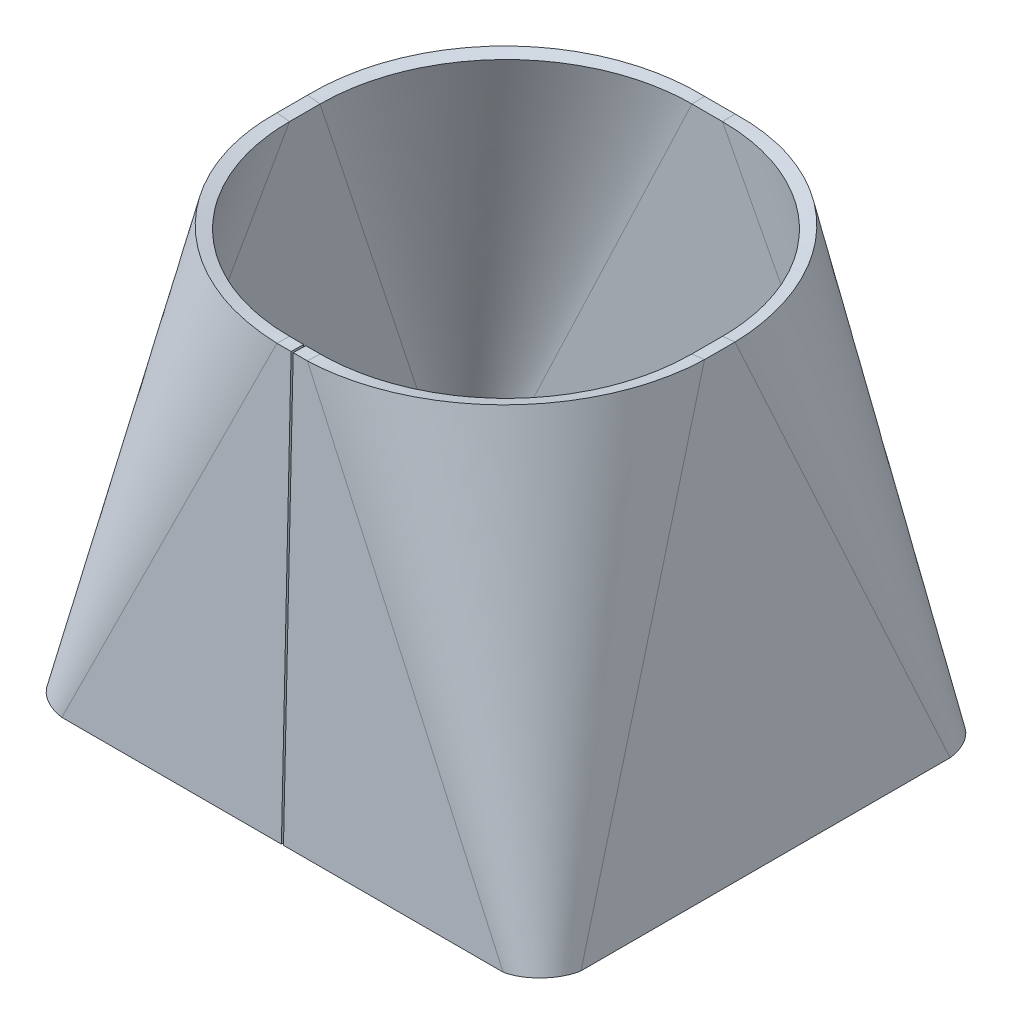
ISO-10303-21;
HEADER;
FILE_DESCRIPTION(('STEP AP214'),'2;1');
FILE_NAME('part.step','',(''),(''),'','','');
FILE_SCHEMA(('AUTOMOTIVE_DESIGN { 1 0 10303 214 1 1 1 1 }'));
ENDSEC;
DATA;
#1=APPLICATION_CONTEXT('core data for automotive mechanical design processes');
#2=APPLICATION_PROTOCOL_DEFINITION('international standard','automotive_design',2000,#1);
#3=PRODUCT_CONTEXT('',#1,'mechanical');
#4=PRODUCT('Part','Part','',(#3));
#5=PRODUCT_RELATED_PRODUCT_CATEGORY('part','',(#4));
#6=PRODUCT_DEFINITION_FORMATION('','',#4);
#7=PRODUCT_DEFINITION_CONTEXT('part definition',#1,'design');
#8=PRODUCT_DEFINITION('design','',#6,#7);
#9=PRODUCT_DEFINITION_SHAPE('','',#8);
#10=(LENGTH_UNIT() NAMED_UNIT(*) SI_UNIT(.MILLI.,.METRE.));
#11=(NAMED_UNIT(*) PLANE_ANGLE_UNIT() SI_UNIT($,.RADIAN.));
#12=(NAMED_UNIT(*) SI_UNIT($,.STERADIAN.) SOLID_ANGLE_UNIT());
#13=UNCERTAINTY_MEASURE_WITH_UNIT(LENGTH_MEASURE(1.E-05),#10,'distance_accuracy_value','');
#14=(GEOMETRIC_REPRESENTATION_CONTEXT(3) GLOBAL_UNCERTAINTY_ASSIGNED_CONTEXT((#13)) GLOBAL_UNIT_ASSIGNED_CONTEXT((#10,
#11,#12)) REPRESENTATION_CONTEXT('',''));
#15=CARTESIAN_POINT('',(0.,0.,0.));
#16=DIRECTION('',(0.,0.,1.));
#17=DIRECTION('',(1.,0.,0.));
#18=AXIS2_PLACEMENT_3D('',#15,#16,#17);
#19=CARTESIAN_POINT('',(79.5,0.,76.));
#20=DIRECTION('',(0.,0.9997349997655,-0.0230202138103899));
#21=DIRECTION('',(-1.,0.,0.));
#22=AXIS2_PLACEMENT_3D('',#19,#20,#21);
#23=PLANE('',#22);
#24=DIRECTION('',(0.,0.0230202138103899,0.9997349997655));
#25=VECTOR('',#24,1.);
#26=CARTESIAN_POINT('',(0.374999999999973,0.,76.));
#27=LINE('',#26,#25);
#28=CARTESIAN_POINT('',(0.374999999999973,0.,76.));
#29=VERTEX_POINT('',#28);
#30=CARTESIAN_POINT('',(0.374999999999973,0.104839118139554,80.5530131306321));
#31=VERTEX_POINT('',#30);
#32=EDGE_CURVE('E14',#29,#31,#27,.T.);
#33=ORIENTED_EDGE('',*,*,#32,.F.);
#34=DIRECTION('',(-1.,0.,0.));
#35=VECTOR('',#34,1.);
#36=CARTESIAN_POINT('',(79.5,0.,76.));
#37=LINE('',#36,#35);
#38=CARTESIAN_POINT('',(79.5,0.,76.));
#39=VERTEX_POINT('',#38);
#40=EDGE_CURVE('E1456',#39,#29,#37,.T.);
#41=ORIENTED_EDGE('',*,*,#40,.F.);
#42=CARTESIAN_POINT('',(79.5000000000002,0.104839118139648,80.553013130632));
#43=CARTESIAN_POINT('',(79.5,0.,76.));
#44=B_SPLINE_CURVE_WITH_KNOTS('',1,(#42,#43),.UNSPECIFIED.,.F.,.F.,(2,2),(0.,1.),.UNSPECIFIED.);
#45=CARTESIAN_POINT('',(79.5,0.104839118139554,80.5530131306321));
#46=VERTEX_POINT('',#45);
#47=EDGE_CURVE('E372',#39,#46,#44,.F.);
#48=ORIENTED_EDGE('',*,*,#47,.T.);
#49=DIRECTION('',(1.,0.,0.));
#50=VECTOR('',#49,1.);
#51=CARTESIAN_POINT('',(0.,0.104839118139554,80.5530131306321));
#52=LINE('',#51,#50);
#53=EDGE_CURVE('E1458',#46,#31,#52,.F.);
#54=ORIENTED_EDGE('',*,*,#53,.T.);
#55=EDGE_LOOP('',(#33,#41,#48,#54));
#56=FACE_BOUND('',#55,.T.);
#57=ADVANCED_FACE('F362',(#56),#23,.F.);
#58=CARTESIAN_POINT('',(79.5000000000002,0.104839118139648,80.553013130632));
#59=CARTESIAN_POINT('',(81.4304616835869,0.405170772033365,80.5460975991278));
#60=CARTESIAN_POINT('',(83.2790889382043,0.645917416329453,80.1167199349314));
#61=CARTESIAN_POINT('',(86.6071607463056,0.976970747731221,78.6429637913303));
#62=CARTESIAN_POINT('',(88.0894804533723,1.07142886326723,77.6029530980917));
#63=CARTESIAN_POINT('',(90.5916680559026,1.13533903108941,75.0781954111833));
#64=CARTESIAN_POINT('',(91.6153775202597,1.10530904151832,73.5898600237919));
#65=CARTESIAN_POINT('',(93.0713084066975,0.906750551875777,70.2654920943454));
#66=CARTESIAN_POINT('',(93.501203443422,0.734857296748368,68.4263877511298));
#67=CARTESIAN_POINT('',(93.5276221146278,0.491485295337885,66.5));
#68=CARTESIAN_POINT('',(79.5,0.,76.));
#69=CARTESIAN_POINT('',(80.8107981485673,0.,75.9999999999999));
#70=CARTESIAN_POINT('',(82.059947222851,0.,75.7339495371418));
#71=CARTESIAN_POINT('',(84.3327465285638,0.,74.7719483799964));
#72=CARTESIAN_POINT('',(85.3563967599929,0.,74.0759976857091));
#73=CARTESIAN_POINT('',(87.0759976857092,0.,72.3563967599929));
#74=CARTESIAN_POINT('',(87.7719483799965,0.,71.3327465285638));
#75=CARTESIAN_POINT('',(88.7339495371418,0.,69.0599472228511));
#76=CARTESIAN_POINT('',(89.,0.,67.8107981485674));
#77=CARTESIAN_POINT('',(89.,0.,66.5));
#78=B_SPLINE_SURFACE_WITH_KNOTS('',1,3,((#58,#59,#60,#61,#62,#63,#64,#65,#66,#67),(#68,#69,#70,
#71,#72,#73,#74,#75,#76,#77)),.UNSPECIFIED.,.F.,.F.,.F.,(2,2),(4,2,2,2,4),(0.,1.),(0.,0.25,0.5,
0.75,1.),.UNSPECIFIED.);
#79=CARTESIAN_POINT('',(79.5,0.,76.));
#80=CARTESIAN_POINT('',(80.8107981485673,0.,75.9999999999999));
#81=CARTESIAN_POINT('',(82.059947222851,0.,75.7339495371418));
#82=CARTESIAN_POINT('',(84.3327465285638,0.,74.7719483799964));
#83=CARTESIAN_POINT('',(85.3563967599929,0.,74.0759976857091));
#84=CARTESIAN_POINT('',(87.0759976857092,0.,72.3563967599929));
#85=CARTESIAN_POINT('',(87.7719483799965,0.,71.3327465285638));
#86=CARTESIAN_POINT('',(88.7339495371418,0.,69.0599472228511));
#87=CARTESIAN_POINT('',(89.,0.,67.8107981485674));
#88=CARTESIAN_POINT('',(89.,0.,66.5));
#89=B_SPLINE_CURVE_WITH_KNOTS('',3,(#79,#80,#81,#82,#83,#84,#85,#86,#87,#88),.UNSPECIFIED.,.F.,
.F.,(4,2,2,2,4),(0.,0.25,0.5,0.75,1.),.UNSPECIFIED.);
#90=CARTESIAN_POINT('',(89.,0.,66.5));
#91=VERTEX_POINT('',#90);
#92=EDGE_CURVE('E1309',#39,#91,#89,.T.);
#93=CARTESIAN_POINT('',(89.,0.,66.5));
#94=CARTESIAN_POINT('',(93.5276221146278,0.491485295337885,66.5));
#95=B_SPLINE_CURVE_WITH_KNOTS('',1,(#93,#94),.UNSPECIFIED.,.F.,.F.,(2,2),(0.,1.),.UNSPECIFIED.);
#96=CARTESIAN_POINT('',(93.5276221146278,0.491485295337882,66.5));
#97=VERTEX_POINT('',#96);
#98=EDGE_CURVE('E1214',#91,#97,#95,.T.);
#99=CARTESIAN_POINT('',(79.4999999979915,0.104839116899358,80.5530131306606));
#100=CARTESIAN_POINT('',(79.7397623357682,0.14214512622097,80.5521659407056));
#101=CARTESIAN_POINT('',(79.9796024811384,0.178796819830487,80.5447964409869));
#102=CARTESIAN_POINT('',(80.4565997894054,0.250250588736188,80.5172010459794));
#103=CARTESIAN_POINT('',(80.6937616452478,0.285066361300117,80.4970916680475));
#104=CARTESIAN_POINT('',(81.1648187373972,0.352687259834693,80.4444201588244));
#105=CARTESIAN_POINT('',(81.3987243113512,0.385507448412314,80.4119697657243));
#106=CARTESIAN_POINT('',(81.8627395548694,0.449027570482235,80.3350704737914));
#107=CARTESIAN_POINT('',(82.0928645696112,0.479743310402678,80.2907271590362));
#108=CARTESIAN_POINT('',(82.5488463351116,0.538978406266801,80.1905109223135));
#109=CARTESIAN_POINT('',(82.774722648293,0.567513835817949,80.1347364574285));
#110=CARTESIAN_POINT('',(83.2217907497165,0.622337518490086,80.0121355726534));
#111=CARTESIAN_POINT('',(83.4430054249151,0.6486417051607,79.9453996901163));
#112=CARTESIAN_POINT('',(83.880386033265,0.698981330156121,79.8013491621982));
#113=CARTESIAN_POINT('',(84.096577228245,0.723032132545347,79.7241165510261));
#114=CARTESIAN_POINT('',(84.5235921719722,0.768877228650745,79.5595312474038));
#115=CARTESIAN_POINT('',(84.7344425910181,0.790685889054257,79.4722517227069));
#116=CARTESIAN_POINT('',(85.1504973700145,0.832071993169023,79.2880119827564));
#117=CARTESIAN_POINT('',(85.3557288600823,0.8516625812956,79.1911159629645));
#118=CARTESIAN_POINT('',(85.7603022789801,0.888632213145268,78.9880615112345));
#119=CARTESIAN_POINT('',(85.9596708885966,0.906023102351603,78.8819583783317));
#120=CARTESIAN_POINT('',(86.3523009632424,0.938626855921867,78.6608805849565));
#121=CARTESIAN_POINT('',(86.5455877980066,0.953850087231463,78.5459524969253));
#122=CARTESIAN_POINT('',(86.925853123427,0.982177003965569,78.3075840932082));
#123=CARTESIAN_POINT('',(87.1128548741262,0.995289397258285,78.1841819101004));
#124=CARTESIAN_POINT('',(87.4803630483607,1.01943957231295,77.9291990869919));
#125=CARTESIAN_POINT('',(87.6608898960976,1.03048444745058,77.7976485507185));
#126=CARTESIAN_POINT('',(88.0152716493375,1.05052064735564,77.5266800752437));
#127=CARTESIAN_POINT('',(88.1891434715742,1.05951751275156,77.3872846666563));
#128=CARTESIAN_POINT('',(88.5300391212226,1.07548460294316,77.10091087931));
#129=CARTESIAN_POINT('',(88.6970757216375,1.08245877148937,76.9539479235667));
#130=CARTESIAN_POINT('',(89.024120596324,1.09440943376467,76.652699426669));
#131=CARTESIAN_POINT('',(89.1841369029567,1.09938826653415,76.4984226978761));
#132=CARTESIAN_POINT('',(89.4969517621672,1.10737809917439,76.1827861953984));
#133=CARTESIAN_POINT('',(89.6497530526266,1.11038985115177,76.0214291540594));
#134=CARTESIAN_POINT('',(89.9479438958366,1.11443289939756,75.691861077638));
#135=CARTESIAN_POINT('',(90.0933303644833,1.11546337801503,75.5236472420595));
#136=CARTESIAN_POINT('',(90.3764821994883,1.11553131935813,75.1805801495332));
#137=CARTESIAN_POINT('',(90.5142381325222,1.11456636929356,75.0057191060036));
#138=CARTESIAN_POINT('',(90.7819009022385,1.11063099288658,74.6495617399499));
#139=CARTESIAN_POINT('',(90.9117914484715,1.10765654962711,74.4682532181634));
#140=CARTESIAN_POINT('',(91.1634737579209,1.09969234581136,74.0993989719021));
#141=CARTESIAN_POINT('',(91.2852418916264,1.09469698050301,73.9118372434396));
#142=CARTESIAN_POINT('',(91.520412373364,1.08265416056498,73.5306776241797));
#143=CARTESIAN_POINT('',(91.6337832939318,1.07559944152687,73.3370605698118));
#144=CARTESIAN_POINT('',(91.8518720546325,1.05938348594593,72.9439974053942));
#145=CARTESIAN_POINT('',(91.9565502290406,1.05021324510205,72.744529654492));
#146=CARTESIAN_POINT('',(92.1569380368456,1.02972946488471,72.3399793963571));
#147=CARTESIAN_POINT('',(92.2525993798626,1.01840526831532,72.1348735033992));
#148=CARTESIAN_POINT('',(92.4346129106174,0.99358253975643,71.7192767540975));
#149=CARTESIAN_POINT('',(92.5209078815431,0.980071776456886,71.5087615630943));
#150=CARTESIAN_POINT('',(92.6838283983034,0.95083136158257,71.0825997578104));
#151=CARTESIAN_POINT('',(92.7603875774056,0.935087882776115,70.866928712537));
#152=CARTESIAN_POINT('',(92.9034557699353,0.901340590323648,70.4307366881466));
#153=CARTESIAN_POINT('',(92.9698891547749,0.883321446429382,70.2101920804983));
#154=CARTESIAN_POINT('',(93.0923053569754,0.84500318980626,69.7645673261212));
#155=CARTESIAN_POINT('',(93.1482033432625,0.824687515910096,69.5394652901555));
#156=CARTESIAN_POINT('',(93.2491354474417,0.781773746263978,69.0850797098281));
#157=CARTESIAN_POINT('',(93.2940757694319,0.759158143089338,68.855776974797));
#158=CARTESIAN_POINT('',(93.3726758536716,0.711655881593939,68.3933888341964));
#159=CARTESIAN_POINT('',(93.4062332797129,0.686751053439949,68.1602878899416));
#160=CARTESIAN_POINT('',(93.4616500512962,0.634703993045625,67.6907497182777));
#161=CARTESIAN_POINT('',(93.4833991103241,0.607543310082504,67.4543015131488));
#162=CARTESIAN_POINT('',(93.5148078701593,0.551059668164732,66.9785640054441));
#163=CARTESIAN_POINT('',(93.5243503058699,0.521718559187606,66.7392691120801));
#164=CARTESIAN_POINT('',(93.5276221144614,0.49148529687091,66.5000000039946));
#165=B_SPLINE_CURVE_WITH_KNOTS('',3,(#99,#100,#101,#102,#103,#104,#105,#106,#107,#108,#109,#110,
#111,#112,#113,#114,#115,#116,#117,#118,#119,#120,#121,#122,#123,#124,#125,#126,#127,#128,#129,
#130,#131,#132,#133,#134,#135,#136,#137,#138,#139,#140,#141,#142,#143,#144,#145,#146,#147,#148,
#149,#150,#151,#152,#153,#154,#155,#156,#157,#158,#159,#160,#161,#162,#163,#164),.UNSPECIFIED.,
.F.,.F.,(4,2,2,2,2,2,2,2,2,2,2,2,2,2,2,2,2,2,2,2,2,2,2,2,2,2,2,2,2,2,2,2,4),(0.,
0.727856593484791,1.44915054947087,2.1640635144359,2.87282840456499,3.57572750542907,
4.27308866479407,4.96528350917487,5.65272312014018,6.33584825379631,7.01512209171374,
7.69102951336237,8.36407289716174,9.03476305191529,9.70361658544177,10.3711571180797,
11.0379128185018,11.7044134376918,12.3711890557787,13.0387713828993,13.707692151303,
14.3784809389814,15.0516651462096,15.7277692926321,16.4073099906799,17.0907923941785,
17.7787091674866,18.4715356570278,19.16972243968,19.8736908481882,20.5838300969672,
21.3004924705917,22.0239891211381),.UNSPECIFIED.);
#166=EDGE_CURVE('E1948',#46,#97,#165,.T.);
#167=ORIENTED_EDGE('',*,*,#47,.F.);
#168=ORIENTED_EDGE('',*,*,#92,.T.);
#169=ORIENTED_EDGE('',*,*,#98,.T.);
#170=ORIENTED_EDGE('',*,*,#166,.F.);
#171=EDGE_LOOP('',(#167,#168,#169,#170));
#172=FACE_BOUND('',#171,.T.);
#173=ADVANCED_FACE('F1220',(#172),#78,.T.);
#174=CARTESIAN_POINT('',(88.9999999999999,0.,-66.5));
#175=DIRECTION('',(-0.107918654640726,0.994159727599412,0.));
#176=DIRECTION('',(0.,0.,1.));
#177=AXIS2_PLACEMENT_3D('',#174,#175,#176);
#178=PLANE('',#177);
#179=ORIENTED_EDGE('',*,*,#98,.F.);
#180=DIRECTION('',(0.,0.,1.));
#181=VECTOR('',#180,1.);
#182=CARTESIAN_POINT('',(88.9999999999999,0.,-66.5));
#183=LINE('',#182,#181);
#184=CARTESIAN_POINT('',(88.9999999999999,0.,-66.5));
#185=VERTEX_POINT('',#184);
#186=EDGE_CURVE('E1123',#185,#91,#183,.T.);
#187=ORIENTED_EDGE('',*,*,#186,.F.);
#188=CARTESIAN_POINT('',(93.5276221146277,0.491485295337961,-66.5000000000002));
#189=CARTESIAN_POINT('',(89.,0.,-66.5));
#190=B_SPLINE_CURVE_WITH_KNOTS('',1,(#188,#189),.UNSPECIFIED.,.F.,.F.,(2,2),(0.,1.),.UNSPECIFIED.);
#191=CARTESIAN_POINT('',(93.5276221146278,0.491485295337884,-66.5));
#192=VERTEX_POINT('',#191);
#193=EDGE_CURVE('E1191',#185,#192,#190,.F.);
#194=ORIENTED_EDGE('',*,*,#193,.T.);
#195=DIRECTION('',(0.,0.,1.));
#196=VECTOR('',#195,1.);
#197=CARTESIAN_POINT('',(93.5276221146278,0.491485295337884,0.));
#198=LINE('',#197,#196);
#199=EDGE_CURVE('E1105',#192,#97,#198,.T.);
#200=ORIENTED_EDGE('',*,*,#199,.T.);
#201=EDGE_LOOP('',(#179,#187,#194,#200));
#202=FACE_BOUND('',#201,.T.);
#203=ADVANCED_FACE('F1152',(#202),#178,.F.);
#204=CARTESIAN_POINT('',(93.5276221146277,0.491485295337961,-66.5000000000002));
#205=CARTESIAN_POINT('',(93.5012034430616,0.734857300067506,-68.4263877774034));
#206=CARTESIAN_POINT('',(93.0713085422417,0.906749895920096,-70.2654921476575));
#207=CARTESIAN_POINT('',(91.615377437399,1.10530944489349,-73.5898599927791));
#208=CARTESIAN_POINT('',(90.5916678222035,1.13534035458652,-75.0781951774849));
#209=CARTESIAN_POINT('',(88.0894806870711,1.0714275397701,-77.60295333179));
#210=CARTESIAN_POINT('',(86.6071607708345,0.976970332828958,-78.6429638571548));
#211=CARTESIAN_POINT('',(83.2790888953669,0.645918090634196,-80.1167198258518));
#212=CARTESIAN_POINT('',(81.4304616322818,0.405170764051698,-80.5460975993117));
#213=CARTESIAN_POINT('',(79.5,0.104839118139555,-80.553013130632));
#214=CARTESIAN_POINT('',(89.,0.,-66.5));
#215=CARTESIAN_POINT('',(88.9999999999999,0.,-67.8107981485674));
#216=CARTESIAN_POINT('',(88.7339495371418,0.,-69.0599472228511));
#217=CARTESIAN_POINT('',(87.7719483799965,0.,-71.3327465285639));
#218=CARTESIAN_POINT('',(87.0759976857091,0.,-72.3563967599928));
#219=CARTESIAN_POINT('',(85.3563967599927,0.,-74.0759976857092));
#220=CARTESIAN_POINT('',(84.3327465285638,0.,-74.7719483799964));
#221=CARTESIAN_POINT('',(82.059947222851,0.,-75.7339495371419));
#222=CARTESIAN_POINT('',(80.8107981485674,0.,-76.));
#223=CARTESIAN_POINT('',(79.5,0.,-76.));
#224=B_SPLINE_SURFACE_WITH_KNOTS('',1,3,((#204,#205,#206,#207,#208,#209,#210,#211,#212,#213),
(#214,#215,#216,#217,#218,#219,#220,#221,#222,#223)),.UNSPECIFIED.,.F.,.F.,.F.,(2,2),(4,2,2,2,
4),(0.,1.),(0.,0.25,0.5,0.75,1.),.UNSPECIFIED.);
#225=CARTESIAN_POINT('',(89.,0.,-66.5));
#226=CARTESIAN_POINT('',(88.9999999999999,0.,-67.8107981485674));
#227=CARTESIAN_POINT('',(88.7339495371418,0.,-69.0599472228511));
#228=CARTESIAN_POINT('',(87.7719483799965,0.,-71.3327465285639));
#229=CARTESIAN_POINT('',(87.0759976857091,0.,-72.3563967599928));
#230=CARTESIAN_POINT('',(85.3563967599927,0.,-74.0759976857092));
#231=CARTESIAN_POINT('',(84.3327465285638,0.,-74.7719483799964));
#232=CARTESIAN_POINT('',(82.059947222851,0.,-75.7339495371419));
#233=CARTESIAN_POINT('',(80.8107981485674,0.,-76.));
#234=CARTESIAN_POINT('',(79.5,0.,-76.));
#235=B_SPLINE_CURVE_WITH_KNOTS('',3,(#225,#226,#227,#228,#229,#230,#231,#232,#233,#234),
.UNSPECIFIED.,.F.,.F.,(4,2,2,2,4),(0.,0.25,0.5,0.75,1.),.UNSPECIFIED.);
#236=CARTESIAN_POINT('',(79.5,0.,-76.));
#237=VERTEX_POINT('',#236);
#238=EDGE_CURVE('E1118',#185,#237,#235,.T.);
#239=CARTESIAN_POINT('',(79.5,0.,-76.));
#240=CARTESIAN_POINT('',(79.5,0.104839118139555,-80.553013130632));
#241=B_SPLINE_CURVE_WITH_KNOTS('',1,(#239,#240),.UNSPECIFIED.,.F.,.F.,(2,2),(0.,1.),.UNSPECIFIED.);
#242=CARTESIAN_POINT('',(79.5,0.104839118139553,-80.553013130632));
#243=VERTEX_POINT('',#242);
#244=EDGE_CURVE('E1180',#237,#243,#241,.T.);
#245=CARTESIAN_POINT('',(93.5276221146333,0.491485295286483,-66.5));
#246=CARTESIAN_POINT('',(93.5243503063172,0.521718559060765,-66.7392691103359));
#247=CARTESIAN_POINT('',(93.5148078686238,0.551059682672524,-66.9785640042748));
#248=CARTESIAN_POINT('',(93.4833991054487,0.607543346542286,-67.4543015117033));
#249=CARTESIAN_POINT('',(93.4616500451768,0.634704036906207,-67.6907497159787));
#250=CARTESIAN_POINT('',(93.4062332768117,0.686751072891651,-68.1602878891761));
#251=CARTESIAN_POINT('',(93.3726758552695,0.711655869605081,-68.3933888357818));
#252=CARTESIAN_POINT('',(93.2940757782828,0.759158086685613,-68.8557769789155));
#253=CARTESIAN_POINT('',(93.2491354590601,0.781773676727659,-69.0850797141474));
#254=CARTESIAN_POINT('',(93.1482033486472,0.824687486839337,-69.5394652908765));
#255=CARTESIAN_POINT('',(93.0923053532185,0.845003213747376,-69.7645673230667));
#256=CARTESIAN_POINT('',(92.9698891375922,0.883321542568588,-70.2101920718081));
#257=CARTESIAN_POINT('',(92.9034557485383,0.901340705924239,-70.4307366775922));
#258=CARTESIAN_POINT('',(92.7603875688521,0.935087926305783,-70.8669287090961));
#259=CARTESIAN_POINT('',(92.6838284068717,0.9508313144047,-71.0825997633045));
#260=CARTESIAN_POINT('',(92.5209079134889,0.980071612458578,-71.5087615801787));
#261=CARTESIAN_POINT('',(92.4346129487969,0.99358234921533,-71.7192767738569));
#262=CARTESIAN_POINT('',(92.2525993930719,1.01840520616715,-72.1348735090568));
#263=CARTESIAN_POINT('',(92.1569380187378,1.02972955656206,-72.339979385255));
#264=CARTESIAN_POINT('',(91.9565501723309,1.05021352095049,-72.7445296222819));
#265=CARTESIAN_POINT('',(91.8518719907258,1.05938379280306,-72.9439973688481));
#266=CARTESIAN_POINT('',(91.6337832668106,1.07559956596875,-73.337060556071));
#267=CARTESIAN_POINT('',(91.5204123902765,1.08265407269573,-73.5306776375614));
#268=CARTESIAN_POINT('',(91.2852419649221,1.09469662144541,-73.9118372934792));
#269=CARTESIAN_POINT('',(91.1634738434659,1.09969192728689,-74.0993990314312));
#270=CARTESIAN_POINT('',(90.9117915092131,1.10765625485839,-74.4682532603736));
#271=CARTESIAN_POINT('',(90.7819009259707,1.11063088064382,-74.6495617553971));
#272=CARTESIAN_POINT('',(90.5142380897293,1.11456658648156,-75.0057190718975));
#273=CARTESIAN_POINT('',(90.3764821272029,1.11553168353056,-75.1805800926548));
#274=CARTESIAN_POINT('',(90.0933302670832,1.11546388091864,-75.523647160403));
#275=CARTESIAN_POINT('',(89.9479438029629,1.11443339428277,-75.691860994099));
#276=CARTESIAN_POINT('',(89.6497529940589,1.11039017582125,-76.0214290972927));
#277=CARTESIAN_POINT('',(89.4969517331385,1.10737826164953,-76.1827861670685));
#278=CARTESIAN_POINT('',(89.1841369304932,1.09938810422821,-76.4984227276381));
#279=CARTESIAN_POINT('',(89.0241206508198,1.09440910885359,-76.6526994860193));
#280=CARTESIAN_POINT('',(88.697075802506,1.08245827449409,-76.9539480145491));
#281=CARTESIAN_POINT('',(88.5300392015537,1.07548409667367,-77.1009109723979));
#282=CARTESIAN_POINT('',(88.1891435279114,1.05951714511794,-77.3872847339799));
#283=CARTESIAN_POINT('',(88.0152716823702,1.05052042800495,-77.5266801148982));
#284=CARTESIAN_POINT('',(87.6608898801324,1.0304845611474,-77.7976485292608));
#285=CARTESIAN_POINT('',(87.4803630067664,1.01943987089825,-77.9291990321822));
#286=CARTESIAN_POINT('',(87.1128548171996,0.99528982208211,-78.1841818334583));
#287=CARTESIAN_POINT('',(86.9258530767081,0.982177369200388,-78.3075840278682));
#288=CARTESIAN_POINT('',(86.5455877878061,0.953850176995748,-78.5459524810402));
#289=CARTESIAN_POINT('',(86.3523009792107,0.938626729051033,-78.6608806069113));
#290=CARTESIAN_POINT('',(85.9596709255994,0.906022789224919,-78.8819584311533));
#291=CARTESIAN_POINT('',(85.7603023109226,0.888631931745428,-78.9880615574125));
#292=CARTESIAN_POINT('',(85.3557288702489,0.851662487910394,-79.1911159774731));
#293=CARTESIAN_POINT('',(85.1504973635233,0.832072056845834,-79.2880119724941));
#294=CARTESIAN_POINT('',(84.734442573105,0.790686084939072,-79.472251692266));
#295=CARTESIAN_POINT('',(84.5235921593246,0.768877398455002,-79.5595312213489));
#296=CARTESIAN_POINT('',(84.0965772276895,0.723032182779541,-79.7241165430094));
#297=CARTESIAN_POINT('',(83.8803860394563,0.698981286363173,-79.801349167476));
#298=CARTESIAN_POINT('',(83.4430054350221,0.648641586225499,-79.9453997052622));
#299=CARTESIAN_POINT('',(83.2217907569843,0.622337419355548,-80.0121355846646));
#300=CARTESIAN_POINT('',(82.7747226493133,0.567513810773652,-80.1347364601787));
#301=CARTESIAN_POINT('',(82.5488463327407,0.538978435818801,-80.19051091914));
#302=CARTESIAN_POINT('',(82.0928645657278,0.479743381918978,-80.2907271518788));
#303=CARTESIAN_POINT('',(81.8627395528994,0.449027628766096,-80.3350704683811));
#304=CARTESIAN_POINT('',(81.3987243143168,0.385507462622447,-80.4119697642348));
#305=CARTESIAN_POINT('',(81.1648187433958,0.352687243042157,-80.4444201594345));
#306=CARTESIAN_POINT('',(80.6937616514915,0.28506631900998,-80.4970916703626));
#307=CARTESIAN_POINT('',(80.4565997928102,0.25025055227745,-80.5172010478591));
#308=CARTESIAN_POINT('',(79.9796024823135,0.178796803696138,-80.544796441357));
#309=CARTESIAN_POINT('',(79.7397623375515,0.14214512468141,-80.5521659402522));
#310=CARTESIAN_POINT('',(79.5000000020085,0.104839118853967,-80.5530131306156));
#311=B_SPLINE_CURVE_WITH_KNOTS('',3,(#245,#246,#247,#248,#249,#250,#251,#252,#253,#254,#255,
#256,#257,#258,#259,#260,#261,#262,#263,#264,#265,#266,#267,#268,#269,#270,#271,#272,#273,#274,
#275,#276,#277,#278,#279,#280,#281,#282,#283,#284,#285,#286,#287,#288,#289,#290,#291,#292,#293,
#294,#295,#296,#297,#298,#299,#300,#301,#302,#303,#304,#305,#306,#307,#308,#309,#310),
.UNSPECIFIED.,.F.,.F.,(4,2,2,2,2,2,2,2,2,2,2,2,2,2,2,2,2,2,2,2,2,2,2,2,2,2,2,2,2,2,2,2,4),(0.,
0.723496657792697,1.44015903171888,2.15029827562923,2.85426667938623,3.55245347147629,
4.24527996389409,4.93319672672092,5.61667912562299,6.29621984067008,6.9723239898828,
7.64550818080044,8.31629696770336,8.98521774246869,9.65280007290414,10.3195756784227,
10.9860763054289,11.652832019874,12.3203725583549,12.9892260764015,13.6599162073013,
14.3329595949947,15.0088670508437,15.6881408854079,16.3712659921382,17.0587056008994,
17.75090046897,18.4482616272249,19.1511607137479,19.8599256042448,20.5748385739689,
21.2961325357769,22.0239891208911),.UNSPECIFIED.);
#312=EDGE_CURVE('E1103',#192,#243,#311,.T.);
#313=ORIENTED_EDGE('',*,*,#193,.F.);
#314=ORIENTED_EDGE('',*,*,#238,.T.);
#315=ORIENTED_EDGE('',*,*,#244,.T.);
#316=ORIENTED_EDGE('',*,*,#312,.F.);
#317=EDGE_LOOP('',(#313,#314,#315,#316));
#318=FACE_BOUND('',#317,.T.);
#319=ADVANCED_FACE('F1141',(#318),#224,.T.);
#320=CARTESIAN_POINT('',(79.5,0.,-76.));
#321=DIRECTION('',(0.,0.9997349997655,0.02302021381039));
#322=DIRECTION('',(1.,0.,0.));
#323=AXIS2_PLACEMENT_3D('',#320,#321,#322);
#324=PLANE('',#323);
#325=ORIENTED_EDGE('',*,*,#244,.F.);
#326=DIRECTION('',(1.,0.,0.));
#327=VECTOR('',#326,1.);
#328=CARTESIAN_POINT('',(79.5,0.,-76.));
#329=LINE('',#328,#327);
#330=CARTESIAN_POINT('',(-79.5,0.,-76.));
#331=VERTEX_POINT('',#330);
#332=EDGE_CURVE('E1365',#331,#237,#329,.T.);
#333=ORIENTED_EDGE('',*,*,#332,.F.);
#334=CARTESIAN_POINT('',(-79.5000000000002,0.104839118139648,-80.553013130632));
#335=CARTESIAN_POINT('',(-79.5,0.,-76.));
#336=B_SPLINE_CURVE_WITH_KNOTS('',1,(#334,#335),.UNSPECIFIED.,.F.,.F.,(2,2),(0.,1.),.UNSPECIFIED.);
#337=CARTESIAN_POINT('',(-79.5,0.104839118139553,-80.553013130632));
#338=VERTEX_POINT('',#337);
#339=EDGE_CURVE('E1866',#331,#338,#336,.F.);
#340=ORIENTED_EDGE('',*,*,#339,.T.);
#341=DIRECTION('',(1.,0.,0.));
#342=VECTOR('',#341,1.);
#343=CARTESIAN_POINT('',(0.,0.104839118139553,-80.553013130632));
#344=LINE('',#343,#342);
#345=EDGE_CURVE('E1332',#338,#243,#344,.T.);
#346=ORIENTED_EDGE('',*,*,#345,.T.);
#347=EDGE_LOOP('',(#325,#333,#340,#346));
#348=FACE_BOUND('',#347,.T.);
#349=ADVANCED_FACE('F1063',(#348),#324,.F.);
#350=CARTESIAN_POINT('',(-79.5000000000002,0.104839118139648,-80.553013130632));
#351=CARTESIAN_POINT('',(-81.4304616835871,0.405170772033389,-80.5460975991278));
#352=CARTESIAN_POINT('',(-83.2790889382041,0.645917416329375,-80.1167199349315));
#353=CARTESIAN_POINT('',(-86.6071607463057,0.976970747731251,-78.6429637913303));
#354=CARTESIAN_POINT('',(-88.0894804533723,1.07142886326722,-77.6029530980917));
#355=CARTESIAN_POINT('',(-90.5916680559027,1.13533903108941,-75.0781954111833));
#356=CARTESIAN_POINT('',(-91.6153775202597,1.10530904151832,-73.5898600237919));
#357=CARTESIAN_POINT('',(-93.0713084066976,0.906750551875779,-70.2654920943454));
#358=CARTESIAN_POINT('',(-93.5012034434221,0.734857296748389,-68.4263877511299));
#359=CARTESIAN_POINT('',(-93.5276221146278,0.491485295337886,-66.5));
#360=CARTESIAN_POINT('',(-79.5,0.,-76.));
#361=CARTESIAN_POINT('',(-80.8107981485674,0.,-75.9999999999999));
#362=CARTESIAN_POINT('',(-82.0599472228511,0.,-75.7339495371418));
#363=CARTESIAN_POINT('',(-84.3327465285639,0.,-74.7719483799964));
#364=CARTESIAN_POINT('',(-85.356396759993,0.,-74.0759976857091));
#365=CARTESIAN_POINT('',(-87.0759976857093,0.,-72.3563967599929));
#366=CARTESIAN_POINT('',(-87.7719483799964,0.,-71.3327465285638));
#367=CARTESIAN_POINT('',(-88.7339495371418,0.,-69.0599472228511));
#368=CARTESIAN_POINT('',(-89.,0.,-67.8107981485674));
#369=CARTESIAN_POINT('',(-89.,0.,-66.5));
#370=B_SPLINE_SURFACE_WITH_KNOTS('',1,3,((#350,#351,#352,#353,#354,#355,#356,#357,#358,#359),
(#360,#361,#362,#363,#364,#365,#366,#367,#368,#369)),.UNSPECIFIED.,.F.,.F.,.F.,(2,2),(4,2,2,2,
4),(0.,1.),(0.,0.25,0.5,0.75,1.),.UNSPECIFIED.);
#371=CARTESIAN_POINT('',(-79.5,0.,-76.));
#372=CARTESIAN_POINT('',(-80.8107981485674,0.,-75.9999999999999));
#373=CARTESIAN_POINT('',(-82.0599472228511,0.,-75.7339495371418));
#374=CARTESIAN_POINT('',(-84.3327465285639,0.,-74.7719483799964));
#375=CARTESIAN_POINT('',(-85.356396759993,0.,-74.0759976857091));
#376=CARTESIAN_POINT('',(-87.0759976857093,0.,-72.3563967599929));
#377=CARTESIAN_POINT('',(-87.7719483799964,0.,-71.3327465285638));
#378=CARTESIAN_POINT('',(-88.7339495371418,0.,-69.0599472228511));
#379=CARTESIAN_POINT('',(-89.,0.,-67.8107981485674));
#380=CARTESIAN_POINT('',(-89.,0.,-66.5));
#381=B_SPLINE_CURVE_WITH_KNOTS('',3,(#371,#372,#373,#374,#375,#376,#377,#378,#379,#380),
.UNSPECIFIED.,.F.,.F.,(4,2,2,2,4),(0.,0.25,0.5,0.75,1.),.UNSPECIFIED.);
#382=CARTESIAN_POINT('',(-89.,0.,-66.5));
#383=VERTEX_POINT('',#382);
#384=EDGE_CURVE('E693',#331,#383,#381,.T.);
#385=CARTESIAN_POINT('',(-89.,0.,-66.5));
#386=CARTESIAN_POINT('',(-93.5276221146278,0.491485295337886,-66.5));
#387=B_SPLINE_CURVE_WITH_KNOTS('',1,(#385,#386),.UNSPECIFIED.,.F.,.F.,(2,2),(0.,1.),.UNSPECIFIED.);
#388=CARTESIAN_POINT('',(-93.5276221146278,0.491485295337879,-66.5));
#389=VERTEX_POINT('',#388);
#390=EDGE_CURVE('E1046',#383,#389,#387,.T.);
#391=CARTESIAN_POINT('',(-79.4999999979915,0.104839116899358,-80.5530131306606));
#392=CARTESIAN_POINT('',(-79.7397623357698,0.142145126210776,-80.5521659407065));
#393=CARTESIAN_POINT('',(-79.9796024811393,0.178796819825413,-80.5447964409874));
#394=CARTESIAN_POINT('',(-80.4565997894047,0.250250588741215,-80.517201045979));
#395=CARTESIAN_POINT('',(-80.6937616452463,0.285066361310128,-80.4970916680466));
#396=CARTESIAN_POINT('',(-81.1648187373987,0.352687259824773,-80.4444201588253));
#397=CARTESIAN_POINT('',(-81.3987243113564,0.385507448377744,-80.4119697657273));
#398=CARTESIAN_POINT('',(-81.8627395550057,0.449027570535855,-80.335070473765));
#399=CARTESIAN_POINT('',(-82.0928645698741,0.479743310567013,-80.2907271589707));
#400=CARTESIAN_POINT('',(-82.5488463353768,0.538978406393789,-80.1905109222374));
#401=CARTESIAN_POINT('',(-82.7747226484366,0.567513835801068,-80.1347364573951));
#402=CARTESIAN_POINT('',(-83.2217907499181,0.622337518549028,-80.0121355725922));
#403=CARTESIAN_POINT('',(-83.4430054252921,0.648641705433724,-79.9453996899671));
#404=CARTESIAN_POINT('',(-83.8803860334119,0.698981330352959,-79.8013491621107));
#405=CARTESIAN_POINT('',(-84.0965772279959,0.723032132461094,-79.7241165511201));
#406=CARTESIAN_POINT('',(-84.5235921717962,0.768877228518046,-79.5595312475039));
#407=CARTESIAN_POINT('',(-84.7344425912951,0.790685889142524,-79.4722517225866));
#408=CARTESIAN_POINT('',(-85.1504973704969,0.832071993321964,-79.2880119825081));
#409=CARTESIAN_POINT('',(-85.3557288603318,0.851662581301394,-79.191115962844));
#410=CARTESIAN_POINT('',(-85.7603022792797,0.888632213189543,-78.9880615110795));
#411=CARTESIAN_POINT('',(-85.9596708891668,0.906023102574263,-78.8819583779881));
#412=CARTESIAN_POINT('',(-86.3523009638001,0.938626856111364,-78.6608805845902));
#413=CARTESIAN_POINT('',(-86.5455877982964,0.953850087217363,-78.545952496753));
#414=CARTESIAN_POINT('',(-86.9258531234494,0.982177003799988,-78.3075840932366));
#415=CARTESIAN_POINT('',(-87.1128548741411,0.99528939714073,-78.1841819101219));
#416=CARTESIAN_POINT('',(-87.4803630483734,1.01943957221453,-77.929199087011));
#417=CARTESIAN_POINT('',(-87.6608898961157,1.03048444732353,-77.7976485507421));
#418=CARTESIAN_POINT('',(-88.0152716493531,1.05052064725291,-77.5266800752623));
#419=CARTESIAN_POINT('',(-88.1891434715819,1.05951751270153,-77.3872846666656));
#420=CARTESIAN_POINT('',(-88.5300391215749,1.07548460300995,-77.1009108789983));
#421=CARTESIAN_POINT('',(-88.6970757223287,1.08245877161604,-76.9539479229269));
#422=CARTESIAN_POINT('',(-89.0241205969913,1.09440943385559,-76.6526994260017));
#423=CARTESIAN_POINT('',(-89.1841369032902,1.09938826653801,-76.4984226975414));
#424=CARTESIAN_POINT('',(-89.4969517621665,1.10737809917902,-76.1827861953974));
#425=CARTESIAN_POINT('',(-89.6497530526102,1.11038985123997,-76.0214291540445));
#426=CARTESIAN_POINT('',(-89.947943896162,1.11443289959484,-75.6918610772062));
#427=CARTESIAN_POINT('',(-90.0933303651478,1.11546337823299,-75.5236472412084));
#428=CARTESIAN_POINT('',(-90.3764822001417,1.11553131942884,-75.180580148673));
#429=CARTESIAN_POINT('',(-90.5142381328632,1.1145663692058,-75.0057191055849));
#430=CARTESIAN_POINT('',(-90.7819009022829,1.11063099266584,-74.6495617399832));
#431=CARTESIAN_POINT('',(-90.9117914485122,1.10765654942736,-74.4682532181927));
#432=CARTESIAN_POINT('',(-91.1634737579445,1.09969234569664,-74.0993989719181));
#433=CARTESIAN_POINT('',(-91.2852418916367,1.09469698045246,-73.9118372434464));
#434=CARTESIAN_POINT('',(-91.5204123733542,1.08265416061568,-73.5306776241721));
#435=CARTESIAN_POINT('',(-91.6337832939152,1.07559944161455,-73.3370605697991));
#436=CARTESIAN_POINT('',(-91.8518720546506,1.05938348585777,-72.9439974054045));
#437=CARTESIAN_POINT('',(-91.9565502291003,1.05021324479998,-72.7445296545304));
#438=CARTESIAN_POINT('',(-92.1569380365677,1.02972946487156,-72.3399793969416));
#439=CARTESIAN_POINT('',(-92.2525993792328,1.01840526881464,-72.1348735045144));
#440=CARTESIAN_POINT('',(-92.4346129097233,0.993582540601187,-71.7192767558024));
#441=CARTESIAN_POINT('',(-92.5209078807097,0.980071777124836,-71.508761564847));
#442=CARTESIAN_POINT('',(-92.6838283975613,0.950831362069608,-71.0825997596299));
#443=CARTESIAN_POINT('',(-92.7603875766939,0.935087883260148,-70.8669287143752));
#444=CARTESIAN_POINT('',(-92.9034557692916,0.901340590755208,-70.4307366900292));
#445=CARTESIAN_POINT('',(-92.9698891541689,0.883321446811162,-70.2101920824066));
#446=CARTESIAN_POINT('',(-93.0923053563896,0.845003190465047,-69.7645673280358));
#447=CARTESIAN_POINT('',(-93.1482033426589,0.82468751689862,-69.5394652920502));
#448=CARTESIAN_POINT('',(-93.2491354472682,0.781773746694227,-69.0850797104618));
#449=CARTESIAN_POINT('',(-93.2940757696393,0.75915814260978,-68.8557769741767));
#450=CARTESIAN_POINT('',(-93.3726758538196,0.711655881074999,-68.3933888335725));
#451=CARTESIAN_POINT('',(-93.4062332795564,0.68675105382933,-68.1602878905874));
#452=CARTESIAN_POINT('',(-93.4616500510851,0.634703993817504,-67.6907497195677));
#453=CARTESIAN_POINT('',(-93.4833991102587,0.607543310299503,-67.4543015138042));
#454=CARTESIAN_POINT('',(-93.5148078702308,0.551059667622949,-66.9785640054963));
#455=CARTESIAN_POINT('',(-93.5243503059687,0.521718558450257,-66.7392691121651));
#456=CARTESIAN_POINT('',(-93.5276221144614,0.49148529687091,-66.5000000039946));
#457=B_SPLINE_CURVE_WITH_KNOTS('',3,(#391,#392,#393,#394,#395,#396,#397,#398,#399,#400,#401,
#402,#403,#404,#405,#406,#407,#408,#409,#410,#411,#412,#413,#414,#415,#416,#417,#418,#419,#420,
#421,#422,#423,#424,#425,#426,#427,#428,#429,#430,#431,#432,#433,#434,#435,#436,#437,#438,#439,
#440,#441,#442,#443,#444,#445,#446,#447,#448,#449,#450,#451,#452,#453,#454,#455,#456),
.UNSPECIFIED.,.F.,.F.,(4,2,2,2,2,2,2,2,2,2,2,2,2,2,2,2,2,2,2,2,2,2,2,2,2,2,2,2,2,2,2,2,4),(0.,
0.727856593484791,1.44915054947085,2.1640635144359,2.87282840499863,3.57572750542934,
4.27308866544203,4.96528350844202,5.65272312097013,6.33584825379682,7.01512209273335,
7.69102951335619,8.36407289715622,9.03476305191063,9.70361658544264,10.3711571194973,
11.0379128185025,11.7044134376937,12.3711890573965,13.0387713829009,13.7076921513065,
14.3784809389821,15.0516651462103,15.7277692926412,16.4073099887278,17.0907923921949,
17.7787091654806,18.4715356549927,19.1697224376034,19.8736908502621,20.5838300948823,
21.3004924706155,22.0239891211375),.UNSPECIFIED.);
#458=EDGE_CURVE('E1855',#338,#389,#457,.T.);
#459=ORIENTED_EDGE('',*,*,#339,.F.);
#460=ORIENTED_EDGE('',*,*,#384,.T.);
#461=ORIENTED_EDGE('',*,*,#390,.T.);
#462=ORIENTED_EDGE('',*,*,#458,.F.);
#463=EDGE_LOOP('',(#459,#460,#461,#462));
#464=FACE_BOUND('',#463,.T.);
#465=ADVANCED_FACE('F1052',(#464),#370,.T.);
#466=CARTESIAN_POINT('',(-89.,0.,-66.5));
#467=DIRECTION('',(0.107918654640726,0.994159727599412,0.));
#468=DIRECTION('',(0.,0.,-1.));
#469=AXIS2_PLACEMENT_3D('',#466,#467,#468);
#470=PLANE('',#469);
#471=ORIENTED_EDGE('',*,*,#390,.F.);
#472=DIRECTION('',(0.,0.,-1.));
#473=VECTOR('',#472,1.);
#474=CARTESIAN_POINT('',(-89.,0.,-66.5));
#475=LINE('',#474,#473);
#476=CARTESIAN_POINT('',(-89.,0.,66.5));
#477=VERTEX_POINT('',#476);
#478=EDGE_CURVE('E700',#477,#383,#475,.T.);
#479=ORIENTED_EDGE('',*,*,#478,.F.);
#480=CARTESIAN_POINT('',(-93.5276221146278,0.491485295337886,66.5));
#481=CARTESIAN_POINT('',(-89.,0.,66.5));
#482=B_SPLINE_CURVE_WITH_KNOTS('',1,(#480,#481),.UNSPECIFIED.,.F.,.F.,(2,2),(0.,1.),.UNSPECIFIED.);
#483=CARTESIAN_POINT('',(-93.5276221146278,0.491485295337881,66.5));
#484=VERTEX_POINT('',#483);
#485=EDGE_CURVE('E1024',#477,#484,#482,.F.);
#486=ORIENTED_EDGE('',*,*,#485,.T.);
#487=DIRECTION('',(0.,0.,1.));
#488=VECTOR('',#487,1.);
#489=CARTESIAN_POINT('',(-93.5276221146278,0.491485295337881,0.));
#490=LINE('',#489,#488);
#491=EDGE_CURVE('E934',#484,#389,#490,.F.);
#492=ORIENTED_EDGE('',*,*,#491,.T.);
#493=EDGE_LOOP('',(#471,#479,#486,#492));
#494=FACE_BOUND('',#493,.T.);
#495=ADVANCED_FACE('F984',(#494),#470,.F.);
#496=CARTESIAN_POINT('',(-93.5276221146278,0.491485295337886,66.5));
#497=CARTESIAN_POINT('',(-93.5012034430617,0.734857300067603,68.4263877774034));
#498=CARTESIAN_POINT('',(-93.0713085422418,0.906749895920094,70.2654921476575));
#499=CARTESIAN_POINT('',(-91.615377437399,1.10530944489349,73.5898599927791));
#500=CARTESIAN_POINT('',(-90.5916678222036,1.13534035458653,75.0781951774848));
#501=CARTESIAN_POINT('',(-88.0894806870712,1.0714275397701,77.6029533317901));
#502=CARTESIAN_POINT('',(-86.6071607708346,0.976970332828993,78.6429638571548));
#503=CARTESIAN_POINT('',(-83.2790888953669,0.645918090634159,80.1167198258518));
#504=CARTESIAN_POINT('',(-81.4304616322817,0.405170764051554,80.5460975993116));
#505=CARTESIAN_POINT('',(-79.5000000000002,0.104839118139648,80.553013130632));
#506=CARTESIAN_POINT('',(-89.,0.,66.5));
#507=CARTESIAN_POINT('',(-89.,0.,67.8107981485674));
#508=CARTESIAN_POINT('',(-88.7339495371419,0.,69.0599472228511));
#509=CARTESIAN_POINT('',(-87.7719483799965,0.,71.3327465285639));
#510=CARTESIAN_POINT('',(-87.0759976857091,0.,72.3563967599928));
#511=CARTESIAN_POINT('',(-85.3563967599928,0.,74.0759976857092));
#512=CARTESIAN_POINT('',(-84.3327465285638,0.,74.7719483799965));
#513=CARTESIAN_POINT('',(-82.0599472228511,0.,75.7339495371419));
#514=CARTESIAN_POINT('',(-80.8107981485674,0.,75.9999999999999));
#515=CARTESIAN_POINT('',(-79.5,0.,76.));
#516=B_SPLINE_SURFACE_WITH_KNOTS('',1,3,((#496,#497,#498,#499,#500,#501,#502,#503,#504,#505),
(#506,#507,#508,#509,#510,#511,#512,#513,#514,#515)),.UNSPECIFIED.,.F.,.F.,.F.,(2,2),(4,2,2,2,
4),(0.,1.),(0.,0.25,0.5,0.75,1.),.UNSPECIFIED.);
#517=CARTESIAN_POINT('',(-89.,0.,66.5));
#518=CARTESIAN_POINT('',(-89.,0.,67.8107981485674));
#519=CARTESIAN_POINT('',(-88.7339495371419,0.,69.0599472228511));
#520=CARTESIAN_POINT('',(-87.7719483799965,0.,71.3327465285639));
#521=CARTESIAN_POINT('',(-87.0759976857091,0.,72.3563967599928));
#522=CARTESIAN_POINT('',(-85.3563967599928,0.,74.0759976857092));
#523=CARTESIAN_POINT('',(-84.3327465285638,0.,74.7719483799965));
#524=CARTESIAN_POINT('',(-82.0599472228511,0.,75.7339495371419));
#525=CARTESIAN_POINT('',(-80.8107981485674,0.,75.9999999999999));
#526=CARTESIAN_POINT('',(-79.5,0.,76.));
#527=B_SPLINE_CURVE_WITH_KNOTS('',3,(#517,#518,#519,#520,#521,#522,#523,#524,#525,#526),
.UNSPECIFIED.,.F.,.F.,(4,2,2,2,4),(0.,0.25,0.5,0.75,1.),.UNSPECIFIED.);
#528=CARTESIAN_POINT('',(-79.5,0.,76.));
#529=VERTEX_POINT('',#528);
#530=EDGE_CURVE('E504',#477,#529,#527,.T.);
#531=CARTESIAN_POINT('',(-79.5,0.,76.));
#532=CARTESIAN_POINT('',(-79.5000000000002,0.104839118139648,80.553013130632));
#533=B_SPLINE_CURVE_WITH_KNOTS('',1,(#531,#532),.UNSPECIFIED.,.F.,.F.,(2,2),(0.,1.),.UNSPECIFIED.);
#534=CARTESIAN_POINT('',(-79.5,0.10483911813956,80.5530131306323));
#535=VERTEX_POINT('',#534);
#536=EDGE_CURVE('E1014',#529,#535,#533,.T.);
#537=CARTESIAN_POINT('',(-93.5276221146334,0.491485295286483,66.5));
#538=CARTESIAN_POINT('',(-93.5243503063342,0.521718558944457,66.7392691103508));
#539=CARTESIAN_POINT('',(-93.5148078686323,0.551059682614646,66.9785640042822));
#540=CARTESIAN_POINT('',(-93.4833991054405,0.607543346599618,67.454301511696));
#541=CARTESIAN_POINT('',(-93.4616500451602,0.634704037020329,67.6907497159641));
#542=CARTESIAN_POINT('',(-93.4062332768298,0.686751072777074,68.1602878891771));
#543=CARTESIAN_POINT('',(-93.3726758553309,0.711655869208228,68.3933888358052));
#544=CARTESIAN_POINT('',(-93.2940757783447,0.759158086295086,68.8557769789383));
#545=CARTESIAN_POINT('',(-93.2491354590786,0.78177367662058,69.0850797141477));
#546=CARTESIAN_POINT('',(-93.1482033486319,0.8246874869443,69.5394652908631));
#547=CARTESIAN_POINT('',(-93.0923053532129,0.845003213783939,69.764567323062));
#548=CARTESIAN_POINT('',(-92.9698891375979,0.883321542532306,70.2101920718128));
#549=CARTESIAN_POINT('',(-92.9034557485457,0.901340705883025,70.4307366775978));
#550=CARTESIAN_POINT('',(-92.7603875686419,0.935087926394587,70.8669287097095));
#551=CARTESIAN_POINT('',(-92.6838284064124,0.950831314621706,71.0825997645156));
#552=CARTESIAN_POINT('',(-92.5209079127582,0.980071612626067,71.5087615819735));
#553=CARTESIAN_POINT('',(-92.4346129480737,0.993582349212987,71.7192767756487));
#554=CARTESIAN_POINT('',(-92.2525993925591,1.01840520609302,72.1348735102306));
#555=CARTESIAN_POINT('',(-92.156938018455,1.02972955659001,72.3399793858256));
#556=CARTESIAN_POINT('',(-91.9565501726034,1.0502135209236,72.7445296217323));
#557=CARTESIAN_POINT('',(-91.851871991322,1.05938379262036,72.943997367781));
#558=CARTESIAN_POINT('',(-91.6337832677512,1.07559956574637,73.3370605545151));
#559=CARTESIAN_POINT('',(-91.5204123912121,1.0826540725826,73.5306776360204));
#560=CARTESIAN_POINT('',(-91.2852419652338,1.09469662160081,73.911837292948));
#561=CARTESIAN_POINT('',(-91.1634738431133,1.099691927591,74.0993990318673));
#562=CARTESIAN_POINT('',(-90.9117915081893,1.10765625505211,74.4682532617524));
#563=CARTESIAN_POINT('',(-90.7819009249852,1.11063088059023,74.6495617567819));
#564=CARTESIAN_POINT('',(-90.5142380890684,1.11456658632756,75.0057190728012));
#565=CARTESIAN_POINT('',(-90.3764821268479,1.1155316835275,75.1805800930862));
#566=CARTESIAN_POINT('',(-90.0933302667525,1.11546388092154,75.5236471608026));
#567=CARTESIAN_POINT('',(-89.9479438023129,1.11443339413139,75.6918609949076));
#568=CARTESIAN_POINT('',(-89.6497529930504,1.11039017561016,76.0214290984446));
#569=CARTESIAN_POINT('',(-89.496951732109,1.10737826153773,76.1827861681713));
#570=CARTESIAN_POINT('',(-89.1841369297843,1.09938810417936,76.4984227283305));
#571=CARTESIAN_POINT('',(-89.0241206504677,1.09440910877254,76.6526994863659));
#572=CARTESIAN_POINT('',(-88.6970758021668,1.08245827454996,76.9539480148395));
#573=CARTESIAN_POINT('',(-88.5300392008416,1.07548409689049,77.1009109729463));
#574=CARTESIAN_POINT('',(-88.1891435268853,1.05951714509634,77.3872847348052));
#575=CARTESIAN_POINT('',(-88.0152716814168,1.05052042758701,77.5266801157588));
#576=CARTESIAN_POINT('',(-87.6608898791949,1.03048456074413,77.7976485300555));
#577=CARTESIAN_POINT('',(-87.4803630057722,1.01943987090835,77.9291990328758));
#578=CARTESIAN_POINT('',(-87.1128548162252,0.995289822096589,78.1841818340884));
#579=CARTESIAN_POINT('',(-86.9258530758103,0.982177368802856,78.3075840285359));
#580=CARTESIAN_POINT('',(-86.5455877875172,0.953850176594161,78.5459524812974));
#581=CARTESIAN_POINT('',(-86.3523009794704,0.938626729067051,78.6608806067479));
#582=CARTESIAN_POINT('',(-85.9596709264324,0.906022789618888,78.8819584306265));
#583=CARTESIAN_POINT('',(-85.7603023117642,0.888631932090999,78.9880615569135));
#584=CARTESIAN_POINT('',(-85.3557288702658,0.851662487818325,79.1911159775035));
#585=CARTESIAN_POINT('',(-85.1504973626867,0.832072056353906,79.2880119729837));
#586=CARTESIAN_POINT('',(-84.7344425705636,0.790686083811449,79.4722516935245));
#587=CARTESIAN_POINT('',(-84.5235921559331,0.7688773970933,79.5595312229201));
#588=CARTESIAN_POINT('',(-84.0965772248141,0.723032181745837,79.7241165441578));
#589=CARTESIAN_POINT('',(-83.8803860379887,0.698981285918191,79.8013491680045));
#590=CARTESIAN_POINT('',(-83.4430054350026,0.648641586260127,79.945399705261));
#591=CARTESIAN_POINT('',(-83.2217907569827,0.62233741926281,80.0121355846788));
#592=CARTESIAN_POINT('',(-82.77472264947,0.567513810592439,80.1347364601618));
#593=CARTESIAN_POINT('',(-82.5488463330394,0.538978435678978,80.1905109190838));
#594=CARTESIAN_POINT('',(-82.0928645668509,0.479743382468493,80.2907271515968));
#595=CARTESIAN_POINT('',(-81.8627395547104,0.449027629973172,80.3350704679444));
#596=CARTESIAN_POINT('',(-81.3987243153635,0.385507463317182,80.4119697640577));
#597=CARTESIAN_POINT('',(-81.1648187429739,0.352687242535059,80.4444201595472));
#598=CARTESIAN_POINT('',(-80.6937616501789,0.28506631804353,80.4970916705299));
#599=CARTESIAN_POINT('',(-80.4565997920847,0.250250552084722,80.5172010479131));
#600=CARTESIAN_POINT('',(-79.9796024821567,0.178796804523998,80.5447964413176));
#601=CARTESIAN_POINT('',(-79.7397623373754,0.142145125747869,80.5521659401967));
#602=CARTESIAN_POINT('',(-79.5000000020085,0.104839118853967,80.5530131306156));
#603=B_SPLINE_CURVE_WITH_KNOTS('',3,(#537,#538,#539,#540,#541,#542,#543,#544,#545,#546,#547,
#548,#549,#550,#551,#552,#553,#554,#555,#556,#557,#558,#559,#560,#561,#562,#563,#564,#565,#566,
#567,#568,#569,#570,#571,#572,#573,#574,#575,#576,#577,#578,#579,#580,#581,#582,#583,#584,#585,
#586,#587,#588,#589,#590,#591,#592,#593,#594,#595,#596,#597,#598,#599,#600,#601,#602),
.UNSPECIFIED.,.F.,.F.,(4,2,2,2,2,2,2,2,2,2,2,2,2,2,2,2,2,2,2,2,2,2,2,2,2,2,2,2,2,2,2,2,4),(0.,
0.723496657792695,1.44015903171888,2.15029827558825,2.854266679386,3.55245347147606,
4.24527996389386,4.93319672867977,5.61667912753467,6.29621984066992,6.97232398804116,
7.64550817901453,8.31629696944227,8.98521774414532,9.65280007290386,10.3195756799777,
10.9860763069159,11.6528320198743,12.3203725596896,12.9892260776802,13.6599162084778,
14.332959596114,15.0088670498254,15.6881408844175,16.3712659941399,17.0587056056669,
17.7509004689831,18.4482616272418,19.1511607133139,19.8599256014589,20.5748385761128,
21.2961325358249,22.0239891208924),.UNSPECIFIED.);
#604=EDGE_CURVE('E931',#484,#535,#603,.T.);
#605=ORIENTED_EDGE('',*,*,#485,.F.);
#606=ORIENTED_EDGE('',*,*,#530,.T.);
#607=ORIENTED_EDGE('',*,*,#536,.T.);
#608=ORIENTED_EDGE('',*,*,#604,.F.);
#609=EDGE_LOOP('',(#605,#606,#607,#608));
#610=FACE_BOUND('',#609,.T.);
#611=ADVANCED_FACE('F971',(#610),#516,.T.);
#612=CARTESIAN_POINT('',(-0.375000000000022,0.,76.));
#613=DIRECTION('',(0.,0.9997349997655,-0.02302021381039));
#614=DIRECTION('',(-1.,0.,0.));
#615=AXIS2_PLACEMENT_3D('',#612,#613,#614);
#616=PLANE('',#615);
#617=ORIENTED_EDGE('',*,*,#536,.F.);
#618=DIRECTION('',(-1.,0.,0.));
#619=VECTOR('',#618,1.);
#620=CARTESIAN_POINT('',(-0.375000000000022,0.,76.));
#621=LINE('',#620,#619);
#622=CARTESIAN_POINT('',(-0.375000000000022,0.,76.));
#623=VERTEX_POINT('',#622);
#624=EDGE_CURVE('E501',#623,#529,#621,.T.);
#625=ORIENTED_EDGE('',*,*,#624,.F.);
#626=DIRECTION('',(0.,0.02302021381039,0.9997349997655));
#627=VECTOR('',#626,1.);
#628=CARTESIAN_POINT('',(-0.375000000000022,0.,76.));
#629=LINE('',#628,#627);
#630=CARTESIAN_POINT('',(-0.37500000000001,0.104839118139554,80.5530131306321));
#631=VERTEX_POINT('',#630);
#632=EDGE_CURVE('E479',#623,#631,#629,.T.);
#633=ORIENTED_EDGE('',*,*,#632,.T.);
#634=DIRECTION('',(1.,0.,0.));
#635=VECTOR('',#634,1.);
#636=CARTESIAN_POINT('',(2.18017307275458E-13,0.104839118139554,80.5530131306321));
#637=LINE('',#636,#635);
#638=EDGE_CURVE('E848',#631,#535,#637,.F.);
#639=ORIENTED_EDGE('',*,*,#638,.T.);
#640=EDGE_LOOP('',(#617,#625,#633,#639));
#641=FACE_BOUND('',#640,.T.);
#642=ADVANCED_FACE('F983',(#641),#616,.F.);
#643=CARTESIAN_POINT('',(-0.375000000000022,0.,76.));
#644=DIRECTION('',(1.,0.,0.));
#645=DIRECTION('',(0.,0.9997349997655,-0.02302021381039));
#646=AXIS2_PLACEMENT_3D('',#643,#644,#645);
#647=PLANE('',#646);
#648=ORIENTED_EDGE('',*,*,#632,.F.);
#649=DIRECTION('',(0.,0.9997349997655,-0.02302021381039));
#650=VECTOR('',#649,1.);
#651=CARTESIAN_POINT('',(-0.375000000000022,0.,76.));
#652=LINE('',#651,#650);
#653=CARTESIAN_POINT('',(-0.374999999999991,152.,72.5));
#654=VERTEX_POINT('',#653);
#655=EDGE_CURVE('E496',#623,#654,#652,.T.);
#656=ORIENTED_EDGE('',*,*,#655,.T.);
#657=DIRECTION('',(0.,0.02302021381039,0.9997349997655));
#658=VECTOR('',#657,1.);
#659=CARTESIAN_POINT('',(-0.374999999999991,152.,72.5));
#660=LINE('',#659,#658);
#661=CARTESIAN_POINT('',(-0.374999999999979,152.10483911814,77.053013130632));
#662=VERTEX_POINT('',#661);
#663=EDGE_CURVE('E380',#654,#662,#660,.T.);
#664=ORIENTED_EDGE('',*,*,#663,.T.);
#665=DIRECTION('',(0.,-0.9997349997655,0.02302021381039));
#666=VECTOR('',#665,1.);
#667=CARTESIAN_POINT('',(-0.37500000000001,1.85391174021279,80.5127384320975));
#668=LINE('',#667,#666);
#669=EDGE_CURVE('E928',#631,#662,#668,.F.);
#670=ORIENTED_EDGE('',*,*,#669,.F.);
#671=EDGE_LOOP('',(#648,#656,#664,#670));
#672=FACE_BOUND('',#671,.T.);
#673=ADVANCED_FACE('F503',(#672),#647,.T.);
#674=CARTESIAN_POINT('',(-0.374999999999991,152.,72.5));
#675=DIRECTION('',(0.,0.9997349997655,-0.02302021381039));
#676=DIRECTION('',(-1.,0.,0.));
#677=AXIS2_PLACEMENT_3D('',#674,#675,#676);
#678=PLANE('',#677);
#679=ORIENTED_EDGE('',*,*,#663,.F.);
#680=DIRECTION('',(-1.,0.,0.));
#681=VECTOR('',#680,1.);
#682=CARTESIAN_POINT('',(-0.374999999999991,152.,72.5));
#683=LINE('',#682,#681);
#684=CARTESIAN_POINT('',(-5.49999999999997,152.,72.5));
#685=VERTEX_POINT('',#684);
#686=EDGE_CURVE('E487',#654,#685,#683,.T.);
#687=ORIENTED_EDGE('',*,*,#686,.T.);
#688=CARTESIAN_POINT('',(-5.49999999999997,152.10483911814,77.053013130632));
#689=CARTESIAN_POINT('',(-5.49999999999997,152.,72.5));
#690=B_SPLINE_CURVE_WITH_KNOTS('',1,(#688,#689),.UNSPECIFIED.,.F.,.F.,(2,2),(0.,1.),.UNSPECIFIED.);
#691=CARTESIAN_POINT('',(-5.49999999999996,152.10483911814,77.053013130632));
#692=VERTEX_POINT('',#691);
#693=EDGE_CURVE('E490',#685,#692,#690,.F.);
#694=ORIENTED_EDGE('',*,*,#693,.T.);
#695=DIRECTION('',(1.,0.,0.));
#696=VECTOR('',#695,1.);
#697=CARTESIAN_POINT('',(2.18017307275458E-13,152.10483911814,77.053013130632));
#698=LINE('',#697,#696);
#699=EDGE_CURVE('E489',#662,#692,#698,.F.);
#700=ORIENTED_EDGE('',*,*,#699,.F.);
#701=EDGE_LOOP('',(#679,#687,#694,#700));
#702=FACE_BOUND('',#701,.T.);
#703=ADVANCED_FACE('F485',(#702),#678,.T.);
#704=CARTESIAN_POINT('',(-77.0276221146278,152.491485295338,5.5));
#705=CARTESIAN_POINT('',(-77.0146996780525,152.610528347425,10.242773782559));
#706=CARTESIAN_POINT('',(-76.5283593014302,152.712302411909,14.9328369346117));
#707=CARTESIAN_POINT('',(-74.6669735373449,152.882091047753,24.0889733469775));
#708=CARTESIAN_POINT('',(-73.2949641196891,152.949127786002,28.5493399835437));
#709=CARTESIAN_POINT('',(-70.6098335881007,153.025588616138,34.9853589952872));
#710=CARTESIAN_POINT('',(-69.6104826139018,153.046633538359,37.0868288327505));
#711=CARTESIAN_POINT('',(-67.4155434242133,153.080377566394,41.1831178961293));
#712=CARTESIAN_POINT('',(-66.2186924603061,153.093330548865,43.1800127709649));
#713=CARTESIAN_POINT('',(-62.3251217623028,153.119532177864,49.0062745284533));
#714=CARTESIAN_POINT('',(-59.3308317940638,153.120138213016,52.6650902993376));
#715=CARTESIAN_POINT('',(-52.6709621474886,153.086630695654,59.3368201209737));
#716=CARTESIAN_POINT('',(-49.0169132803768,153.053446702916,62.3378407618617));
#717=CARTESIAN_POINT('',(-43.194612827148,152.977283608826,66.2415867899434));
#718=CARTESIAN_POINT('',(-41.1984625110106,152.947727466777,67.4418074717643));
#719=CARTESIAN_POINT('',(-37.1027574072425,152.881192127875,69.6427255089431));
#720=CARTESIAN_POINT('',(-35.0011862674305,152.843692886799,70.6447084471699));
#721=CARTESIAN_POINT('',(-28.5636584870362,152.717561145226,73.3362316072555));
#722=CARTESIAN_POINT('',(-24.1004873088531,152.61786956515,74.7103919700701));
#723=CARTESIAN_POINT('',(-14.9380497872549,152.384237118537,76.5686200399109));
#724=CARTESIAN_POINT('',(-10.2444669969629,152.251693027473,77.0496316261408));
#725=CARTESIAN_POINT('',(-5.49999999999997,152.10483911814,77.053013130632));
#726=CARTESIAN_POINT('',(-72.5,152.,5.49999999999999));
#727=CARTESIAN_POINT('',(-72.5,152.,9.94256958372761));
#728=CARTESIAN_POINT('',(-72.0590829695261,152.,14.3388402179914));
#729=CARTESIAN_POINT('',(-70.3424746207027,152.,22.9248160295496));
#730=CARTESIAN_POINT('',(-69.0684914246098,152.,27.1126471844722));
#731=CARTESIAN_POINT('',(-66.5660098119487,152.,33.1527795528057));
#732=CARTESIAN_POINT('',(-65.632651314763,152.,35.1264447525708));
#733=CARTESIAN_POINT('',(-63.5795653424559,152.,38.9741032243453));
#734=CARTESIAN_POINT('',(-62.4598378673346,152.,40.8480964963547));
#735=CARTESIAN_POINT('',(-58.8140224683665,152.,46.3146500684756));
#736=CARTESIAN_POINT('',(-56.0013015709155,152.,49.7517841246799));
#737=CARTESIAN_POINT('',(-49.7517258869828,152.,56.0013850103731));
#738=CARTESIAN_POINT('',(-46.3148711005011,152.,58.8138518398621));
#739=CARTESIAN_POINT('',(-40.8482509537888,152.,62.4597205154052));
#740=CARTESIAN_POINT('',(-38.974154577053,152.,63.5795381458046));
#741=CARTESIAN_POINT('',(-35.1264155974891,152.,65.6326842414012));
#742=CARTESIAN_POINT('',(-33.152772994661,152.,66.5660127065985));
#743=CARTESIAN_POINT('',(-27.1126629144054,152.,69.0684697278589));
#744=CARTESIAN_POINT('',(-22.9248152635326,152.,70.3424759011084));
#745=CARTESIAN_POINT('',(-14.3388428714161,152.,72.0590777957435));
#746=CARTESIAN_POINT('',(-9.94256638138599,152.,72.5));
#747=CARTESIAN_POINT('',(-5.49999999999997,152.,72.5));
#748=B_SPLINE_SURFACE_WITH_KNOTS('',1,3,((#704,#705,#706,#707,#708,#709,#710,#711,#712,#713,
#714,#715,#716,#717,#718,#719,#720,#721,#722,#723,#724,#725),(#726,#727,#728,#729,#730,#731,
#732,#733,#734,#735,#736,#737,#738,#739,#740,#741,#742,#743,#744,#745,#746,#747)),.UNSPECIFIED.,
.F.,.F.,.F.,(2,2),(4,2,2,2,2,2,2,2,2,2,4),(0.,1.),(0.,0.125,0.25,0.3125,0.375,0.5,0.625,0.6875,
0.75,0.875,1.),.UNSPECIFIED.);
#749=CARTESIAN_POINT('',(-5.49999999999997,152.,72.5));
#750=CARTESIAN_POINT('',(-9.94256638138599,152.,72.5));
#751=CARTESIAN_POINT('',(-14.3388428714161,152.,72.0590777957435));
#752=CARTESIAN_POINT('',(-22.9248152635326,152.,70.3424759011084));
#753=CARTESIAN_POINT('',(-27.1126629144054,152.,69.0684697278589));
#754=CARTESIAN_POINT('',(-33.152772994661,152.,66.5660127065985));
#755=CARTESIAN_POINT('',(-35.1264155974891,152.,65.6326842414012));
#756=CARTESIAN_POINT('',(-38.974154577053,152.,63.5795381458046));
#757=CARTESIAN_POINT('',(-40.8482509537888,152.,62.4597205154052));
#758=CARTESIAN_POINT('',(-46.3148711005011,152.,58.8138518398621));
#759=CARTESIAN_POINT('',(-49.7517258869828,152.,56.0013850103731));
#760=CARTESIAN_POINT('',(-56.0013015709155,152.,49.7517841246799));
#761=CARTESIAN_POINT('',(-58.8140224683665,152.,46.3146500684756));
#762=CARTESIAN_POINT('',(-62.4598378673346,152.,40.8480964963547));
#763=CARTESIAN_POINT('',(-63.5795653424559,152.,38.9741032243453));
#764=CARTESIAN_POINT('',(-65.632651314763,152.,35.1264447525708));
#765=CARTESIAN_POINT('',(-66.5660098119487,152.,33.1527795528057));
#766=CARTESIAN_POINT('',(-69.0684914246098,152.,27.1126471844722));
#767=CARTESIAN_POINT('',(-70.3424746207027,152.,22.9248160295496));
#768=CARTESIAN_POINT('',(-72.0590829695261,152.,14.3388402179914));
#769=CARTESIAN_POINT('',(-72.5,152.,9.94256958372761));
#770=CARTESIAN_POINT('',(-72.5,152.,5.49999999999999));
#771=B_SPLINE_CURVE_WITH_KNOTS('',3,(#749,#750,#751,#752,#753,#754,#755,#756,#757,#758,#759,
#760,#761,#762,#763,#764,#765,#766,#767,#768,#769,#770),.UNSPECIFIED.,.F.,.F.,(4,2,2,2,2,2,2,2,
2,2,4),(0.,0.125,0.25,0.3125,0.375,0.5,0.625,0.6875,0.75,0.875,1.),.UNSPECIFIED.);
#772=CARTESIAN_POINT('',(-72.5,152.,5.49999999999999));
#773=VERTEX_POINT('',#772);
#774=EDGE_CURVE('E960',#685,#773,#771,.T.);
#775=CARTESIAN_POINT('',(-72.5,152.,5.49999999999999));
#776=CARTESIAN_POINT('',(-77.0276221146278,152.491485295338,5.5));
#777=B_SPLINE_CURVE_WITH_KNOTS('',1,(#775,#776),.UNSPECIFIED.,.F.,.F.,(2,2),(0.,1.),.UNSPECIFIED.);
#778=CARTESIAN_POINT('',(-77.0276221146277,152.491485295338,5.49999999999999));
#779=VERTEX_POINT('',#778);
#780=EDGE_CURVE('E799',#773,#779,#777,.T.);
#781=CARTESIAN_POINT('',(-5.49999999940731,152.104839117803,77.0530131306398));
#782=CARTESIAN_POINT('',(-6.68310592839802,152.141478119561,77.052199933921));
#783=CARTESIAN_POINT('',(-7.86620486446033,152.177314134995,77.0215678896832));
#784=CARTESIAN_POINT('',(-10.2241369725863,152.247132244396,76.9012610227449));
#785=CARTESIAN_POINT('',(-11.398983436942,152.281121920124,76.8118511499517));
#786=CARTESIAN_POINT('',(-13.738405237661,152.347204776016,76.5750147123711));
#787=CARTESIAN_POINT('',(-14.9030025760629,152.379304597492,76.4278072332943));
#788=CARTESIAN_POINT('',(-17.220050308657,152.441614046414,76.076250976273));
#789=CARTESIAN_POINT('',(-18.3725265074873,152.471829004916,75.8720732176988));
#790=CARTESIAN_POINT('',(-20.6631788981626,152.530205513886,75.407513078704));
#791=CARTESIAN_POINT('',(-21.8013833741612,152.558371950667,75.1472707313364));
#792=CARTESIAN_POINT('',(-24.0612543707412,152.612540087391,74.5718367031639));
#793=CARTESIAN_POINT('',(-25.1829511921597,152.638546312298,74.2567643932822));
#794=CARTESIAN_POINT('',(-27.4080953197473,152.688541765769,73.5727273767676));
#795=CARTESIAN_POINT('',(-28.5115662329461,152.71253380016,73.2038396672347));
#796=CARTESIAN_POINT('',(-30.6987887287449,152.758591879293,72.4126707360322));
#797=CARTESIAN_POINT('',(-31.7825473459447,152.780658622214,71.9904090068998));
#798=CARTESIAN_POINT('',(-33.9281512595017,152.822639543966,71.0933519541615));
#799=CARTESIAN_POINT('',(-34.9899963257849,152.842553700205,70.6185560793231));
#800=CARTESIAN_POINT('',(-37.0891861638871,152.880129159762,69.6181681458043));
#801=CARTESIAN_POINT('',(-38.1265370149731,152.897791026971,69.0925888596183));
#802=CARTESIAN_POINT('',(-40.1751934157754,152.931136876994,67.9916697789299));
#803=CARTESIAN_POINT('',(-41.1864857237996,152.946819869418,67.4163053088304));
#804=CARTESIAN_POINT('',(-43.1823276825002,152.976264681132,66.2153987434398));
#805=CARTESIAN_POINT('',(-44.1668037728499,152.990021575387,65.5897342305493));
#806=CARTESIAN_POINT('',(-46.1073566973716,153.015365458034,64.2886616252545));
#807=CARTESIAN_POINT('',(-47.063321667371,153.026944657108,63.6130865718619));
#808=CARTESIAN_POINT('',(-48.9439218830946,153.047939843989,62.2142920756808));
#809=CARTESIAN_POINT('',(-49.8684616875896,153.057349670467,61.4909442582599));
#810=CARTESIAN_POINT('',(-51.6832018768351,153.074079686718,59.9985670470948));
#811=CARTESIAN_POINT('',(-52.5733256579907,153.081395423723,59.2294444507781));
#812=CARTESIAN_POINT('',(-54.3161737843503,153.093964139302,57.6474348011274));
#813=CARTESIAN_POINT('',(-55.1688421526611,153.099214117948,56.8344860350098));
#814=CARTESIAN_POINT('',(-56.8329215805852,153.107554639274,55.1674546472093));
#815=CARTESIAN_POINT('',(-57.6443341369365,153.110645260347,54.3133735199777));
#816=CARTESIAN_POINT('',(-59.2231968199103,153.114664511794,52.5678790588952));
#817=CARTESIAN_POINT('',(-59.9907121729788,153.115596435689,51.6765247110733));
#818=CARTESIAN_POINT('',(-61.4798157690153,153.115354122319,49.8595275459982));
#819=CARTESIAN_POINT('',(-62.2015014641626,153.114184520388,48.9339645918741));
#820=CARTESIAN_POINT('',(-63.5969344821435,153.10972077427,47.0515495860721));
#821=CARTESIAN_POINT('',(-64.270815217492,153.106432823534,46.0947964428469));
#822=CARTESIAN_POINT('',(-65.5685018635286,153.097711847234,44.1529262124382));
#823=CARTESIAN_POINT('',(-66.1924802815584,153.092286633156,43.1679243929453));
#824=CARTESIAN_POINT('',(-67.3901147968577,153.079410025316,41.1712911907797));
#825=CARTESIAN_POINT('',(-67.963897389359,153.071963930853,40.1597356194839));
#826=CARTESIAN_POINT('',(-69.0618290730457,153.055051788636,38.1107701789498));
#827=CARTESIAN_POINT('',(-69.5860050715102,153.045586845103,37.0733747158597));
#828=CARTESIAN_POINT('',(-70.583795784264,153.024474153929,34.9742924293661));
#829=CARTESIAN_POINT('',(-71.0573998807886,153.012825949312,33.912600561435));
#830=CARTESIAN_POINT('',(-71.952326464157,152.98737818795,31.7675048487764));
#831=CARTESIAN_POINT('',(-72.3736522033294,152.973578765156,30.6841023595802));
#832=CARTESIAN_POINT('',(-73.1632629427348,152.94396473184,28.4977743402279));
#833=CARTESIAN_POINT('',(-73.5315307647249,152.928149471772,27.3948426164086));
#834=CARTESIAN_POINT('',(-74.2146968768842,152.894433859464,25.1709133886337));
#835=CARTESIAN_POINT('',(-74.5295197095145,152.876530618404,24.0498927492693));
#836=CARTESIAN_POINT('',(-75.1048708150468,152.838507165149,21.7914628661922));
#837=CARTESIAN_POINT('',(-75.3652806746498,152.818382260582,20.6540235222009));
#838=CARTESIAN_POINT('',(-75.8306307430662,152.775958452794,18.3649406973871));
#839=CARTESIAN_POINT('',(-76.0354312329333,152.753654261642,17.2132689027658));
#840=CARTESIAN_POINT('',(-76.3887172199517,152.706958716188,14.897809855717));
#841=CARTESIAN_POINT('',(-76.5370311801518,152.682561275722,13.7339965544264));
#842=CARTESIAN_POINT('',(-76.7765899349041,152.631634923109,11.396054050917));
#843=CARTESIAN_POINT('',(-76.8676142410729,152.605098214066,10.2219024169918));
#844=CARTESIAN_POINT('',(-76.9916664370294,152.549877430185,7.86519823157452));
#845=CARTESIAN_POINT('',(-77.0244269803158,152.52118408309,6.68263182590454));
#846=CARTESIAN_POINT('',(-77.0276221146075,152.491485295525,5.49999999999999));
#847=B_SPLINE_CURVE_WITH_KNOTS('',3,(#781,#782,#783,#784,#785,#786,#787,#788,#789,#790,#791,
#792,#793,#794,#795,#796,#797,#798,#799,#800,#801,#802,#803,#804,#805,#806,#807,#808,#809,#810,
#811,#812,#813,#814,#815,#816,#817,#818,#819,#820,#821,#822,#823,#824,#825,#826,#827,#828,#829,
#830,#831,#832,#833,#834,#835,#836,#837,#838,#839,#840,#841,#842,#843,#844,#845,#846),
.UNSPECIFIED.,.F.,.F.,(4,2,2,2,2,2,2,2,2,2,2,2,2,2,2,2,2,2,2,2,2,2,2,2,2,2,2,2,2,2,2,2,4),(0.,
3.55062830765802,7.08536036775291,10.6068211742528,14.1178225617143,17.6201541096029,
21.1149539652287,24.6048017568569,28.0933786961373,31.5819922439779,35.0697306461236,
38.5592077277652,42.0574505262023,45.5679775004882,49.0883553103,52.6161639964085,
56.1490770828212,59.681861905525,63.2092532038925,66.7288736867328,70.2382502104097,
73.734917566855,77.2225028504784,80.7081854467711,84.1945984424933,87.680794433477,
91.1681166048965,94.6603222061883,98.1600501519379,101.668491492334,105.187503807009,
108.719978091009,112.268619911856),.UNSPECIFIED.);
#848=EDGE_CURVE('E926',#692,#779,#847,.T.);
#849=ORIENTED_EDGE('',*,*,#693,.F.);
#850=ORIENTED_EDGE('',*,*,#774,.T.);
#851=ORIENTED_EDGE('',*,*,#780,.T.);
#852=ORIENTED_EDGE('',*,*,#848,.F.);
#853=EDGE_LOOP('',(#849,#850,#851,#852));
#854=FACE_BOUND('',#853,.T.);
#855=ADVANCED_FACE('F805',(#854),#748,.F.);
#856=CARTESIAN_POINT('',(-72.5,152.,-5.49999999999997));
#857=DIRECTION('',(0.107918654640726,0.994159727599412,0.));
#858=DIRECTION('',(0.,0.,-1.));
#859=AXIS2_PLACEMENT_3D('',#856,#857,#858);
#860=PLANE('',#859);
#861=ORIENTED_EDGE('',*,*,#780,.F.);
#862=DIRECTION('',(0.,0.,-1.));
#863=VECTOR('',#862,1.);
#864=CARTESIAN_POINT('',(-72.5,152.,-5.49999999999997));
#865=LINE('',#864,#863);
#866=CARTESIAN_POINT('',(-72.5,152.,-5.49999999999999));
#867=VERTEX_POINT('',#866);
#868=EDGE_CURVE('E697',#773,#867,#865,.T.);
#869=ORIENTED_EDGE('',*,*,#868,.T.);
#870=CARTESIAN_POINT('',(-77.0276221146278,152.491485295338,-5.49999999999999));
#871=CARTESIAN_POINT('',(-72.5,152.,-5.49999999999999));
#872=B_SPLINE_CURVE_WITH_KNOTS('',1,(#870,#871),.UNSPECIFIED.,.F.,.F.,(2,2),(0.,1.),.UNSPECIFIED.);
#873=CARTESIAN_POINT('',(-77.0276221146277,152.491485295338,-5.49999999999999));
#874=VERTEX_POINT('',#873);
#875=EDGE_CURVE('E776',#867,#874,#872,.F.);
#876=ORIENTED_EDGE('',*,*,#875,.T.);
#877=DIRECTION('',(0.,0.,1.));
#878=VECTOR('',#877,1.);
#879=CARTESIAN_POINT('',(-77.0276221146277,152.491485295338,0.));
#880=LINE('',#879,#878);
#881=EDGE_CURVE('E936',#779,#874,#880,.F.);
#882=ORIENTED_EDGE('',*,*,#881,.F.);
#883=EDGE_LOOP('',(#861,#869,#876,#882));
#884=FACE_BOUND('',#883,.T.);
#885=ADVANCED_FACE('F730',(#884),#860,.T.);
#886=CARTESIAN_POINT('',(-5.49999999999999,152.10483911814,-77.053013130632));
#887=CARTESIAN_POINT('',(-10.2444755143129,152.251695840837,-77.0496315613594));
#888=CARTESIAN_POINT('',(-14.9380373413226,152.38423308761,-76.5686278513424));
#889=CARTESIAN_POINT('',(-24.100503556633,152.617875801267,-74.7103866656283));
#890=CARTESIAN_POINT('',(-28.5636174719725,152.717552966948,-73.3362661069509));
#891=CARTESIAN_POINT('',(-35.0012186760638,152.84370097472,-70.6446929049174));
#892=CARTESIAN_POINT('',(-37.1027975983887,152.881195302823,-69.6426853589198));
#893=CARTESIAN_POINT('',(-41.1983734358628,152.947717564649,-67.4418576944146));
#894=CARTESIAN_POINT('',(-43.1944359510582,152.977278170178,-66.2417203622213));
#895=CARTESIAN_POINT('',(-49.0167251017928,153.053453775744,-62.3379879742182));
#896=CARTESIAN_POINT('',(-52.6710071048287,153.086629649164,-59.3367486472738));
#897=CARTESIAN_POINT('',(-59.3309036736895,153.120137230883,-52.6650456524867));
#898=CARTESIAN_POINT('',(-62.3249736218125,153.119529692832,-49.0064623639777));
#899=CARTESIAN_POINT('',(-66.2185595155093,153.093332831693,-43.1801898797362));
#900=CARTESIAN_POINT('',(-67.4154941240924,153.080382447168,-41.1832071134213));
#901=CARTESIAN_POINT('',(-69.6105224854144,153.046631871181,-37.0867885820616));
#902=CARTESIAN_POINT('',(-70.6098486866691,153.02558378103,-34.9853266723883));
#903=CARTESIAN_POINT('',(-73.2949300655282,152.94913274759,-28.5493809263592));
#904=CARTESIAN_POINT('',(-74.6669789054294,152.88208654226,-24.088957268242));
#905=CARTESIAN_POINT('',(-76.5283514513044,152.712305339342,-14.9328492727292));
#906=CARTESIAN_POINT('',(-77.0146999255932,152.61052606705,-10.2427653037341));
#907=CARTESIAN_POINT('',(-77.0276221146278,152.491485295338,-5.49999999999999));
#908=CARTESIAN_POINT('',(-5.49999999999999,152.,-72.5));
#909=CARTESIAN_POINT('',(-9.94256958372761,152.,-72.5));
#910=CARTESIAN_POINT('',(-14.3388402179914,152.,-72.0590829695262));
#911=CARTESIAN_POINT('',(-22.9248160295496,152.,-70.3424746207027));
#912=CARTESIAN_POINT('',(-27.1126471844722,152.,-69.0684914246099));
#913=CARTESIAN_POINT('',(-33.1527795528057,152.,-66.5660098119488));
#914=CARTESIAN_POINT('',(-35.1264447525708,152.,-65.6326513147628));
#915=CARTESIAN_POINT('',(-38.9741032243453,152.,-63.5795653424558));
#916=CARTESIAN_POINT('',(-40.8480964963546,152.,-62.4598378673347));
#917=CARTESIAN_POINT('',(-46.3146500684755,152.,-58.8140224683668));
#918=CARTESIAN_POINT('',(-49.75178412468,152.,-56.0013015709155));
#919=CARTESIAN_POINT('',(-56.0013850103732,152.,-49.7517258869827));
#920=CARTESIAN_POINT('',(-58.813851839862,152.,-46.3148711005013));
#921=CARTESIAN_POINT('',(-62.4597205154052,152.,-40.8482509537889));
#922=CARTESIAN_POINT('',(-63.5795381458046,152.,-38.974154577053));
#923=CARTESIAN_POINT('',(-65.6326842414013,152.,-35.1264155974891));
#924=CARTESIAN_POINT('',(-66.5660127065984,152.,-33.152772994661));
#925=CARTESIAN_POINT('',(-69.0684697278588,152.,-27.1126629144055));
#926=CARTESIAN_POINT('',(-70.3424759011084,152.,-22.9248152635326));
#927=CARTESIAN_POINT('',(-72.0590777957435,152.,-14.3388428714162));
#928=CARTESIAN_POINT('',(-72.5,152.,-9.94256638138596));
#929=CARTESIAN_POINT('',(-72.5,152.,-5.49999999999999));
#930=B_SPLINE_SURFACE_WITH_KNOTS('',1,3,((#886,#887,#888,#889,#890,#891,#892,#893,#894,#895,
#896,#897,#898,#899,#900,#901,#902,#903,#904,#905,#906,#907),(#908,#909,#910,#911,#912,#913,
#914,#915,#916,#917,#918,#919,#920,#921,#922,#923,#924,#925,#926,#927,#928,#929)),.UNSPECIFIED.,
.F.,.F.,.F.,(2,2),(4,2,2,2,2,2,2,2,2,2,4),(0.,1.),(0.,0.125,0.25,0.3125,0.375,0.5,0.625,0.6875,
0.75,0.875,1.),.UNSPECIFIED.);
#931=CARTESIAN_POINT('',(-72.5,152.,-5.49999999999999));
#932=CARTESIAN_POINT('',(-72.5,152.,-9.94256638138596));
#933=CARTESIAN_POINT('',(-72.0590777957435,152.,-14.3388428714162));
#934=CARTESIAN_POINT('',(-70.3424759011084,152.,-22.9248152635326));
#935=CARTESIAN_POINT('',(-69.0684697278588,152.,-27.1126629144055));
#936=CARTESIAN_POINT('',(-66.5660127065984,152.,-33.152772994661));
#937=CARTESIAN_POINT('',(-65.6326842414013,152.,-35.1264155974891));
#938=CARTESIAN_POINT('',(-63.5795381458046,152.,-38.974154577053));
#939=CARTESIAN_POINT('',(-62.4597205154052,152.,-40.8482509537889));
#940=CARTESIAN_POINT('',(-58.813851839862,152.,-46.3148711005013));
#941=CARTESIAN_POINT('',(-56.0013850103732,152.,-49.7517258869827));
#942=CARTESIAN_POINT('',(-49.75178412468,152.,-56.0013015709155));
#943=CARTESIAN_POINT('',(-46.3146500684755,152.,-58.8140224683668));
#944=CARTESIAN_POINT('',(-40.8480964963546,152.,-62.4598378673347));
#945=CARTESIAN_POINT('',(-38.9741032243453,152.,-63.5795653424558));
#946=CARTESIAN_POINT('',(-35.1264447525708,152.,-65.6326513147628));
#947=CARTESIAN_POINT('',(-33.1527795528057,152.,-66.5660098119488));
#948=CARTESIAN_POINT('',(-27.1126471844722,152.,-69.0684914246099));
#949=CARTESIAN_POINT('',(-22.9248160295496,152.,-70.3424746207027));
#950=CARTESIAN_POINT('',(-14.3388402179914,152.,-72.0590829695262));
#951=CARTESIAN_POINT('',(-9.94256958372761,152.,-72.5));
#952=CARTESIAN_POINT('',(-5.49999999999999,152.,-72.5));
#953=B_SPLINE_CURVE_WITH_KNOTS('',3,(#931,#932,#933,#934,#935,#936,#937,#938,#939,#940,#941,
#942,#943,#944,#945,#946,#947,#948,#949,#950,#951,#952),.UNSPECIFIED.,.F.,.F.,(4,2,2,2,2,2,2,2,
2,2,4),(0.,0.125,0.25,0.3125,0.375,0.5,0.625,0.6875,0.75,0.875,1.),.UNSPECIFIED.);
#954=CARTESIAN_POINT('',(-5.49999999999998,152.,-72.5));
#955=VERTEX_POINT('',#954);
#956=EDGE_CURVE('E694',#867,#955,#953,.T.);
#957=CARTESIAN_POINT('',(-5.49999999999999,152.,-72.5));
#958=CARTESIAN_POINT('',(-5.49999999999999,152.10483911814,-77.053013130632));
#959=B_SPLINE_CURVE_WITH_KNOTS('',1,(#957,#958),.UNSPECIFIED.,.F.,.F.,(2,2),(0.,1.),.UNSPECIFIED.);
#960=CARTESIAN_POINT('',(-5.49999999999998,152.10483911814,-77.053013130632));
#961=VERTEX_POINT('',#960);
#962=EDGE_CURVE('E762',#955,#961,#959,.T.);
#963=CARTESIAN_POINT('',(-77.0276221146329,152.491485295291,-5.49999999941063));
#964=CARTESIAN_POINT('',(-77.0244270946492,152.521183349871,-6.68263110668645));
#965=CARTESIAN_POINT('',(-76.9916670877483,152.549876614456,-7.8651968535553));
#966=CARTESIAN_POINT('',(-76.8676156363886,152.6050978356,-10.2219014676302));
#967=CARTESIAN_POINT('',(-76.7765914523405,152.631635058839,-11.3960541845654));
#968=CARTESIAN_POINT('',(-76.5370314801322,152.682562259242,-13.7339986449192));
#969=CARTESIAN_POINT('',(-76.3887161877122,152.706960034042,-14.8978128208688));
#970=CARTESIAN_POINT('',(-76.0354287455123,152.753655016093,-17.2132707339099));
#971=CARTESIAN_POINT('',(-75.8306282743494,152.775958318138,-18.3649405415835));
#972=CARTESIAN_POINT('',(-75.3652806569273,152.818380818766,-20.6540199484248));
#973=CARTESIAN_POINT('',(-75.1048732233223,152.838505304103,-21.791457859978));
#974=CARTESIAN_POINT('',(-74.5295243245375,152.87652961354,-24.0498898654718));
#975=CARTESIAN_POINT('',(-74.2147010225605,152.894434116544,-25.1709139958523));
#976=CARTESIAN_POINT('',(-73.5315299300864,152.928151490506,-27.3948491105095));
#977=CARTESIAN_POINT('',(-73.1632575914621,152.943967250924,-28.4977832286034));
#978=CARTESIAN_POINT('',(-72.3736438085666,152.973580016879,-30.6841066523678));
#979=CARTESIAN_POINT('',(-71.9523200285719,152.987377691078,-31.7675023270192));
#980=CARTESIAN_POINT('',(-71.0574041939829,153.012823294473,-33.9125862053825));
#981=CARTESIAN_POINT('',(-70.5838089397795,153.024471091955,-34.9742730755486));
#982=CARTESIAN_POINT('',(-69.5860204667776,153.045585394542,-37.073367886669));
#983=CARTESIAN_POINT('',(-69.0618367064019,153.055052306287,-38.1107803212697));
#984=CARTESIAN_POINT('',(-67.9638688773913,153.07196680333,-40.159795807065));
#985=CARTESIAN_POINT('',(-67.3900568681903,153.07941324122,-41.171383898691));
#986=CARTESIAN_POINT('',(-66.1923746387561,153.092289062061,-43.1680671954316));
#987=CARTESIAN_POINT('',(-65.5683786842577,153.097713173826,-44.1530870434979));
#988=CARTESIAN_POINT('',(-64.2706840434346,153.106432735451,-46.0949645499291));
#989=CARTESIAN_POINT('',(-63.5968144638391,153.109720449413,-47.051708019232));
#990=CARTESIAN_POINT('',(-62.201416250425,153.114184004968,-48.9340869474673));
#991=CARTESIAN_POINT('',(-61.4797550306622,153.11535369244,-49.8596241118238));
#992=CARTESIAN_POINT('',(-59.9906991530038,153.115595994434,-51.6765676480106));
#993=CARTESIAN_POINT('',(-59.2232070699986,153.114663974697,-52.5678941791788));
#994=CARTESIAN_POINT('',(-57.6443762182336,153.110644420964,-54.3133459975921));
#995=CARTESIAN_POINT('',(-56.8329715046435,153.107553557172,-55.1674116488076));
#996=CARTESIAN_POINT('',(-55.1688855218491,153.099213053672,-56.8344364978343));
#997=CARTESIAN_POINT('',(-54.3162015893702,153.09396327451,-57.6473930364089));
#998=CARTESIAN_POINT('',(-52.573310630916,153.081395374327,-59.2294343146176));
#999=CARTESIAN_POINT('',(-51.6831589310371,153.074080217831,-59.9985800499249));
#1000=CARTESIAN_POINT('',(-49.8683649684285,153.057351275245,-61.4910047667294));
#1001=CARTESIAN_POINT('',(-48.9437993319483,153.047941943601,-62.2143769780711));
#1002=CARTESIAN_POINT('',(-47.0631630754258,153.026946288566,-63.613206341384));
#1003=CARTESIAN_POINT('',(-46.1071885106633,153.015366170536,-64.288792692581));
#1004=CARTESIAN_POINT('',(-44.1666430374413,152.990018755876,-65.5898577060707));
#1005=CARTESIAN_POINT('',(-43.1821850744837,152.97625932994,-66.215504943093));
#1006=CARTESIAN_POINT('',(-41.1863932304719,152.946812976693,-67.4163639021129));
#1007=CARTESIAN_POINT('',(-40.1751333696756,152.931130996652,-67.9916988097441));
#1008=CARTESIAN_POINT('',(-38.1265268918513,152.897789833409,-69.0925813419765));
#1009=CARTESIAN_POINT('',(-37.0891929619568,152.880131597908,-69.6181526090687));
#1010=CARTESIAN_POINT('',(-34.9900156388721,152.84255899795,-70.6185426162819));
#1011=CARTESIAN_POINT('',(-33.9281656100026,152.82264401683,-71.0933474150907));
#1012=CARTESIAN_POINT('',(-31.7825498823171,152.780659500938,-71.9904153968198));
#1013=CARTESIAN_POINT('',(-30.6987844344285,152.758589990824,-72.4126791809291));
#1014=CARTESIAN_POINT('',(-28.5115573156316,152.712529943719,-73.2038451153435));
#1015=CARTESIAN_POINT('',(-27.4080887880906,152.688538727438,-73.5727282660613));
#1016=CARTESIAN_POINT('',(-25.1829505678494,152.638545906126,-74.2567602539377));
#1017=CARTESIAN_POINT('',(-24.0612572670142,152.612541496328,-74.5718320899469));
#1018=CARTESIAN_POINT('',(-21.8013884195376,152.558374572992,-75.1472683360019));
#1019=CARTESIAN_POINT('',(-20.663182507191,152.530207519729,-75.4075131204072));
#1020=CARTESIAN_POINT('',(-18.3725266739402,152.471829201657,-75.8720756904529));
#1021=CARTESIAN_POINT('',(-17.2200484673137,152.441613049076,-76.0762534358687));
#1022=CARTESIAN_POINT('',(-14.9029995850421,152.379302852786,-76.4278082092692));
#1023=CARTESIAN_POINT('',(-13.738403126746,152.347203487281,-76.5750143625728));
#1024=CARTESIAN_POINT('',(-11.3989832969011,152.281121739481,-76.8118496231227));
#1025=CARTESIAN_POINT('',(-10.2241379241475,152.247132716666,-76.9012596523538));
#1026=CARTESIAN_POINT('',(-7.86620624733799,152.177315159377,-77.0215672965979));
#1027=CARTESIAN_POINT('',(-6.68310664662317,152.14147903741,-77.0521998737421));
#1028=CARTESIAN_POINT('',(-5.49999999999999,152.104839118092,-77.0530131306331));
#1029=B_SPLINE_CURVE_WITH_KNOTS('',3,(#963,#964,#965,#966,#967,#968,#969,#970,#971,#972,#973,
#974,#975,#976,#977,#978,#979,#980,#981,#982,#983,#984,#985,#986,#987,#988,#989,#990,#991,#992,
#993,#994,#995,#996,#997,#998,#999,#1000,#1001,#1002,#1003,#1004,#1005,#1006,#1007,#1008,#1009,
#1010,#1011,#1012,#1013,#1014,#1015,#1016,#1017,#1018,#1019,#1020,#1021,#1022,#1023,#1024,#1025,
#1026,#1027,#1028),.UNSPECIFIED.,.F.,.F.,(4,2,2,2,2,2,2,2,2,2,2,2,2,2,2,2,2,2,2,2,2,2,2,2,2,2,2,
2,2,2,2,2,4),(0.,3.54863973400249,7.08111722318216,10.6001326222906,14.1085681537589,
17.608290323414,21.1005062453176,24.5878394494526,28.0740145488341,31.5604031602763,
35.046141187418,38.5338546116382,42.0305962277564,45.5399300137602,49.0594442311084,
52.5867265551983,56.1194613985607,59.6524244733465,63.1803420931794,66.7008261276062,
70.2113959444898,73.7095646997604,77.1989135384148,80.686596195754,84.1752341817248,
87.663832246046,91.1536689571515,94.6484583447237,98.1507957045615,101.66180298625,
105.183260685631,108.717989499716,112.268619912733),.UNSPECIFIED.);
#1030=EDGE_CURVE('E709',#874,#961,#1029,.T.);
#1031=ORIENTED_EDGE('',*,*,#875,.F.);
#1032=ORIENTED_EDGE('',*,*,#956,.T.);
#1033=ORIENTED_EDGE('',*,*,#962,.T.);
#1034=ORIENTED_EDGE('',*,*,#1030,.F.);
#1035=EDGE_LOOP('',(#1031,#1032,#1033,#1034));
#1036=FACE_BOUND('',#1035,.T.);
#1037=ADVANCED_FACE('F717',(#1036),#930,.F.);
#1038=CARTESIAN_POINT('',(5.49999999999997,152.,-72.5));
#1039=DIRECTION('',(0.,0.9997349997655,0.02302021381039));
#1040=DIRECTION('',(1.,0.,0.));
#1041=AXIS2_PLACEMENT_3D('',#1038,#1039,#1040);
#1042=PLANE('',#1041);
#1043=ORIENTED_EDGE('',*,*,#962,.F.);
#1044=DIRECTION('',(1.,0.,0.));
#1045=VECTOR('',#1044,1.);
#1046=CARTESIAN_POINT('',(5.49999999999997,152.,-72.5));
#1047=LINE('',#1046,#1045);
#1048=CARTESIAN_POINT('',(5.49999999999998,152.,-72.5));
#1049=VERTEX_POINT('',#1048);
#1050=EDGE_CURVE('E1363',#955,#1049,#1047,.T.);
#1051=ORIENTED_EDGE('',*,*,#1050,.T.);
#1052=CARTESIAN_POINT('',(5.49999999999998,152.10483911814,-77.053013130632));
#1053=CARTESIAN_POINT('',(5.49999999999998,152.,-72.5));
#1054=B_SPLINE_CURVE_WITH_KNOTS('',1,(#1052,#1053),.UNSPECIFIED.,.F.,.F.,(2,2),(0.,1.),.UNSPECIFIED.);
#1055=CARTESIAN_POINT('',(5.49999999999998,152.10483911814,-77.053013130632));
#1056=VERTEX_POINT('',#1055);
#1057=EDGE_CURVE('E1421',#1049,#1056,#1054,.F.);
#1058=ORIENTED_EDGE('',*,*,#1057,.T.);
#1059=DIRECTION('',(1.,0.,0.));
#1060=VECTOR('',#1059,1.);
#1061=CARTESIAN_POINT('',(0.,152.10483911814,-77.053013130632));
#1062=LINE('',#1061,#1060);
#1063=EDGE_CURVE('E1329',#961,#1056,#1062,.T.);
#1064=ORIENTED_EDGE('',*,*,#1063,.F.);
#1065=EDGE_LOOP('',(#1043,#1051,#1058,#1064));
#1066=FACE_BOUND('',#1065,.T.);
#1067=ADVANCED_FACE('F729',(#1066),#1042,.T.);
#1068=CARTESIAN_POINT('',(77.0276221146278,152.491485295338,-5.5));
#1069=CARTESIAN_POINT('',(77.0146996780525,152.610528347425,-10.242773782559));
#1070=CARTESIAN_POINT('',(76.5283593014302,152.71230241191,-14.9328369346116));
#1071=CARTESIAN_POINT('',(74.6669735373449,152.882091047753,-24.0889733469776));
#1072=CARTESIAN_POINT('',(73.2949641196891,152.949127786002,-28.5493399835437));
#1073=CARTESIAN_POINT('',(70.6098335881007,153.025588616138,-34.9853589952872));
#1074=CARTESIAN_POINT('',(69.6104826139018,153.046633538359,-37.0868288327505));
#1075=CARTESIAN_POINT('',(67.4155434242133,153.080377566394,-41.1831178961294));
#1076=CARTESIAN_POINT('',(66.218692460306,153.093330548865,-43.180012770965));
#1077=CARTESIAN_POINT('',(62.3251217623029,153.119532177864,-49.006274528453));
#1078=CARTESIAN_POINT('',(59.3308317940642,153.120138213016,-52.6650902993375));
#1079=CARTESIAN_POINT('',(52.6709621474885,153.086630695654,-59.3368201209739));
#1080=CARTESIAN_POINT('',(49.0169132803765,153.053446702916,-62.3378407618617));
#1081=CARTESIAN_POINT('',(43.1946128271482,152.977283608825,-66.2415867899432));
#1082=CARTESIAN_POINT('',(41.1984625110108,152.947727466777,-67.4418074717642));
#1083=CARTESIAN_POINT('',(37.1027574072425,152.881192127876,-69.6427255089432));
#1084=CARTESIAN_POINT('',(35.0011862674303,152.843692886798,-70.64470844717));
#1085=CARTESIAN_POINT('',(28.5636584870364,152.717561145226,-73.3362316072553));
#1086=CARTESIAN_POINT('',(24.1004873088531,152.61786956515,-74.7103919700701));
#1087=CARTESIAN_POINT('',(14.938049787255,152.384237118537,-76.5686200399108));
#1088=CARTESIAN_POINT('',(10.2444669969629,152.251693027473,-77.0496316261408));
#1089=CARTESIAN_POINT('',(5.49999999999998,152.10483911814,-77.053013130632));
#1090=CARTESIAN_POINT('',(72.5,152.,-5.49999999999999));
#1091=CARTESIAN_POINT('',(72.5,152.,-9.94256958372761));
#1092=CARTESIAN_POINT('',(72.0590829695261,152.,-14.3388402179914));
#1093=CARTESIAN_POINT('',(70.3424746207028,152.,-22.9248160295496));
#1094=CARTESIAN_POINT('',(69.0684914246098,152.,-27.1126471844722));
#1095=CARTESIAN_POINT('',(66.5660098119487,152.,-33.1527795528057));
#1096=CARTESIAN_POINT('',(65.632651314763,152.,-35.1264447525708));
#1097=CARTESIAN_POINT('',(63.5795653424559,152.,-38.9741032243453));
#1098=CARTESIAN_POINT('',(62.4598378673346,152.,-40.8480964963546));
#1099=CARTESIAN_POINT('',(58.8140224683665,152.,-46.3146500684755));
#1100=CARTESIAN_POINT('',(56.0013015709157,152.,-49.75178412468));
#1101=CARTESIAN_POINT('',(49.751725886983,152.,-56.0013850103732));
#1102=CARTESIAN_POINT('',(46.314871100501,152.,-58.8138518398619));
#1103=CARTESIAN_POINT('',(40.8482509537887,152.,-62.4597205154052));
#1104=CARTESIAN_POINT('',(38.9741545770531,152.,-63.5795381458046));
#1105=CARTESIAN_POINT('',(35.1264155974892,152.,-65.6326842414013));
#1106=CARTESIAN_POINT('',(33.152772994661,152.,-66.5660127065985));
#1107=CARTESIAN_POINT('',(27.1126629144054,152.,-69.0684697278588));
#1108=CARTESIAN_POINT('',(22.9248152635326,152.,-70.3424759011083));
#1109=CARTESIAN_POINT('',(14.3388428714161,152.,-72.0590777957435));
#1110=CARTESIAN_POINT('',(9.94256638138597,152.,-72.5));
#1111=CARTESIAN_POINT('',(5.49999999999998,152.,-72.5));
#1112=B_SPLINE_SURFACE_WITH_KNOTS('',1,3,((#1068,#1069,#1070,#1071,#1072,#1073,#1074,#1075,
#1076,#1077,#1078,#1079,#1080,#1081,#1082,#1083,#1084,#1085,#1086,#1087,#1088,#1089),(#1090,
#1091,#1092,#1093,#1094,#1095,#1096,#1097,#1098,#1099,#1100,#1101,#1102,#1103,#1104,#1105,#1106,
#1107,#1108,#1109,#1110,#1111)),.UNSPECIFIED.,.F.,.F.,.F.,(2,2),(4,2,2,2,2,2,2,2,2,2,4),(0.,1.),
(0.,0.125,0.25,0.3125,0.375,0.5,0.625,0.6875,0.75,0.875,1.),.UNSPECIFIED.);
#1113=CARTESIAN_POINT('',(5.49999999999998,152.,-72.5));
#1114=CARTESIAN_POINT('',(9.94256638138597,152.,-72.5));
#1115=CARTESIAN_POINT('',(14.3388428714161,152.,-72.0590777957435));
#1116=CARTESIAN_POINT('',(22.9248152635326,152.,-70.3424759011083));
#1117=CARTESIAN_POINT('',(27.1126629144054,152.,-69.0684697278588));
#1118=CARTESIAN_POINT('',(33.152772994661,152.,-66.5660127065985));
#1119=CARTESIAN_POINT('',(35.1264155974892,152.,-65.6326842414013));
#1120=CARTESIAN_POINT('',(38.9741545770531,152.,-63.5795381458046));
#1121=CARTESIAN_POINT('',(40.8482509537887,152.,-62.4597205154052));
#1122=CARTESIAN_POINT('',(46.314871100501,152.,-58.8138518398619));
#1123=CARTESIAN_POINT('',(49.751725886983,152.,-56.0013850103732));
#1124=CARTESIAN_POINT('',(56.0013015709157,152.,-49.75178412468));
#1125=CARTESIAN_POINT('',(58.8140224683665,152.,-46.3146500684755));
#1126=CARTESIAN_POINT('',(62.4598378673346,152.,-40.8480964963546));
#1127=CARTESIAN_POINT('',(63.5795653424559,152.,-38.9741032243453));
#1128=CARTESIAN_POINT('',(65.632651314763,152.,-35.1264447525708));
#1129=CARTESIAN_POINT('',(66.5660098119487,152.,-33.1527795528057));
#1130=CARTESIAN_POINT('',(69.0684914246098,152.,-27.1126471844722));
#1131=CARTESIAN_POINT('',(70.3424746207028,152.,-22.9248160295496));
#1132=CARTESIAN_POINT('',(72.0590829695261,152.,-14.3388402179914));
#1133=CARTESIAN_POINT('',(72.5,152.,-9.94256958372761));
#1134=CARTESIAN_POINT('',(72.5,152.,-5.49999999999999));
#1135=B_SPLINE_CURVE_WITH_KNOTS('',3,(#1113,#1114,#1115,#1116,#1117,#1118,#1119,#1120,#1121,
#1122,#1123,#1124,#1125,#1126,#1127,#1128,#1129,#1130,#1131,#1132,#1133,#1134),.UNSPECIFIED.,
.F.,.F.,(4,2,2,2,2,2,2,2,2,2,4),(0.,0.125,0.25,0.3125,0.375,0.5,0.625,0.6875,0.75,0.875,1.),.UNSPECIFIED.);
#1136=CARTESIAN_POINT('',(72.5,152.,-5.49999999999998));
#1137=VERTEX_POINT('',#1136);
#1138=EDGE_CURVE('E1131',#1049,#1137,#1135,.T.);
#1139=CARTESIAN_POINT('',(72.5,152.,-5.49999999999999));
#1140=CARTESIAN_POINT('',(77.0276221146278,152.491485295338,-5.5));
#1141=B_SPLINE_CURVE_WITH_KNOTS('',1,(#1139,#1140),.UNSPECIFIED.,.F.,.F.,(2,2),(0.,1.),.UNSPECIFIED.);
#1142=CARTESIAN_POINT('',(77.0276221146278,152.491485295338,-5.49999999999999));
#1143=VERTEX_POINT('',#1142);
#1144=EDGE_CURVE('E1410',#1137,#1143,#1141,.T.);
#1145=CARTESIAN_POINT('',(5.49999999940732,152.104839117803,-77.0530131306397));
#1146=CARTESIAN_POINT('',(6.68310592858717,152.14147811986,-77.0521999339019));
#1147=CARTESIAN_POINT('',(7.86620486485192,152.17731413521,-77.0215678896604));
#1148=CARTESIAN_POINT('',(10.2241369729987,152.247132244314,-76.9012610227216));
#1149=CARTESIAN_POINT('',(11.3989834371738,152.28112191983,-76.811851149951));
#1150=CARTESIAN_POINT('',(13.7384052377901,152.347204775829,-76.5750147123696));
#1151=CARTESIAN_POINT('',(14.9030025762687,152.379304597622,-76.4278072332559));
#1152=CARTESIAN_POINT('',(17.2200503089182,152.441614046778,-76.0762509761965));
#1153=CARTESIAN_POINT('',(18.3725265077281,152.471829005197,-75.8720732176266));
#1154=CARTESIAN_POINT('',(20.6631788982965,152.530205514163,-75.4075130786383));
#1155=CARTESIAN_POINT('',(21.8013833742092,152.558371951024,-75.1472707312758));
#1156=CARTESIAN_POINT('',(24.0612543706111,152.612540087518,-74.5718367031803));
#1157=CARTESIAN_POINT('',(25.1829511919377,152.638546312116,-74.2567643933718));
#1158=CARTESIAN_POINT('',(27.4080953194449,152.688541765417,-73.5727273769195));
#1159=CARTESIAN_POINT('',(28.5115662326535,152.712533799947,-73.2038396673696));
#1160=CARTESIAN_POINT('',(30.6987887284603,152.758591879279,-72.4126707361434));
#1161=CARTESIAN_POINT('',(31.7825473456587,152.78065862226,-71.9904090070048));
#1162=CARTESIAN_POINT('',(33.9281512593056,152.822639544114,-71.0933519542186));
#1163=CARTESIAN_POINT('',(34.9899963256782,152.842553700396,-70.6185560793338));
#1164=CARTESIAN_POINT('',(37.0891861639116,152.880129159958,-69.6181681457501));
#1165=CARTESIAN_POINT('',(38.1265370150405,152.897791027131,-69.0925888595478));
#1166=CARTESIAN_POINT('',(40.1751934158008,152.931136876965,-67.9916697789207));
#1167=CARTESIAN_POINT('',(41.1864857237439,152.946819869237,-67.4163053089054));
#1168=CARTESIAN_POINT('',(43.18232768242,152.976264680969,-66.2153987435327));
#1169=CARTESIAN_POINT('',(44.1668037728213,152.990021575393,-65.5897342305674));
#1170=CARTESIAN_POINT('',(46.1073566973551,153.015365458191,-64.288661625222));
#1171=CARTESIAN_POINT('',(47.0633216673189,153.026944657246,-63.613086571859));
#1172=CARTESIAN_POINT('',(48.9439218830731,153.04793984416,-62.2142920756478));
#1173=CARTESIAN_POINT('',(49.8684616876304,153.057349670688,-61.4909442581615));
#1174=CARTESIAN_POINT('',(51.6832018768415,153.074079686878,-59.9985670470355));
#1175=CARTESIAN_POINT('',(52.5733256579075,153.081395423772,-59.229444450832));
#1176=CARTESIAN_POINT('',(54.3161737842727,153.0939641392,-57.647434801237));
#1177=CARTESIAN_POINT('',(55.1688421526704,153.099214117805,-56.8344860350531));
#1178=CARTESIAN_POINT('',(56.8329215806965,153.107554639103,-55.1674546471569));
#1179=CARTESIAN_POINT('',(57.6443341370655,153.11064526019,-54.3133735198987));
#1180=CARTESIAN_POINT('',(59.2231968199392,153.11466451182,-52.5678790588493));
#1181=CARTESIAN_POINT('',(59.9907121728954,153.115596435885,-51.6765247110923));
#1182=CARTESIAN_POINT('',(61.4798157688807,153.115354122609,-49.859527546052));
#1183=CARTESIAN_POINT('',(62.2015014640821,153.114184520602,-48.9339645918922));
#1184=CARTESIAN_POINT('',(63.5969344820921,153.109720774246,-47.051549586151));
#1185=CARTESIAN_POINT('',(64.2708152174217,153.106432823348,-46.0947964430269));
#1186=CARTESIAN_POINT('',(65.5685018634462,153.097711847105,-44.1529262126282));
#1187=CARTESIAN_POINT('',(66.1924802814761,153.092286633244,-43.1679243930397));
#1188=CARTESIAN_POINT('',(67.3901147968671,153.079410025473,-41.1712911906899));
#1189=CARTESIAN_POINT('',(67.963897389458,153.071963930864,-40.1597356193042));
#1190=CARTESIAN_POINT('',(69.0618290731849,153.055051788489,-38.1107701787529));
#1191=CARTESIAN_POINT('',(69.586005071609,153.045586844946,-37.0733747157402));
#1192=CARTESIAN_POINT('',(70.5837957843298,153.024474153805,-34.9742924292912));
#1193=CARTESIAN_POINT('',(71.0573998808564,153.012825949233,-33.9126005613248));
#1194=CARTESIAN_POINT('',(71.9523264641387,152.987378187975,-31.767504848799));
#1195=CARTESIAN_POINT('',(72.3736522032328,152.973578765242,-30.6841023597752));
#1196=CARTESIAN_POINT('',(73.1632629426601,152.943964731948,-28.4977743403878));
#1197=CARTESIAN_POINT('',(73.5315307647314,152.928149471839,-27.3948426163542));
#1198=CARTESIAN_POINT('',(74.2146968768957,152.894433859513,-25.1709133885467));
#1199=CARTESIAN_POINT('',(74.5295197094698,152.876530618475,-24.0498927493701));
#1200=CARTESIAN_POINT('',(75.1048708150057,152.838507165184,-21.7914628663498));
#1201=CARTESIAN_POINT('',(75.3652806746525,152.818382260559,-20.6540235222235));
#1202=CARTESIAN_POINT('',(75.8306307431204,152.775958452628,-18.3649406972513));
#1203=CARTESIAN_POINT('',(76.0354312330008,152.753654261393,-17.2132689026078));
#1204=CARTESIAN_POINT('',(76.3887172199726,152.706958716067,-14.8978098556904));
#1205=CARTESIAN_POINT('',(76.537031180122,152.682561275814,-13.7339965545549));
#1206=CARTESIAN_POINT('',(76.7765899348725,152.631634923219,-11.3960540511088));
#1207=CARTESIAN_POINT('',(76.8676142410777,152.60509821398,-10.2219024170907));
#1208=CARTESIAN_POINT('',(76.9916664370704,152.549877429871,-7.86519823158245));
#1209=CARTESIAN_POINT('',(77.0244269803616,152.521184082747,-6.68263182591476));
#1210=CARTESIAN_POINT('',(77.0276221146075,152.491485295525,-5.49999999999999));
#1211=B_SPLINE_CURVE_WITH_KNOTS('',3,(#1145,#1146,#1147,#1148,#1149,#1150,#1151,#1152,#1153,
#1154,#1155,#1156,#1157,#1158,#1159,#1160,#1161,#1162,#1163,#1164,#1165,#1166,#1167,#1168,#1169,
#1170,#1171,#1172,#1173,#1174,#1175,#1176,#1177,#1178,#1179,#1180,#1181,#1182,#1183,#1184,#1185,
#1186,#1187,#1188,#1189,#1190,#1191,#1192,#1193,#1194,#1195,#1196,#1197,#1198,#1199,#1200,#1201,
#1202,#1203,#1204,#1205,#1206,#1207,#1208,#1209,#1210),.UNSPECIFIED.,.F.,.F.,(4,2,2,2,2,2,2,2,2,
2,2,2,2,2,2,2,2,2,2,2,2,2,2,2,2,2,2,2,2,2,2,2,4),(0.,3.55062830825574,7.08536036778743,
10.6068211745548,14.1178225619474,17.6201541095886,21.1149539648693,24.6048017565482,
28.0933786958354,31.5819922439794,35.0697306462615,38.5592077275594,42.0574505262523,
45.5679775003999,49.0883553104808,52.6161639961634,56.1490770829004,59.6818619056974,
63.2092532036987,66.7288736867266,70.2382502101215,73.734917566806,77.222502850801,
80.7081854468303,84.1945984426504,87.6807944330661,91.1681166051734,94.660322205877,
98.1600501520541,101.668491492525,105.187503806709,108.719978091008,112.268619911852),.UNSPECIFIED.);
#1212=EDGE_CURVE('E1108',#1056,#1143,#1211,.T.);
#1213=ORIENTED_EDGE('',*,*,#1057,.F.);
#1214=ORIENTED_EDGE('',*,*,#1138,.T.);
#1215=ORIENTED_EDGE('',*,*,#1144,.T.);
#1216=ORIENTED_EDGE('',*,*,#1212,.F.);
#1217=EDGE_LOOP('',(#1213,#1214,#1215,#1216));
#1218=FACE_BOUND('',#1217,.T.);
#1219=ADVANCED_FACE('F1376',(#1218),#1112,.F.);
#1220=CARTESIAN_POINT('',(72.5,152.,-5.49999999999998));
#1221=DIRECTION('',(-0.107918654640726,0.994159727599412,0.));
#1222=DIRECTION('',(0.,0.,1.));
#1223=AXIS2_PLACEMENT_3D('',#1220,#1221,#1222);
#1224=PLANE('',#1223);
#1225=ORIENTED_EDGE('',*,*,#1144,.F.);
#1226=DIRECTION('',(0.,0.,1.));
#1227=VECTOR('',#1226,1.);
#1228=CARTESIAN_POINT('',(72.5,152.,-5.49999999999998));
#1229=LINE('',#1228,#1227);
#1230=CARTESIAN_POINT('',(72.5,152.,5.49999999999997));
#1231=VERTEX_POINT('',#1230);
#1232=EDGE_CURVE('E1132',#1137,#1231,#1229,.T.);
#1233=ORIENTED_EDGE('',*,*,#1232,.T.);
#1234=CARTESIAN_POINT('',(77.0276221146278,152.491485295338,5.49999999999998));
#1235=CARTESIAN_POINT('',(72.5,152.,5.49999999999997));
#1236=B_SPLINE_CURVE_WITH_KNOTS('',1,(#1234,#1235),.UNSPECIFIED.,.F.,.F.,(2,2),(0.,1.),.UNSPECIFIED.);
#1237=CARTESIAN_POINT('',(77.0276221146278,152.491485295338,5.49999999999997));
#1238=VERTEX_POINT('',#1237);
#1239=EDGE_CURVE('E1473',#1231,#1238,#1236,.F.);
#1240=ORIENTED_EDGE('',*,*,#1239,.T.);
#1241=DIRECTION('',(0.,0.,1.));
#1242=VECTOR('',#1241,1.);
#1243=CARTESIAN_POINT('',(77.0276221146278,152.491485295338,0.));
#1244=LINE('',#1243,#1242);
#1245=EDGE_CURVE('E1109',#1143,#1238,#1244,.T.);
#1246=ORIENTED_EDGE('',*,*,#1245,.F.);
#1247=EDGE_LOOP('',(#1225,#1233,#1240,#1246));
#1248=FACE_BOUND('',#1247,.T.);
#1249=ADVANCED_FACE('F1279',(#1248),#1224,.T.);
#1250=CARTESIAN_POINT('',(5.49999999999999,152.10483911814,77.053013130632));
#1251=CARTESIAN_POINT('',(10.2444755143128,152.251695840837,77.0496315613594));
#1252=CARTESIAN_POINT('',(14.9380373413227,152.38423308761,76.5686278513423));
#1253=CARTESIAN_POINT('',(24.1005035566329,152.617875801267,74.7103866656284));
#1254=CARTESIAN_POINT('',(28.5636174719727,152.717552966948,73.3362661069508));
#1255=CARTESIAN_POINT('',(35.0012186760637,152.84370097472,70.6446929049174));
#1256=CARTESIAN_POINT('',(37.1027975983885,152.881195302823,69.6426853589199));
#1257=CARTESIAN_POINT('',(41.1983734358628,152.947717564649,67.4418576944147));
#1258=CARTESIAN_POINT('',(43.1944359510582,152.977278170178,66.2417203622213));
#1259=CARTESIAN_POINT('',(49.0167251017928,153.053453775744,62.3379879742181));
#1260=CARTESIAN_POINT('',(52.6710071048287,153.086629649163,59.3367486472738));
#1261=CARTESIAN_POINT('',(59.3309036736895,153.120137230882,52.6650456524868));
#1262=CARTESIAN_POINT('',(62.3249736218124,153.119529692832,49.0064623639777));
#1263=CARTESIAN_POINT('',(66.2185595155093,153.093332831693,43.1801898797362));
#1264=CARTESIAN_POINT('',(67.4154941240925,153.080382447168,41.1832071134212));
#1265=CARTESIAN_POINT('',(69.6105224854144,153.04663187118,37.0867885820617));
#1266=CARTESIAN_POINT('',(70.6098486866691,153.02558378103,34.9853266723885));
#1267=CARTESIAN_POINT('',(73.2949300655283,152.94913274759,28.549380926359));
#1268=CARTESIAN_POINT('',(74.6669789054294,152.88208654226,24.088957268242));
#1269=CARTESIAN_POINT('',(76.5283514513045,152.712305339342,14.9328492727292));
#1270=CARTESIAN_POINT('',(77.0146999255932,152.61052606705,10.2427653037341));
#1271=CARTESIAN_POINT('',(77.0276221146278,152.491485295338,5.49999999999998));
#1272=CARTESIAN_POINT('',(5.49999999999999,152.,72.5));
#1273=CARTESIAN_POINT('',(9.94256958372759,152.,72.5));
#1274=CARTESIAN_POINT('',(14.3388402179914,152.,72.0590829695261));
#1275=CARTESIAN_POINT('',(22.9248160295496,152.,70.3424746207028));
#1276=CARTESIAN_POINT('',(27.1126471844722,152.,69.0684914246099));
#1277=CARTESIAN_POINT('',(33.1527795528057,152.,66.5660098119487));
#1278=CARTESIAN_POINT('',(35.1264447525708,152.,65.6326513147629));
#1279=CARTESIAN_POINT('',(38.9741032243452,152.,63.5795653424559));
#1280=CARTESIAN_POINT('',(40.8480964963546,152.,62.4598378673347));
#1281=CARTESIAN_POINT('',(46.3146500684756,152.,58.8140224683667));
#1282=CARTESIAN_POINT('',(49.75178412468,152.,56.0013015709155));
#1283=CARTESIAN_POINT('',(56.0013850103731,152.,49.7517258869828));
#1284=CARTESIAN_POINT('',(58.813851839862,152.,46.3148711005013));
#1285=CARTESIAN_POINT('',(62.4597205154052,152.,40.8482509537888));
#1286=CARTESIAN_POINT('',(63.5795381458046,152.,38.974154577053));
#1287=CARTESIAN_POINT('',(65.6326842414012,152.,35.1264155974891));
#1288=CARTESIAN_POINT('',(66.5660127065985,152.,33.152772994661));
#1289=CARTESIAN_POINT('',(69.0684697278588,152.,27.1126629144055));
#1290=CARTESIAN_POINT('',(70.3424759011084,152.,22.9248152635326));
#1291=CARTESIAN_POINT('',(72.0590777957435,152.,14.3388428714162));
#1292=CARTESIAN_POINT('',(72.5,152.,9.94256638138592));
#1293=CARTESIAN_POINT('',(72.5,152.,5.49999999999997));
#1294=B_SPLINE_SURFACE_WITH_KNOTS('',1,3,((#1250,#1251,#1252,#1253,#1254,#1255,#1256,#1257,
#1258,#1259,#1260,#1261,#1262,#1263,#1264,#1265,#1266,#1267,#1268,#1269,#1270,#1271),(#1272,
#1273,#1274,#1275,#1276,#1277,#1278,#1279,#1280,#1281,#1282,#1283,#1284,#1285,#1286,#1287,#1288,
#1289,#1290,#1291,#1292,#1293)),.UNSPECIFIED.,.F.,.F.,.F.,(2,2),(4,2,2,2,2,2,2,2,2,2,4),(0.,1.),
(0.,0.125,0.25,0.3125,0.375,0.5,0.625,0.6875,0.75,0.875,1.),.UNSPECIFIED.);
#1295=CARTESIAN_POINT('',(72.5,152.,5.49999999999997));
#1296=CARTESIAN_POINT('',(72.5,152.,9.94256638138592));
#1297=CARTESIAN_POINT('',(72.0590777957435,152.,14.3388428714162));
#1298=CARTESIAN_POINT('',(70.3424759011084,152.,22.9248152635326));
#1299=CARTESIAN_POINT('',(69.0684697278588,152.,27.1126629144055));
#1300=CARTESIAN_POINT('',(66.5660127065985,152.,33.152772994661));
#1301=CARTESIAN_POINT('',(65.6326842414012,152.,35.1264155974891));
#1302=CARTESIAN_POINT('',(63.5795381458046,152.,38.974154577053));
#1303=CARTESIAN_POINT('',(62.4597205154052,152.,40.8482509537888));
#1304=CARTESIAN_POINT('',(58.813851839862,152.,46.3148711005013));
#1305=CARTESIAN_POINT('',(56.0013850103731,152.,49.7517258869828));
#1306=CARTESIAN_POINT('',(49.75178412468,152.,56.0013015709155));
#1307=CARTESIAN_POINT('',(46.3146500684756,152.,58.8140224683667));
#1308=CARTESIAN_POINT('',(40.8480964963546,152.,62.4598378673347));
#1309=CARTESIAN_POINT('',(38.9741032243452,152.,63.5795653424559));
#1310=CARTESIAN_POINT('',(35.1264447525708,152.,65.6326513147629));
#1311=CARTESIAN_POINT('',(33.1527795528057,152.,66.5660098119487));
#1312=CARTESIAN_POINT('',(27.1126471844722,152.,69.0684914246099));
#1313=CARTESIAN_POINT('',(22.9248160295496,152.,70.3424746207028));
#1314=CARTESIAN_POINT('',(14.3388402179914,152.,72.0590829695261));
#1315=CARTESIAN_POINT('',(9.94256958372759,152.,72.5));
#1316=CARTESIAN_POINT('',(5.49999999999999,152.,72.5));
#1317=B_SPLINE_CURVE_WITH_KNOTS('',3,(#1295,#1296,#1297,#1298,#1299,#1300,#1301,#1302,#1303,
#1304,#1305,#1306,#1307,#1308,#1309,#1310,#1311,#1312,#1313,#1314,#1315,#1316),.UNSPECIFIED.,
.F.,.F.,(4,2,2,2,2,2,2,2,2,2,4),(0.,0.125,0.25,0.3125,0.375,0.5,0.625,0.6875,0.75,0.875,1.),.UNSPECIFIED.);
#1318=CARTESIAN_POINT('',(5.49999999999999,152.,72.5));
#1319=VERTEX_POINT('',#1318);
#1320=EDGE_CURVE('E1468',#1231,#1319,#1317,.T.);
#1321=CARTESIAN_POINT('',(5.49999999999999,152.,72.5));
#1322=CARTESIAN_POINT('',(5.49999999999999,152.10483911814,77.053013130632));
#1323=B_SPLINE_CURVE_WITH_KNOTS('',1,(#1321,#1322),.UNSPECIFIED.,.F.,.F.,(2,2),(0.,1.),.UNSPECIFIED.);
#1324=CARTESIAN_POINT('',(5.49999999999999,152.10483911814,77.053013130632));
#1325=VERTEX_POINT('',#1324);
#1326=EDGE_CURVE('E1259',#1319,#1325,#1323,.T.);
#1327=CARTESIAN_POINT('',(77.0276221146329,152.491485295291,5.49999999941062));
#1328=CARTESIAN_POINT('',(77.0244270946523,152.521183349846,6.68263110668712));
#1329=CARTESIAN_POINT('',(76.9916670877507,152.549876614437,7.86519685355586));
#1330=CARTESIAN_POINT('',(76.8676156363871,152.605097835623,10.2219014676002));
#1331=CARTESIAN_POINT('',(76.7765914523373,152.631635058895,11.396054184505));
#1332=CARTESIAN_POINT('',(76.537031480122,152.68256225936,13.7339986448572));
#1333=CARTESIAN_POINT('',(76.3887161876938,152.706960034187,14.8978128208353));
#1334=CARTESIAN_POINT('',(76.0354287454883,152.753655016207,17.2132707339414));
#1335=CARTESIAN_POINT('',(75.8306282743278,152.775958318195,18.3649405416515));
#1336=CARTESIAN_POINT('',(75.3652806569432,152.818380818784,20.6540199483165));
#1337=CARTESIAN_POINT('',(75.1048732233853,152.838505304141,21.7914578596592));
#1338=CARTESIAN_POINT('',(74.5295243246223,152.87652961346,24.0498898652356));
#1339=CARTESIAN_POINT('',(74.2147010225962,152.894434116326,25.1709139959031));
#1340=CARTESIAN_POINT('',(73.5315299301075,152.928151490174,27.3948491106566));
#1341=CARTESIAN_POINT('',(73.16325759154,152.943967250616,28.4977832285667));
#1342=CARTESIAN_POINT('',(72.373643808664,152.973580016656,30.684106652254));
#1343=CARTESIAN_POINT('',(71.9523200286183,152.987377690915,31.7675023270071));
#1344=CARTESIAN_POINT('',(71.0574041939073,153.012823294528,33.9125862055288));
#1345=CARTESIAN_POINT('',(70.5838089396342,153.024471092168,34.9742730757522));
#1346=CARTESIAN_POINT('',(69.5860204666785,153.04558539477,37.0733678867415));
#1347=CARTESIAN_POINT('',(69.0618367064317,153.05505230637,38.1107803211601));
#1348=CARTESIAN_POINT('',(67.963868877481,153.071966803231,40.1597958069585));
#1349=CARTESIAN_POINT('',(67.3900568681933,153.079413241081,41.1713838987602));
#1350=CARTESIAN_POINT('',(66.1923746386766,153.092289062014,43.1680671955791));
#1351=CARTESIAN_POINT('',(65.5683786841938,153.097713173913,44.1530870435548));
#1352=CARTESIAN_POINT('',(64.270684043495,153.10643273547,46.0949645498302));
#1353=CARTESIAN_POINT('',(63.5968144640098,153.10972044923,47.051708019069));
#1354=CARTESIAN_POINT('',(62.2014162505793,153.114184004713,48.9340869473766));
#1355=CARTESIAN_POINT('',(61.4797550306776,153.115353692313,49.8596241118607));
#1356=CARTESIAN_POINT('',(59.9906991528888,153.115595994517,51.6765676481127));
#1357=CARTESIAN_POINT('',(59.2232070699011,153.114663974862,52.5678941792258));
#1358=CARTESIAN_POINT('',(57.6443762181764,153.1106444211,54.3133459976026));
#1359=CARTESIAN_POINT('',(56.8329715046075,153.107553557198,55.1674116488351));
#1360=CARTESIAN_POINT('',(55.168885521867,153.099213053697,56.834436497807));
#1361=CARTESIAN_POINT('',(54.3162015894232,153.093963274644,57.6473930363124));
#1362=CARTESIAN_POINT('',(52.5733106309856,153.081395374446,59.2294343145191));
#1363=CARTESIAN_POINT('',(51.6831589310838,153.074080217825,59.9985800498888));
#1364=CARTESIAN_POINT('',(49.8683649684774,153.057351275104,61.4910047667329));
#1365=CARTESIAN_POINT('',(48.9437993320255,153.047941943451,62.2143769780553));
#1366=CARTESIAN_POINT('',(47.0631630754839,153.026946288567,63.6132063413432));
#1367=CARTESIAN_POINT('',(46.1071885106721,153.015366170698,64.2887926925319));
#1368=CARTESIAN_POINT('',(44.1666430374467,152.990018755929,65.5898577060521));
#1369=CARTESIAN_POINT('',(43.1821850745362,152.976259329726,66.2155049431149));
#1370=CARTESIAN_POINT('',(41.1863932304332,152.946812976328,67.4163639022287));
#1371=CARTESIAN_POINT('',(40.1751333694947,152.9311309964,67.991698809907));
#1372=CARTESIAN_POINT('',(38.1265268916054,152.897789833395,69.0925813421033));
#1373=CARTESIAN_POINT('',(37.0891929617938,152.88013159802,69.6181526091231));
#1374=CARTESIAN_POINT('',(34.9900156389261,152.84255899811,70.6185426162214));
#1375=CARTESIAN_POINT('',(33.9281656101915,152.822644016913,71.0933474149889));
#1376=CARTESIAN_POINT('',(31.7825498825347,152.780659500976,71.9904153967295));
#1377=CARTESIAN_POINT('',(30.6987844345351,152.758589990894,72.4126791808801));
#1378=CARTESIAN_POINT('',(28.5115573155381,152.71252994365,73.2038451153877));
#1379=CARTESIAN_POINT('',(27.4080887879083,152.688538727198,73.5727282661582));
#1380=CARTESIAN_POINT('',(25.1829505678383,152.638545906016,74.2567602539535));
#1381=CARTESIAN_POINT('',(24.0612572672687,152.61254149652,74.5718320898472));
#1382=CARTESIAN_POINT('',(21.8013884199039,152.558374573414,75.1472683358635));
#1383=CARTESIAN_POINT('',(20.6631825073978,152.530207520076,75.4075131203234));
#1384=CARTESIAN_POINT('',(18.3725266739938,152.471829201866,75.8720756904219));
#1385=CARTESIAN_POINT('',(17.2200484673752,152.441613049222,76.0762534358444));
#1386=CARTESIAN_POINT('',(14.9029995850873,152.379302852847,76.4278082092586));
#1387=CARTESIAN_POINT('',(13.7384031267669,152.34720348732,76.5750143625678));
#1388=CARTESIAN_POINT('',(11.398983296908,152.281121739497,76.8118496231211));
#1389=CARTESIAN_POINT('',(10.2241379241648,152.24713271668,76.9012596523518));
#1390=CARTESIAN_POINT('',(7.86620624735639,152.177315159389,77.0215672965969));
#1391=CARTESIAN_POINT('',(6.68310664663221,152.14147903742,77.0521998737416));
#1392=CARTESIAN_POINT('',(5.49999999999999,152.104839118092,77.0530131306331));
#1393=B_SPLINE_CURVE_WITH_KNOTS('',3,(#1327,#1328,#1329,#1330,#1331,#1332,#1333,#1334,#1335,
#1336,#1337,#1338,#1339,#1340,#1341,#1342,#1343,#1344,#1345,#1346,#1347,#1348,#1349,#1350,#1351,
#1352,#1353,#1354,#1355,#1356,#1357,#1358,#1359,#1360,#1361,#1362,#1363,#1364,#1365,#1366,#1367,
#1368,#1369,#1370,#1371,#1372,#1373,#1374,#1375,#1376,#1377,#1378,#1379,#1380,#1381,#1382,#1383,
#1384,#1385,#1386,#1387,#1388,#1389,#1390,#1391,#1392),.UNSPECIFIED.,.F.,.F.,(4,2,2,2,2,2,2,2,2,
2,2,2,2,2,2,2,2,2,2,2,2,2,2,2,2,2,2,2,2,2,2,2,4),(0.,3.54863973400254,7.08111722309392,
10.6001326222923,14.1085681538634,17.6082903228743,21.100506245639,24.5878394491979,
28.07401454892,31.5604031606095,35.0461411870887,38.533854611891,42.0305962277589,
45.5399300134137,49.0594442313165,52.5867265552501,56.1194613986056,59.6524244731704,
63.1803420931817,66.7008261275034,70.2113959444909,73.7095646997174,77.1989135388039,
80.6865961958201,84.1752341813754,87.6638322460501,91.1536689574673,94.6484583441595,
98.1507957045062,101.661802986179,105.183260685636,108.71798949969,112.268619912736),.UNSPECIFIED.);
#1394=EDGE_CURVE('E1945',#1238,#1325,#1393,.T.);
#1395=ORIENTED_EDGE('',*,*,#1239,.F.);
#1396=ORIENTED_EDGE('',*,*,#1320,.T.);
#1397=ORIENTED_EDGE('',*,*,#1326,.T.);
#1398=ORIENTED_EDGE('',*,*,#1394,.F.);
#1399=EDGE_LOOP('',(#1395,#1396,#1397,#1398));
#1400=FACE_BOUND('',#1399,.T.);
#1401=ADVANCED_FACE('F1266',(#1400),#1294,.F.);
#1402=CARTESIAN_POINT('',(5.49999999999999,152.,72.5));
#1403=DIRECTION('',(0.,0.9997349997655,-0.0230202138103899));
#1404=DIRECTION('',(-1.,0.,0.));
#1405=AXIS2_PLACEMENT_3D('',#1402,#1403,#1404);
#1406=PLANE('',#1405);
#1407=ORIENTED_EDGE('',*,*,#1326,.F.);
#1408=DIRECTION('',(-1.,0.,0.));
#1409=VECTOR('',#1408,1.);
#1410=CARTESIAN_POINT('',(5.49999999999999,152.,72.5));
#1411=LINE('',#1410,#1409);
#1412=CARTESIAN_POINT('',(0.375000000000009,152.,72.5));
#1413=VERTEX_POINT('',#1412);
#1414=EDGE_CURVE('E516',#1319,#1413,#1411,.T.);
#1415=ORIENTED_EDGE('',*,*,#1414,.T.);
#1416=DIRECTION('',(0.,0.0230202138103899,0.9997349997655));
#1417=VECTOR('',#1416,1.);
#1418=CARTESIAN_POINT('',(0.375000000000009,152.,72.5));
#1419=LINE('',#1418,#1417);
#1420=CARTESIAN_POINT('',(0.375000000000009,152.10483911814,77.053013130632));
#1421=VERTEX_POINT('',#1420);
#1422=EDGE_CURVE('E366',#1413,#1421,#1419,.T.);
#1423=ORIENTED_EDGE('',*,*,#1422,.T.);
#1424=DIRECTION('',(1.,0.,0.));
#1425=VECTOR('',#1424,1.);
#1426=CARTESIAN_POINT('',(0.,152.10483911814,77.053013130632));
#1427=LINE('',#1426,#1425);
#1428=EDGE_CURVE('E527',#1325,#1421,#1427,.F.);
#1429=ORIENTED_EDGE('',*,*,#1428,.F.);
#1430=EDGE_LOOP('',(#1407,#1415,#1423,#1429));
#1431=FACE_BOUND('',#1430,.T.);
#1432=ADVANCED_FACE('F1278',(#1431),#1406,.T.);
#1433=CARTESIAN_POINT('',(0.374999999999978,0.,76.));
#1434=DIRECTION('',(1.,0.,0.));
#1435=DIRECTION('',(0.,0.9997349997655,-0.02302021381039));
#1436=AXIS2_PLACEMENT_3D('',#1433,#1434,#1435);
#1437=PLANE('',#1436);
#1438=DIRECTION('',(0.,0.9997349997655,-0.02302021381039));
#1439=VECTOR('',#1438,1.);
#1440=CARTESIAN_POINT('',(0.374999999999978,0.,76.));
#1441=LINE('',#1440,#1439);
#1442=EDGE_CURVE('E510',#29,#1413,#1441,.T.);
#1443=ORIENTED_EDGE('',*,*,#1442,.F.);
#1444=ORIENTED_EDGE('',*,*,#32,.T.);
#1445=DIRECTION('',(0.,-0.9997349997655,0.0230202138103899));
#1446=VECTOR('',#1445,1.);
#1447=CARTESIAN_POINT('',(0.374999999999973,1.85391174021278,80.5127384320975));
#1448=LINE('',#1447,#1446);
#1449=EDGE_CURVE('E1469',#31,#1421,#1448,.F.);
#1450=ORIENTED_EDGE('',*,*,#1449,.T.);
#1451=ORIENTED_EDGE('',*,*,#1422,.F.);
#1452=EDGE_LOOP('',(#1443,#1444,#1450,#1451));
#1453=FACE_BOUND('',#1452,.T.);
#1454=ADVANCED_FACE('F364',(#1453),#1437,.F.);
#1455=CARTESIAN_POINT('',(0.,1.85391174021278,80.5127384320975));
#1456=DIRECTION('',(0.,0.0230202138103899,0.9997349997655));
#1457=DIRECTION('',(0.,-0.9997349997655,0.0230202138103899));
#1458=AXIS2_PLACEMENT_3D('',#1455,#1456,#1457);
#1459=PLANE('',#1458);
#1460=CARTESIAN_POINT('',(79.5000000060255,0.104839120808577,80.5530131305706));
#1461=CARTESIAN_POINT('',(76.4166666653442,6.43817245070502,80.4071797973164));
#1462=CARTESIAN_POINT('',(73.333333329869,12.7715057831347,80.2613464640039));
#1463=CARTESIAN_POINT('',(67.1666666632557,25.4381724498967,79.969679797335));
#1464=CARTESIAN_POINT('',(64.0833333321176,31.7715057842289,79.8238464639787));
#1465=CARTESIAN_POINT('',(57.9166666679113,44.4381724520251,79.532179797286));
#1466=CARTESIAN_POINT('',(54.8333333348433,50.7715057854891,79.3863464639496));
#1467=CARTESIAN_POINT('',(48.6666666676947,63.4381724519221,79.0946797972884));
#1468=CARTESIAN_POINT('',(45.5833333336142,69.7715057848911,78.9488464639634));
#1469=CARTESIAN_POINT('',(39.4166666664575,82.4381724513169,78.6571797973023));
#1470=CARTESIAN_POINT('',(36.3333333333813,88.7715057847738,78.5113464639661));
#1471=CARTESIAN_POINT('',(30.1666666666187,101.438172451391,78.2196797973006));
#1472=CARTESIAN_POINT('',(27.0833333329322,107.77150578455,78.0738464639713));
#1473=CARTESIAN_POINT('',(20.9166666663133,120.43817245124,77.782179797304));
#1474=CARTESIAN_POINT('',(17.8333333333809,126.77150578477,77.6363464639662));
#1475=CARTESIAN_POINT('',(11.6666666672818,139.438172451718,77.344679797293));
#1476=CARTESIAN_POINT('',(8.58333333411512,145.771505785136,77.1988464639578));
#1477=CARTESIAN_POINT('',(5.50000000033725,152.104839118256,77.0530131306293));
#1478=B_SPLINE_CURVE_WITH_KNOTS('',3,(#1460,#1461,#1462,#1463,#1464,#1465,#1466,#1467,#1468,
#1469,#1470,#1471,#1472,#1473,#1474,#1475,#1476,#1477),.UNSPECIFIED.,.F.,.F.,(4,2,2,2,2,2,2,2,
4),(0.,21.1365537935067,42.2731075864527,63.4096613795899,84.5462151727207,105.682768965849,
126.819322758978,147.955876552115,169.092430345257),.UNSPECIFIED.);
#1479=EDGE_CURVE('E842',#46,#1325,#1478,.T.);
#1480=ORIENTED_EDGE('',*,*,#1479,.T.);
#1481=ORIENTED_EDGE('',*,*,#1428,.T.);
#1482=ORIENTED_EDGE('',*,*,#1449,.F.);
#1483=ORIENTED_EDGE('',*,*,#53,.F.);
#1484=EDGE_LOOP('',(#1480,#1481,#1482,#1483));
#1485=FACE_BOUND('',#1484,.T.);
#1486=ADVANCED_FACE('F542',(#1485),#1459,.T.);
#1487=CARTESIAN_POINT('',(79.5,0.,76.));
#1488=CARTESIAN_POINT('',(5.49999999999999,152.,72.5));
#1489=CARTESIAN_POINT('',(79.8276995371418,0.,76.));
#1490=CARTESIAN_POINT('',(7.72112524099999,152.,72.5));
#1491=CARTESIAN_POINT('',(80.47539247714,0.,75.9667436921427));
#1492=CARTESIAN_POINT('',(12.1408814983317,152.,72.2791685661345));
#1493=CARTESIAN_POINT('',(81.4190228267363,0.,75.8218809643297));
#1494=CARTESIAN_POINT('',(18.6575605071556,152.,71.3053120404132));
#1495=CARTESIAN_POINT('',(82.3299534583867,0.,75.5868306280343));
#1496=CARTESIAN_POINT('',(25.0198452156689,152.,69.7042560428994));
#1497=CARTESIAN_POINT('',(83.2033937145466,0.,75.2663833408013));
#1498=CARTESIAN_POINT('',(31.1791143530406,152.,67.4993683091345));
#1499=CARTESIAN_POINT('',(84.0345529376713,0.,74.8653297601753));
#1500=CARTESIAN_POINT('',(37.1001099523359,152.,64.6992928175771));
#1501=CARTESIAN_POINT('',(85.0800029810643,0.,74.2295041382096));
#1502=CARTESIAN_POINT('',(44.5960830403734,152.,60.2203829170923));
#1503=CARTESIAN_POINT('',(86.2571596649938,0.,73.2571596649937));
#1504=CARTESIAN_POINT('',(53.1889181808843,152.,53.1885806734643));
#1505=CARTESIAN_POINT('',(87.2295041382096,0.,72.0800029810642));
#1506=CARTESIAN_POINT('',(60.2200852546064,152.000000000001,44.5964437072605));
#1507=CARTESIAN_POINT('',(87.8653297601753,0.,71.0345529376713));
#1508=CARTESIAN_POINT('',(64.699355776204,151.999999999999,37.1000582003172));
#1509=CARTESIAN_POINT('',(88.2663833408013,0.,70.2033937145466));
#1510=CARTESIAN_POINT('',(67.4993411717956,152.,31.179130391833));
#1511=CARTESIAN_POINT('',(88.5868306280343,0.,69.3299534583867));
#1512=CARTESIAN_POINT('',(69.7042698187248,152.,25.019838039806));
#1513=CARTESIAN_POINT('',(88.8218809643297,0.,68.4190228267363));
#1514=CARTESIAN_POINT('',(71.3053046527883,152.,18.6575642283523));
#1515=CARTESIAN_POINT('',(88.9667436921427,0.,67.4753924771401));
#1516=CARTESIAN_POINT('',(72.2791726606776,152.,12.1408794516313));
#1517=CARTESIAN_POINT('',(89.,0.,66.8276995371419));
#1518=CARTESIAN_POINT('',(72.5,152.,7.72112524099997));
#1519=CARTESIAN_POINT('',(89.,0.,66.5));
#1520=CARTESIAN_POINT('',(72.5,152.,5.49999999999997));
#1521=B_SPLINE_SURFACE_WITH_KNOTS('',3,1,((#1487,#1488),(#1489,#1490),(#1491,#1492),(#1493,
#1494),(#1495,#1496),(#1497,#1498),(#1499,#1500),(#1501,#1502),(#1503,#1504),(#1505,#1506),
(#1507,#1508),(#1509,#1510),(#1511,#1512),(#1513,#1514),(#1515,#1516),(#1517,#1518),(#1519,
#1520)),.UNSPECIFIED.,.F.,.F.,.F.,(4,1,1,1,1,1,1,1,1,1,1,1,1,1,4),(2,2),(0.,0.0625,0.125,0.1875,
0.25,0.3125,0.375,0.5,0.625,0.6875,0.75,0.8125,0.875,0.9375,1.),(0.,1.),.UNSPECIFIED.);
#1522=OFFSET_SURFACE('',#1521,4.55422,.F.);
#1523=ORIENTED_EDGE('',*,*,#166,.T.);
#1524=CARTESIAN_POINT('',(93.5276221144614,0.49148529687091,66.5000000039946));
#1525=CARTESIAN_POINT('',(92.840122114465,6.82481863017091,63.9583333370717));
#1526=CARTESIAN_POINT('',(92.152622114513,13.1581519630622,61.4166666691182));
#1527=CARTESIAN_POINT('',(90.7776221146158,25.8248186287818,56.3333333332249));
#1528=CARTESIAN_POINT('',(90.0901221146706,32.1581519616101,53.7916666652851));
#1529=CARTESIAN_POINT('',(88.715122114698,44.8248186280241,48.7083333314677));
#1530=CARTESIAN_POINT('',(88.0276221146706,51.1581519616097,46.1666666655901));
#1531=CARTESIAN_POINT('',(86.6526221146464,63.8248186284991,41.0833333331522));
#1532=CARTESIAN_POINT('',(85.9651221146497,70.1581519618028,38.5416666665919));
#1533=CARTESIAN_POINT('',(84.5901221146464,82.8248186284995,33.4583333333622));
#1534=CARTESIAN_POINT('',(83.9026221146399,89.1581519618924,30.9166666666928));
#1535=CARTESIAN_POINT('',(82.5276221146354,101.824818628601,25.8333333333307));
#1536=CARTESIAN_POINT('',(81.8401221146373,108.158151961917,23.2916666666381));
#1537=CARTESIAN_POINT('',(80.4651221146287,120.824818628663,18.2083333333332));
#1538=CARTESIAN_POINT('',(79.7776221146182,127.158151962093,15.6666666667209));
#1539=CARTESIAN_POINT('',(78.4026221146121,139.824818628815,10.5833333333));
#1540=CARTESIAN_POINT('',(77.7151221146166,146.158151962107,8.04166666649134));
#1541=CARTESIAN_POINT('',(77.0276221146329,152.491485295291,5.49999999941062));
#1542=B_SPLINE_CURVE_WITH_KNOTS('',3,(#1524,#1525,#1526,#1527,#1528,#1529,#1530,#1531,#1532,
#1533,#1534,#1535,#1536,#1537,#1538,#1539,#1540,#1541),.UNSPECIFIED.,.F.,.F.,(4,2,2,2,2,2,2,2,
4),(0.,20.5765529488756,41.1531058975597,61.7296588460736,82.3062117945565,102.882764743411,
123.459317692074,144.03587064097,164.612423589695),.UNSPECIFIED.);
#1543=EDGE_CURVE('E1943',#97,#1238,#1542,.T.);
#1544=ORIENTED_EDGE('',*,*,#1543,.T.);
#1545=ORIENTED_EDGE('',*,*,#1394,.T.);
#1546=ORIENTED_EDGE('',*,*,#1479,.F.);
#1547=EDGE_LOOP('',(#1523,#1544,#1545,#1546));
#1548=FACE_BOUND('',#1547,.T.);
#1549=ADVANCED_FACE('F530',(#1548),#1522,.T.);
#1550=CARTESIAN_POINT('',(92.4910893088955,10.040151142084,0.));
#1551=DIRECTION('',(0.994159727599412,0.107918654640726,0.));
#1552=DIRECTION('',(-0.107918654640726,0.994159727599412,0.));
#1553=AXIS2_PLACEMENT_3D('',#1550,#1551,#1552);
#1554=PLANE('',#1553);
#1555=CARTESIAN_POINT('',(93.5276221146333,0.491485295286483,-66.5));
#1556=CARTESIAN_POINT('',(92.8401221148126,6.8248186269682,-63.9583333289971));
#1557=CARTESIAN_POINT('',(92.1526221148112,13.1581519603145,-61.4166666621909));
#1558=CARTESIAN_POINT('',(90.7776221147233,25.8248186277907,-56.333333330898));
#1559=CARTESIAN_POINT('',(90.0901221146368,32.1581519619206,-53.7916666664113));
#1560=CARTESIAN_POINT('',(88.7151221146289,44.82481862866,-48.7083333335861));
#1561=CARTESIAN_POINT('',(88.0276221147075,51.1581519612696,-46.1666666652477));
#1562=CARTESIAN_POINT('',(86.6526221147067,63.8248186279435,-41.0833333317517));
#1563=CARTESIAN_POINT('',(85.9651221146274,70.1581519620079,-38.5416666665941));
#1564=CARTESIAN_POINT('',(84.5901221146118,82.8248186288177,-33.4583333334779));
#1565=CARTESIAN_POINT('',(83.9026221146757,89.1581519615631,-30.9166666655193));
#1566=CARTESIAN_POINT('',(82.5276221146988,101.824818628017,-25.8333333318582));
#1567=CARTESIAN_POINT('',(81.840122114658,108.158151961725,-23.2916666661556));
#1568=CARTESIAN_POINT('',(80.4651221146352,120.824818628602,-18.2083333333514));
#1569=CARTESIAN_POINT('',(79.7776221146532,127.15815196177,-15.6666666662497));
#1570=CARTESIAN_POINT('',(78.4026221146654,139.824818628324,-10.5833333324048));
#1571=CARTESIAN_POINT('',(77.7151221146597,146.15815196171,-8.0416666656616));
#1572=CARTESIAN_POINT('',(77.0276221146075,152.491485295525,-5.49999999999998));
#1573=B_SPLINE_CURVE_WITH_KNOTS('',3,(#1555,#1556,#1557,#1558,#1559,#1560,#1561,#1562,#1563,
#1564,#1565,#1566,#1567,#1568,#1569,#1570,#1571,#1572),.UNSPECIFIED.,.F.,.F.,(4,2,2,2,2,2,2,2,
4),(0.,20.5765529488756,41.1531058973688,61.7296588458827,82.3062117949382,102.882764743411,
123.459317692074,144.035870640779,164.612423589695),.UNSPECIFIED.);
#1574=EDGE_CURVE('E1315',#192,#1143,#1573,.T.);
#1575=ORIENTED_EDGE('',*,*,#1574,.T.);
#1576=ORIENTED_EDGE('',*,*,#1245,.T.);
#1577=ORIENTED_EDGE('',*,*,#1543,.F.);
#1578=ORIENTED_EDGE('',*,*,#199,.F.);
#1579=EDGE_LOOP('',(#1575,#1576,#1577,#1578));
#1580=FACE_BOUND('',#1579,.T.);
#1581=ADVANCED_FACE('F541',(#1580),#1554,.T.);
#1582=CARTESIAN_POINT('',(89.,0.,-66.5));
#1583=CARTESIAN_POINT('',(72.5,152.,-5.49999999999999));
#1584=CARTESIAN_POINT('',(88.9999999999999,0.,-66.8276995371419));
#1585=CARTESIAN_POINT('',(72.5,152.,-7.72112524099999));
#1586=CARTESIAN_POINT('',(88.9667436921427,0.,-67.4753924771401));
#1587=CARTESIAN_POINT('',(72.2791685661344,152.,-12.1408814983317));
#1588=CARTESIAN_POINT('',(88.8218809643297,0.,-68.4190228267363));
#1589=CARTESIAN_POINT('',(71.3053120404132,152.,-18.6575605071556));
#1590=CARTESIAN_POINT('',(88.5868306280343,0.,-69.3299534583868));
#1591=CARTESIAN_POINT('',(69.7042560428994,152.,-25.0198452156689));
#1592=CARTESIAN_POINT('',(88.2663833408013,0.,-70.2033937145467));
#1593=CARTESIAN_POINT('',(67.4993683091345,152.,-31.1791143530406));
#1594=CARTESIAN_POINT('',(87.8653297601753,0.,-71.0345529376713));
#1595=CARTESIAN_POINT('',(64.6992928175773,152.,-37.1001099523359));
#1596=CARTESIAN_POINT('',(87.2295041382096,0.,-72.0800029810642));
#1597=CARTESIAN_POINT('',(60.2203829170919,152.,-44.5960830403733));
#1598=CARTESIAN_POINT('',(86.2571596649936,0.,-73.2571596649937));
#1599=CARTESIAN_POINT('',(53.188580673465,152.,-53.1889181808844));
#1600=CARTESIAN_POINT('',(85.0800029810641,0.,-74.2295041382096));
#1601=CARTESIAN_POINT('',(44.59644370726,152.,-60.2200852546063));
#1602=CARTESIAN_POINT('',(84.0345529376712,0.,-74.8653297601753));
#1603=CARTESIAN_POINT('',(37.1000582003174,152.,-64.6993557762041));
#1604=CARTESIAN_POINT('',(83.2033937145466,0.,-75.2663833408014));
#1605=CARTESIAN_POINT('',(31.1791303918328,152.,-67.4993411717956));
#1606=CARTESIAN_POINT('',(82.3299534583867,0.,-75.5868306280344));
#1607=CARTESIAN_POINT('',(25.0198380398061,152.,-69.7042698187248));
#1608=CARTESIAN_POINT('',(81.4190228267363,0.,-75.8218809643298));
#1609=CARTESIAN_POINT('',(18.6575642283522,152.,-71.3053046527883));
#1610=CARTESIAN_POINT('',(80.47539247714,0.,-75.9667436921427));
#1611=CARTESIAN_POINT('',(12.1408794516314,152.,-72.2791726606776));
#1612=CARTESIAN_POINT('',(79.8276995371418,0.,-76.));
#1613=CARTESIAN_POINT('',(7.72112524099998,152.,-72.5));
#1614=CARTESIAN_POINT('',(79.5,0.,-76.));
#1615=CARTESIAN_POINT('',(5.49999999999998,152.,-72.5));
#1616=B_SPLINE_SURFACE_WITH_KNOTS('',3,1,((#1582,#1583),(#1584,#1585),(#1586,#1587),(#1588,
#1589),(#1590,#1591),(#1592,#1593),(#1594,#1595),(#1596,#1597),(#1598,#1599),(#1600,#1601),
(#1602,#1603),(#1604,#1605),(#1606,#1607),(#1608,#1609),(#1610,#1611),(#1612,#1613),(#1614,
#1615)),.UNSPECIFIED.,.F.,.F.,.F.,(4,1,1,1,1,1,1,1,1,1,1,1,1,1,4),(2,2),(0.,0.0625,0.125,0.1875,
0.25,0.3125,0.375,0.5,0.625,0.6875,0.75,0.8125,0.875,0.9375,1.),(0.,1.),.UNSPECIFIED.);
#1617=OFFSET_SURFACE('',#1616,4.55422,.F.);
#1618=ORIENTED_EDGE('',*,*,#312,.T.);
#1619=CARTESIAN_POINT('',(79.5000000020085,0.104839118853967,-80.5530131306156));
#1620=CARTESIAN_POINT('',(76.4166666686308,6.43817245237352,-80.407179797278));
#1621=CARTESIAN_POINT('',(73.3333333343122,12.7715057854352,-80.2613464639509));
#1622=CARTESIAN_POINT('',(67.1666666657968,25.4381724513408,-79.9696797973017));
#1623=CARTESIAN_POINT('',(64.0833333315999,31.7715057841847,-79.8238464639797));
#1624=CARTESIAN_POINT('',(57.9166666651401,44.4381724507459,-79.5321797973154));
#1625=CARTESIAN_POINT('',(54.8333333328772,50.7715057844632,-79.3863464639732));
#1626=CARTESIAN_POINT('',(48.6666666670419,63.438172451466,-79.0946797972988));
#1627=CARTESIAN_POINT('',(45.5833333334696,69.7715057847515,-78.9488464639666));
#1628=CARTESIAN_POINT('',(39.4166666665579,82.4381724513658,-78.6571797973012));
#1629=CARTESIAN_POINT('',(36.3333333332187,88.7715057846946,-78.5113464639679));
#1630=CARTESIAN_POINT('',(30.1666666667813,101.43817245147,-78.2196797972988));
#1631=CARTESIAN_POINT('',(27.0833333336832,107.771505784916,-78.0738464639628));
#1632=CARTESIAN_POINT('',(20.9166666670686,120.438172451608,-77.7821797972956));
#1633=CARTESIAN_POINT('',(17.8333333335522,126.771505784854,-77.6363464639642));
#1634=CARTESIAN_POINT('',(11.6666666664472,139.438172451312,-77.3446797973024));
#1635=CARTESIAN_POINT('',(8.58333333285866,145.771505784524,-77.1988464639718));
#1636=CARTESIAN_POINT('',(5.49999999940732,152.104839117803,-77.0530131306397));
#1637=B_SPLINE_CURVE_WITH_KNOTS('',3,(#1619,#1620,#1621,#1622,#1623,#1624,#1625,#1626,#1627,
#1628,#1629,#1630,#1631,#1632,#1633,#1634,#1635,#1636),.UNSPECIFIED.,.F.,.F.,(4,2,2,2,2,2,2,2,
4),(0.,21.1365537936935,42.2731075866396,63.4096613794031,84.5462151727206,105.682768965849,
126.819322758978,147.955876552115,169.092430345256),.UNSPECIFIED.);
#1638=EDGE_CURVE('E1336',#243,#1056,#1637,.T.);
#1639=ORIENTED_EDGE('',*,*,#1638,.T.);
#1640=ORIENTED_EDGE('',*,*,#1212,.T.);
#1641=ORIENTED_EDGE('',*,*,#1574,.F.);
#1642=EDGE_LOOP('',(#1618,#1639,#1640,#1641));
#1643=FACE_BOUND('',#1642,.T.);
#1644=ADVANCED_FACE('F549',(#1643),#1617,.T.);
#1645=CARTESIAN_POINT('',(0.,1.85391174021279,-80.5127384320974));
#1646=DIRECTION('',(0.,0.02302021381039,-0.9997349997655));
#1647=DIRECTION('',(0.,0.9997349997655,0.02302021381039));
#1648=AXIS2_PLACEMENT_3D('',#1645,#1646,#1647);
#1649=PLANE('',#1648);
#1650=CARTESIAN_POINT('',(-79.4999999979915,0.104839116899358,-80.5530131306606));
#1651=CARTESIAN_POINT('',(-76.4166666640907,6.4381724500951,-80.4071797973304));
#1652=CARTESIAN_POINT('',(-73.3333333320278,12.7715057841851,-80.2613464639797));
#1653=CARTESIAN_POINT('',(-67.1666666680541,25.4381724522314,-79.9696797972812));
#1654=CARTESIAN_POINT('',(-64.0833333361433,31.7715057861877,-79.8238464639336));
#1655=CARTESIAN_POINT('',(-57.9166666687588,44.4381724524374,-79.5321797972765));
#1656=CARTESIAN_POINT('',(-54.833333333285,50.7715057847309,-79.3863464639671));
#1657=CARTESIAN_POINT('',(-48.6666666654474,63.4381724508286,-79.0946797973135));
#1658=CARTESIAN_POINT('',(-45.5833333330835,69.7715057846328,-78.9488464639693));
#1659=CARTESIAN_POINT('',(-39.4166666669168,82.4381724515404,-78.6571797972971));
#1660=CARTESIAN_POINT('',(-36.333333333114,88.7715057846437,-78.5113464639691));
#1661=CARTESIAN_POINT('',(-30.1666666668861,101.438172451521,-78.2196797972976));
#1662=CARTESIAN_POINT('',(-27.083333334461,107.771505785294,-78.0738464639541));
#1663=CARTESIAN_POINT('',(-20.9166666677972,120.438172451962,-77.7821797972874));
#1664=CARTESIAN_POINT('',(-17.8333333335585,126.771505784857,-77.6363464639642));
#1665=CARTESIAN_POINT('',(-11.6666666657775,139.438172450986,-77.3446797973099));
#1666=CARTESIAN_POINT('',(-8.58333333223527,145.771505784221,-77.1988464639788));
#1667=CARTESIAN_POINT('',(-5.50000000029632,152.104839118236,-77.0530131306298));
#1668=B_SPLINE_CURVE_WITH_KNOTS('',3,(#1650,#1651,#1652,#1653,#1654,#1655,#1656,#1657,#1658,
#1659,#1660,#1661,#1662,#1663,#1664,#1665,#1666,#1667),.UNSPECIFIED.,.F.,.F.,(4,2,2,2,2,2,2,2,
4),(0.,21.1365537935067,42.2731075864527,63.4096613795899,84.5462151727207,105.682768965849,
126.819322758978,147.955876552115,169.092430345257),.UNSPECIFIED.);
#1669=EDGE_CURVE('E1333',#338,#961,#1668,.T.);
#1670=ORIENTED_EDGE('',*,*,#1669,.T.);
#1671=ORIENTED_EDGE('',*,*,#1063,.T.);
#1672=ORIENTED_EDGE('',*,*,#1638,.F.);
#1673=ORIENTED_EDGE('',*,*,#345,.F.);
#1674=EDGE_LOOP('',(#1670,#1671,#1672,#1673));
#1675=FACE_BOUND('',#1674,.T.);
#1676=ADVANCED_FACE('F1671',(#1675),#1649,.T.);
#1677=CARTESIAN_POINT('',(-79.5,0.,-76.));
#1678=CARTESIAN_POINT('',(-5.49999999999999,152.,-72.5));
#1679=CARTESIAN_POINT('',(-79.8276995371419,0.,-76.));
#1680=CARTESIAN_POINT('',(-7.72112524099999,152.,-72.5));
#1681=CARTESIAN_POINT('',(-80.4753924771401,0.,-75.9667436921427));
#1682=CARTESIAN_POINT('',(-12.1408814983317,152.,-72.2791685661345));
#1683=CARTESIAN_POINT('',(-81.4190228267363,0.,-75.8218809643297));
#1684=CARTESIAN_POINT('',(-18.6575605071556,152.,-71.3053120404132));
#1685=CARTESIAN_POINT('',(-82.3299534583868,0.,-75.5868306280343));
#1686=CARTESIAN_POINT('',(-25.0198452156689,152.,-69.7042560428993));
#1687=CARTESIAN_POINT('',(-83.2033937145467,0.,-75.2663833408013));
#1688=CARTESIAN_POINT('',(-31.1791143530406,152.,-67.4993683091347));
#1689=CARTESIAN_POINT('',(-84.0345529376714,0.,-74.8653297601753));
#1690=CARTESIAN_POINT('',(-37.1001099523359,152.,-64.6992928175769));
#1691=CARTESIAN_POINT('',(-85.0800029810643,0.,-74.2295041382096));
#1692=CARTESIAN_POINT('',(-44.5960830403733,152.,-60.2203829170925));
#1693=CARTESIAN_POINT('',(-86.2571596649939,0.,-73.2571596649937));
#1694=CARTESIAN_POINT('',(-53.1889181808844,152.,-53.1885806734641));
#1695=CARTESIAN_POINT('',(-87.2295041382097,0.,-72.0800029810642));
#1696=CARTESIAN_POINT('',(-60.2200852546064,152.,-44.5964437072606));
#1697=CARTESIAN_POINT('',(-87.8653297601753,0.,-71.0345529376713));
#1698=CARTESIAN_POINT('',(-64.6993557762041,152.,-37.1000582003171));
#1699=CARTESIAN_POINT('',(-88.2663833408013,0.,-70.2033937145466));
#1700=CARTESIAN_POINT('',(-67.4993411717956,152.,-31.179130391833));
#1701=CARTESIAN_POINT('',(-88.5868306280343,0.,-69.3299534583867));
#1702=CARTESIAN_POINT('',(-69.7042698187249,152.,-25.019838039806));
#1703=CARTESIAN_POINT('',(-88.8218809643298,0.,-68.4190228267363));
#1704=CARTESIAN_POINT('',(-71.3053046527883,152.,-18.6575642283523));
#1705=CARTESIAN_POINT('',(-88.9667436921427,0.,-67.4753924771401));
#1706=CARTESIAN_POINT('',(-72.2791726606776,152.,-12.1408794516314));
#1707=CARTESIAN_POINT('',(-89.,0.,-66.8276995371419));
#1708=CARTESIAN_POINT('',(-72.5,152.,-7.72112524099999));
#1709=CARTESIAN_POINT('',(-89.,0.,-66.5));
#1710=CARTESIAN_POINT('',(-72.5,152.,-5.49999999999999));
#1711=B_SPLINE_SURFACE_WITH_KNOTS('',3,1,((#1677,#1678),(#1679,#1680),(#1681,#1682),(#1683,
#1684),(#1685,#1686),(#1687,#1688),(#1689,#1690),(#1691,#1692),(#1693,#1694),(#1695,#1696),
(#1697,#1698),(#1699,#1700),(#1701,#1702),(#1703,#1704),(#1705,#1706),(#1707,#1708),(#1709,
#1710)),.UNSPECIFIED.,.F.,.F.,.F.,(4,1,1,1,1,1,1,1,1,1,1,1,1,1,4),(2,2),(0.,0.0625,0.125,0.1875,
0.25,0.3125,0.375,0.5,0.625,0.6875,0.75,0.8125,0.875,0.9375,1.),(0.,1.),.UNSPECIFIED.);
#1712=OFFSET_SURFACE('',#1711,4.55422,.F.);
#1713=ORIENTED_EDGE('',*,*,#458,.T.);
#1714=CARTESIAN_POINT('',(-93.5276221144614,0.49148529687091,-66.5000000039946));
#1715=CARTESIAN_POINT('',(-92.8401221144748,6.82481863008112,-63.9583333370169));
#1716=CARTESIAN_POINT('',(-92.1526221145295,13.1581519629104,-61.416666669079));
#1717=CARTESIAN_POINT('',(-90.7776221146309,25.8248186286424,-56.3333333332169));
#1718=CARTESIAN_POINT('',(-90.0901221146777,32.158151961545,-53.7916666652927));
#1719=CARTESIAN_POINT('',(-88.7151221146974,44.8248186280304,-48.7083333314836));
#1720=CARTESIAN_POINT('',(-88.0276221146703,51.1581519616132,-46.1666666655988));
#1721=CARTESIAN_POINT('',(-86.6526221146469,63.8248186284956,-41.0833333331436));
#1722=CARTESIAN_POINT('',(-85.9651221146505,70.1581519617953,-38.5416666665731));
#1723=CARTESIAN_POINT('',(-84.5901221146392,82.8248186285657,-33.4583333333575));
#1724=CARTESIAN_POINT('',(-83.9026221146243,89.1581519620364,-30.9166666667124));
#1725=CARTESIAN_POINT('',(-82.5276221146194,101.824818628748,-25.8333333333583));
#1726=CARTESIAN_POINT('',(-81.8401221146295,108.158151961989,-23.2916666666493));
#1727=CARTESIAN_POINT('',(-80.4651221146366,120.82481862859,-18.2083333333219));
#1728=CARTESIAN_POINT('',(-79.7776221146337,127.15815196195,-15.6666666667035));
#1729=CARTESIAN_POINT('',(-78.4026221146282,139.824818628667,-10.5833333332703));
#1730=CARTESIAN_POINT('',(-77.7151221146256,146.158151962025,-8.04166666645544));
#1731=CARTESIAN_POINT('',(-77.0276221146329,152.491485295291,-5.49999999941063));
#1732=B_SPLINE_CURVE_WITH_KNOTS('',3,(#1714,#1715,#1716,#1717,#1718,#1719,#1720,#1721,#1722,
#1723,#1724,#1725,#1726,#1727,#1728,#1729,#1730,#1731),.UNSPECIFIED.,.F.,.F.,(4,2,2,2,2,2,2,2,
4),(0.,20.5765529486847,41.1531058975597,61.7296588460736,82.3062117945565,102.882764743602,
123.459317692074,144.035870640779,164.612423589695),.UNSPECIFIED.);
#1733=EDGE_CURVE('E1857',#389,#874,#1732,.T.);
#1734=ORIENTED_EDGE('',*,*,#1733,.T.);
#1735=ORIENTED_EDGE('',*,*,#1030,.T.);
#1736=ORIENTED_EDGE('',*,*,#1669,.F.);
#1737=EDGE_LOOP('',(#1713,#1734,#1735,#1736));
#1738=FACE_BOUND('',#1737,.T.);
#1739=ADVANCED_FACE('F668',(#1738),#1712,.T.);
#1740=CARTESIAN_POINT('',(-92.4910893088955,10.0401511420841,0.));
#1741=DIRECTION('',(-0.994159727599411,0.107918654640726,0.));
#1742=DIRECTION('',(-0.107918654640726,-0.994159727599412,0.));
#1743=AXIS2_PLACEMENT_3D('',#1740,#1741,#1742);
#1744=PLANE('',#1743);
#1745=CARTESIAN_POINT('',(-93.5276221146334,0.491485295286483,66.5));
#1746=CARTESIAN_POINT('',(-92.8401221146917,6.82481862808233,63.9583333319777));
#1747=CARTESIAN_POINT('',(-92.1526221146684,13.1581519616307,61.4166666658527));
#1748=CARTESIAN_POINT('',(-90.7776221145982,25.8248186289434,56.3333333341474));
#1749=CARTESIAN_POINT('',(-90.0901221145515,32.1581519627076,53.7916666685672));
#1750=CARTESIAN_POINT('',(-88.7151221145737,44.8248186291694,48.7083333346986));
#1751=CARTESIAN_POINT('',(-88.0276221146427,51.1581519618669,46.1666666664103));
#1752=CARTESIAN_POINT('',(-86.652622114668,63.8248186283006,41.0833333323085));
#1753=CARTESIAN_POINT('',(-85.9651221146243,70.1581519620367,38.5416666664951));
#1754=CARTESIAN_POINT('',(-84.5901221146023,82.8248186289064,33.4583333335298));
#1755=CARTESIAN_POINT('',(-83.902622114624,89.1581519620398,30.9166666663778));
#1756=CARTESIAN_POINT('',(-82.5276221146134,101.824818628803,25.8333333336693));
#1757=CARTESIAN_POINT('',(-81.8401221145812,108.158151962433,23.2916666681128));
#1758=CARTESIAN_POINT('',(-80.4651221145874,120.824818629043,18.2083333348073));
#1759=CARTESIAN_POINT('',(-79.7776221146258,127.158151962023,15.6666666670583));
#1760=CARTESIAN_POINT('',(-78.4026221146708,139.824818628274,10.5833333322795));
#1761=CARTESIAN_POINT('',(-77.7151221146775,146.158151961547,8.04166666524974));
#1762=CARTESIAN_POINT('',(-77.0276221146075,152.491485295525,5.49999999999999));
#1763=B_SPLINE_CURVE_WITH_KNOTS('',3,(#1745,#1746,#1747,#1748,#1749,#1750,#1751,#1752,#1753,
#1754,#1755,#1756,#1757,#1758,#1759,#1760,#1761,#1762),.UNSPECIFIED.,.F.,.F.,(4,2,2,2,2,2,2,2,
4),(0.,20.5765529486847,41.1531058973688,61.7296588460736,82.3062117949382,102.882764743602,
123.459317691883,144.035870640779,164.612423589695),.UNSPECIFIED.);
#1764=EDGE_CURVE('E917',#484,#779,#1763,.T.);
#1765=ORIENTED_EDGE('',*,*,#1764,.T.);
#1766=ORIENTED_EDGE('',*,*,#881,.T.);
#1767=ORIENTED_EDGE('',*,*,#1733,.F.);
#1768=ORIENTED_EDGE('',*,*,#491,.F.);
#1769=EDGE_LOOP('',(#1765,#1766,#1767,#1768));
#1770=FACE_BOUND('',#1769,.T.);
#1771=ADVANCED_FACE('F861',(#1770),#1744,.T.);
#1772=CARTESIAN_POINT('',(-89.,0.,66.5));
#1773=CARTESIAN_POINT('',(-72.5,152.,5.49999999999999));
#1774=CARTESIAN_POINT('',(-89.,0.,66.8276995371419));
#1775=CARTESIAN_POINT('',(-72.5,152.,7.72112524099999));
#1776=CARTESIAN_POINT('',(-88.9667436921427,0.,67.4753924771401));
#1777=CARTESIAN_POINT('',(-72.2791685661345,152.,12.1408814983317));
#1778=CARTESIAN_POINT('',(-88.8218809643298,0.,68.4190228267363));
#1779=CARTESIAN_POINT('',(-71.3053120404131,152.,18.6575605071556));
#1780=CARTESIAN_POINT('',(-88.5868306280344,0.,69.3299534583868));
#1781=CARTESIAN_POINT('',(-69.7042560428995,152.,25.0198452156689));
#1782=CARTESIAN_POINT('',(-88.2663833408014,0.,70.2033937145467));
#1783=CARTESIAN_POINT('',(-67.4993683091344,152.,31.1791143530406));
#1784=CARTESIAN_POINT('',(-87.8653297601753,0.,71.0345529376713));
#1785=CARTESIAN_POINT('',(-64.6992928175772,152.,37.1001099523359));
#1786=CARTESIAN_POINT('',(-87.2295041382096,0.,72.0800029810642));
#1787=CARTESIAN_POINT('',(-60.220382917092,152.,44.5960830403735));
#1788=CARTESIAN_POINT('',(-86.2571596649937,0.,73.2571596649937));
#1789=CARTESIAN_POINT('',(-53.1885806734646,152.,53.1889181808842));
#1790=CARTESIAN_POINT('',(-85.0800029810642,0.,74.2295041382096));
#1791=CARTESIAN_POINT('',(-44.5964437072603,152.000000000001,60.2200852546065));
#1792=CARTESIAN_POINT('',(-84.0345529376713,0.,74.8653297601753));
#1793=CARTESIAN_POINT('',(-37.1000582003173,151.999999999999,64.699355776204));
#1794=CARTESIAN_POINT('',(-83.2033937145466,0.,75.2663833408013));
#1795=CARTESIAN_POINT('',(-31.1791303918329,152.,67.4993411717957));
#1796=CARTESIAN_POINT('',(-82.3299534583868,0.,75.5868306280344));
#1797=CARTESIAN_POINT('',(-25.0198380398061,152.,69.7042698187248));
#1798=CARTESIAN_POINT('',(-81.4190228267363,0.,75.8218809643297));
#1799=CARTESIAN_POINT('',(-18.6575642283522,152.,71.3053046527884));
#1800=CARTESIAN_POINT('',(-80.4753924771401,0.,75.9667436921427));
#1801=CARTESIAN_POINT('',(-12.1408794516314,152.,72.2791726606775));
#1802=CARTESIAN_POINT('',(-79.8276995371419,0.,76.));
#1803=CARTESIAN_POINT('',(-7.72112524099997,152.,72.5));
#1804=CARTESIAN_POINT('',(-79.5,0.,76.));
#1805=CARTESIAN_POINT('',(-5.49999999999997,152.,72.5));
#1806=B_SPLINE_SURFACE_WITH_KNOTS('',3,1,((#1772,#1773),(#1774,#1775),(#1776,#1777),(#1778,
#1779),(#1780,#1781),(#1782,#1783),(#1784,#1785),(#1786,#1787),(#1788,#1789),(#1790,#1791),
(#1792,#1793),(#1794,#1795),(#1796,#1797),(#1798,#1799),(#1800,#1801),(#1802,#1803),(#1804,
#1805)),.UNSPECIFIED.,.F.,.F.,.F.,(4,1,1,1,1,1,1,1,1,1,1,1,1,1,4),(2,2),(0.,0.0625,0.125,0.1875,
0.25,0.3125,0.375,0.5,0.625,0.6875,0.75,0.8125,0.875,0.9375,1.),(0.,1.),.UNSPECIFIED.);
#1807=OFFSET_SURFACE('',#1806,4.55422,.F.);
#1808=ORIENTED_EDGE('',*,*,#604,.T.);
#1809=CARTESIAN_POINT('',(-79.4999999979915,0.104839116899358,80.5530131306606));
#1810=CARTESIAN_POINT('',(-76.4166666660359,6.43817245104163,80.4071797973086));
#1811=CARTESIAN_POINT('',(-73.3333333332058,12.7715057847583,80.2613464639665));
#1812=CARTESIAN_POINT('',(-67.166666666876,25.4381724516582,79.9696797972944));
#1813=CARTESIAN_POINT('',(-64.0833333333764,31.7715057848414,79.8238464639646));
#1814=CARTESIAN_POINT('',(-57.9166666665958,44.438172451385,79.5321797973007));
#1815=CARTESIAN_POINT('',(-54.8333333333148,50.7715057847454,79.3863464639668));
#1816=CARTESIAN_POINT('',(-48.6666666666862,63.4381724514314,79.0946797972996));
#1817=CARTESIAN_POINT('',(-45.5833333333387,69.771505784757,78.9488464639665));
#1818=CARTESIAN_POINT('',(-39.4166666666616,82.4381724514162,78.6571797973));
#1819=CARTESIAN_POINT('',(-36.3333333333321,88.7715057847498,78.5113464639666));
#1820=CARTESIAN_POINT('',(-30.1666666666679,101.438172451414,78.2196797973));
#1821=CARTESIAN_POINT('',(-27.0833333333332,107.771505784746,78.0738464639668));
#1822=CARTESIAN_POINT('',(-20.9166666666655,120.438172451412,77.7821797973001));
#1823=CARTESIAN_POINT('',(-17.8333333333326,126.771505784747,77.6363464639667));
#1824=CARTESIAN_POINT('',(-11.6666666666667,139.438172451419,77.3446797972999));
#1825=CARTESIAN_POINT('',(-8.5833333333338,145.771505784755,77.1988464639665));
#1826=CARTESIAN_POINT('',(-5.49999999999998,152.104839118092,77.0530131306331));
#1827=B_SPLINE_CURVE_WITH_KNOTS('',3,(#1809,#1810,#1811,#1812,#1813,#1814,#1815,#1816,#1817,
#1818,#1819,#1820,#1821,#1822,#1823,#1824,#1825,#1826),.UNSPECIFIED.,.F.,.F.,(4,2,2,2,2,2,2,2,
4),(0.,21.1365537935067,42.2731075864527,63.4096613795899,84.5462151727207,105.682768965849,
126.819322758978,147.955876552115,169.092430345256),.UNSPECIFIED.);
#1828=EDGE_CURVE('E930',#535,#692,#1827,.T.);
#1829=ORIENTED_EDGE('',*,*,#1828,.T.);
#1830=ORIENTED_EDGE('',*,*,#848,.T.);
#1831=ORIENTED_EDGE('',*,*,#1764,.F.);
#1832=EDGE_LOOP('',(#1808,#1829,#1830,#1831));
#1833=FACE_BOUND('',#1832,.T.);
#1834=ADVANCED_FACE('F851',(#1833),#1807,.T.);
#1835=CARTESIAN_POINT('',(2.18017307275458E-13,1.85391174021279,80.5127384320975));
#1836=DIRECTION('',(0.,0.02302021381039,0.9997349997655));
#1837=DIRECTION('',(0.,-0.9997349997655,0.02302021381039));
#1838=AXIS2_PLACEMENT_3D('',#1835,#1836,#1837);
#1839=PLANE('',#1838);
#1840=ORIENTED_EDGE('',*,*,#669,.T.);
#1841=ORIENTED_EDGE('',*,*,#699,.T.);
#1842=ORIENTED_EDGE('',*,*,#1828,.F.);
#1843=ORIENTED_EDGE('',*,*,#638,.F.);
#1844=EDGE_LOOP('',(#1840,#1841,#1842,#1843));
#1845=FACE_BOUND('',#1844,.T.);
#1846=ADVANCED_FACE('F860',(#1845),#1839,.T.);
#1847=CARTESIAN_POINT('',(0.,1.74907262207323,75.9597253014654));
#1848=DIRECTION('',(0.,0.0230202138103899,0.9997349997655));
#1849=DIRECTION('',(0.,-0.9997349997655,0.0230202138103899));
#1850=AXIS2_PLACEMENT_3D('',#1847,#1848,#1849);
#1851=PLANE('',#1850);
#1852=DIRECTION('',(-0.437630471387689,0.89891664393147,-0.02069873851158));
#1853=VECTOR('',#1852,1.);
#1854=CARTESIAN_POINT('',(79.5,0.,76.));
#1855=LINE('',#1854,#1853);
#1856=EDGE_CURVE('E512',#39,#1319,#1855,.T.);
#1857=ORIENTED_EDGE('',*,*,#1856,.F.);
#1858=ORIENTED_EDGE('',*,*,#40,.T.);
#1859=ORIENTED_EDGE('',*,*,#1442,.T.);
#1860=ORIENTED_EDGE('',*,*,#1414,.F.);
#1861=EDGE_LOOP('',(#1857,#1858,#1859,#1860));
#1862=FACE_BOUND('',#1861,.T.);
#1863=ADVANCED_FACE('F562',(#1862),#1851,.F.);
#1864=CARTESIAN_POINT('',(79.5,0.,76.));
#1865=CARTESIAN_POINT('',(5.49999999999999,152.,72.5));
#1866=CARTESIAN_POINT('',(79.8276995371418,0.,76.));
#1867=CARTESIAN_POINT('',(7.72112524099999,152.,72.5));
#1868=CARTESIAN_POINT('',(80.47539247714,0.,75.9667436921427));
#1869=CARTESIAN_POINT('',(12.1408814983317,152.,72.2791685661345));
#1870=CARTESIAN_POINT('',(81.4190228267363,0.,75.8218809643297));
#1871=CARTESIAN_POINT('',(18.6575605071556,152.,71.3053120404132));
#1872=CARTESIAN_POINT('',(82.3299534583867,0.,75.5868306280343));
#1873=CARTESIAN_POINT('',(25.0198452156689,152.,69.7042560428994));
#1874=CARTESIAN_POINT('',(83.2033937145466,0.,75.2663833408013));
#1875=CARTESIAN_POINT('',(31.1791143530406,152.,67.4993683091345));
#1876=CARTESIAN_POINT('',(84.0345529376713,0.,74.8653297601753));
#1877=CARTESIAN_POINT('',(37.1001099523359,152.,64.6992928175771));
#1878=CARTESIAN_POINT('',(85.0800029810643,0.,74.2295041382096));
#1879=CARTESIAN_POINT('',(44.5960830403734,152.,60.2203829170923));
#1880=CARTESIAN_POINT('',(86.2571596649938,0.,73.2571596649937));
#1881=CARTESIAN_POINT('',(53.1889181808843,152.,53.1885806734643));
#1882=CARTESIAN_POINT('',(87.2295041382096,0.,72.0800029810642));
#1883=CARTESIAN_POINT('',(60.2200852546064,152.000000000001,44.5964437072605));
#1884=CARTESIAN_POINT('',(87.8653297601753,0.,71.0345529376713));
#1885=CARTESIAN_POINT('',(64.699355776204,151.999999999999,37.1000582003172));
#1886=CARTESIAN_POINT('',(88.2663833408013,0.,70.2033937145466));
#1887=CARTESIAN_POINT('',(67.4993411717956,152.,31.179130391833));
#1888=CARTESIAN_POINT('',(88.5868306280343,0.,69.3299534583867));
#1889=CARTESIAN_POINT('',(69.7042698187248,152.,25.019838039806));
#1890=CARTESIAN_POINT('',(88.8218809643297,0.,68.4190228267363));
#1891=CARTESIAN_POINT('',(71.3053046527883,152.,18.6575642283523));
#1892=CARTESIAN_POINT('',(88.9667436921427,0.,67.4753924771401));
#1893=CARTESIAN_POINT('',(72.2791726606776,152.,12.1408794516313));
#1894=CARTESIAN_POINT('',(89.,0.,66.8276995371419));
#1895=CARTESIAN_POINT('',(72.5,152.,7.72112524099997));
#1896=CARTESIAN_POINT('',(89.,0.,66.5));
#1897=CARTESIAN_POINT('',(72.5,152.,5.49999999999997));
#1898=B_SPLINE_SURFACE_WITH_KNOTS('',3,1,((#1864,#1865),(#1866,#1867),(#1868,#1869),(#1870,
#1871),(#1872,#1873),(#1874,#1875),(#1876,#1877),(#1878,#1879),(#1880,#1881),(#1882,#1883),
(#1884,#1885),(#1886,#1887),(#1888,#1889),(#1890,#1891),(#1892,#1893),(#1894,#1895),(#1896,
#1897)),.UNSPECIFIED.,.F.,.F.,.F.,(4,1,1,1,1,1,1,1,1,1,1,1,1,1,4),(2,2),(0.,0.0625,0.125,0.1875,
0.25,0.3125,0.375,0.5,0.625,0.6875,0.75,0.8125,0.875,0.9375,1.),(0.,1.),.UNSPECIFIED.);
#1899=DIRECTION('',(-0.100235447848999,0.923381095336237,-0.370567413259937));
#1900=VECTOR('',#1899,1.);
#1901=CARTESIAN_POINT('',(80.75,76.,36.));
#1902=LINE('',#1901,#1900);
#1903=EDGE_CURVE('E1512',#91,#1231,#1902,.T.);
#1904=ORIENTED_EDGE('',*,*,#92,.F.);
#1905=ORIENTED_EDGE('',*,*,#1856,.T.);
#1906=ORIENTED_EDGE('',*,*,#1320,.F.);
#1907=ORIENTED_EDGE('',*,*,#1903,.F.);
#1908=EDGE_LOOP('',(#1904,#1905,#1906,#1907));
#1909=FACE_BOUND('',#1908,.T.);
#1910=ADVANCED_FACE('F556',(#1909),#1898,.F.);
#1911=CARTESIAN_POINT('',(87.9634671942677,9.54866584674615,0.));
#1912=DIRECTION('',(0.994159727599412,0.107918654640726,0.));
#1913=DIRECTION('',(-0.107918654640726,0.994159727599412,0.));
#1914=AXIS2_PLACEMENT_3D('',#1911,#1912,#1913);
#1915=PLANE('',#1914);
#1916=DIRECTION('',(-0.100235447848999,0.923381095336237,0.370567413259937));
#1917=VECTOR('',#1916,1.);
#1918=CARTESIAN_POINT('',(89.,0.,-66.5));
#1919=LINE('',#1918,#1917);
#1920=EDGE_CURVE('E1301',#185,#1137,#1919,.T.);
#1921=ORIENTED_EDGE('',*,*,#1920,.F.);
#1922=ORIENTED_EDGE('',*,*,#186,.T.);
#1923=ORIENTED_EDGE('',*,*,#1903,.T.);
#1924=ORIENTED_EDGE('',*,*,#1232,.F.);
#1925=EDGE_LOOP('',(#1921,#1922,#1923,#1924));
#1926=FACE_BOUND('',#1925,.T.);
#1927=ADVANCED_FACE('F561',(#1926),#1915,.F.);
#1928=CARTESIAN_POINT('',(89.,0.,-66.5));
#1929=CARTESIAN_POINT('',(72.5,152.,-5.49999999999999));
#1930=CARTESIAN_POINT('',(88.9999999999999,0.,-66.8276995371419));
#1931=CARTESIAN_POINT('',(72.5,152.,-7.72112524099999));
#1932=CARTESIAN_POINT('',(88.9667436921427,0.,-67.4753924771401));
#1933=CARTESIAN_POINT('',(72.2791685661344,152.,-12.1408814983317));
#1934=CARTESIAN_POINT('',(88.8218809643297,0.,-68.4190228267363));
#1935=CARTESIAN_POINT('',(71.3053120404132,152.,-18.6575605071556));
#1936=CARTESIAN_POINT('',(88.5868306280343,0.,-69.3299534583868));
#1937=CARTESIAN_POINT('',(69.7042560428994,152.,-25.0198452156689));
#1938=CARTESIAN_POINT('',(88.2663833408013,0.,-70.2033937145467));
#1939=CARTESIAN_POINT('',(67.4993683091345,152.,-31.1791143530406));
#1940=CARTESIAN_POINT('',(87.8653297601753,0.,-71.0345529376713));
#1941=CARTESIAN_POINT('',(64.6992928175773,152.,-37.1001099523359));
#1942=CARTESIAN_POINT('',(87.2295041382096,0.,-72.0800029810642));
#1943=CARTESIAN_POINT('',(60.2203829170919,152.,-44.5960830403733));
#1944=CARTESIAN_POINT('',(86.2571596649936,0.,-73.2571596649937));
#1945=CARTESIAN_POINT('',(53.188580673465,152.,-53.1889181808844));
#1946=CARTESIAN_POINT('',(85.0800029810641,0.,-74.2295041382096));
#1947=CARTESIAN_POINT('',(44.59644370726,152.,-60.2200852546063));
#1948=CARTESIAN_POINT('',(84.0345529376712,0.,-74.8653297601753));
#1949=CARTESIAN_POINT('',(37.1000582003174,152.,-64.6993557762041));
#1950=CARTESIAN_POINT('',(83.2033937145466,0.,-75.2663833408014));
#1951=CARTESIAN_POINT('',(31.1791303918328,152.,-67.4993411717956));
#1952=CARTESIAN_POINT('',(82.3299534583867,0.,-75.5868306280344));
#1953=CARTESIAN_POINT('',(25.0198380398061,152.,-69.7042698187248));
#1954=CARTESIAN_POINT('',(81.4190228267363,0.,-75.8218809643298));
#1955=CARTESIAN_POINT('',(18.6575642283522,152.,-71.3053046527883));
#1956=CARTESIAN_POINT('',(80.47539247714,0.,-75.9667436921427));
#1957=CARTESIAN_POINT('',(12.1408794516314,152.,-72.2791726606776));
#1958=CARTESIAN_POINT('',(79.8276995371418,0.,-76.));
#1959=CARTESIAN_POINT('',(7.72112524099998,152.,-72.5));
#1960=CARTESIAN_POINT('',(79.5,0.,-76.));
#1961=CARTESIAN_POINT('',(5.49999999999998,152.,-72.5));
#1962=B_SPLINE_SURFACE_WITH_KNOTS('',3,1,((#1928,#1929),(#1930,#1931),(#1932,#1933),(#1934,
#1935),(#1936,#1937),(#1938,#1939),(#1940,#1941),(#1942,#1943),(#1944,#1945),(#1946,#1947),
(#1948,#1949),(#1950,#1951),(#1952,#1953),(#1954,#1955),(#1956,#1957),(#1958,#1959),(#1960,
#1961)),.UNSPECIFIED.,.F.,.F.,.F.,(4,1,1,1,1,1,1,1,1,1,1,1,1,1,4),(2,2),(0.,0.0625,0.125,0.1875,
0.25,0.3125,0.375,0.5,0.625,0.6875,0.75,0.8125,0.875,0.9375,1.),(0.,1.),.UNSPECIFIED.);
#1963=DIRECTION('',(-0.437630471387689,0.89891664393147,0.0206987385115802));
#1964=VECTOR('',#1963,1.);
#1965=CARTESIAN_POINT('',(42.5,76.,-74.25));
#1966=LINE('',#1965,#1964);
#1967=EDGE_CURVE('E1352',#237,#1049,#1966,.T.);
#1968=ORIENTED_EDGE('',*,*,#238,.F.);
#1969=ORIENTED_EDGE('',*,*,#1920,.T.);
#1970=ORIENTED_EDGE('',*,*,#1138,.F.);
#1971=ORIENTED_EDGE('',*,*,#1967,.F.);
#1972=EDGE_LOOP('',(#1968,#1969,#1970,#1971));
#1973=FACE_BOUND('',#1972,.T.);
#1974=ADVANCED_FACE('F564',(#1973),#1962,.F.);
#1975=CARTESIAN_POINT('',(0.,1.74907262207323,-75.9597253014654));
#1976=DIRECTION('',(0.,0.02302021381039,-0.9997349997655));
#1977=DIRECTION('',(0.,0.9997349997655,0.02302021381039));
#1978=AXIS2_PLACEMENT_3D('',#1975,#1976,#1977);
#1979=PLANE('',#1978);
#1980=DIRECTION('',(0.43763047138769,0.89891664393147,0.0206987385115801));
#1981=VECTOR('',#1980,1.);
#1982=CARTESIAN_POINT('',(-79.5,0.,-76.));
#1983=LINE('',#1982,#1981);
#1984=EDGE_CURVE('E1366',#331,#955,#1983,.T.);
#1985=ORIENTED_EDGE('',*,*,#1984,.F.);
#1986=ORIENTED_EDGE('',*,*,#332,.T.);
#1987=ORIENTED_EDGE('',*,*,#1967,.T.);
#1988=ORIENTED_EDGE('',*,*,#1050,.F.);
#1989=EDGE_LOOP('',(#1985,#1986,#1987,#1988));
#1990=FACE_BOUND('',#1989,.T.);
#1991=ADVANCED_FACE('F659',(#1990),#1979,.F.);
#1992=CARTESIAN_POINT('',(-79.5,0.,-76.));
#1993=CARTESIAN_POINT('',(-5.49999999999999,152.,-72.5));
#1994=CARTESIAN_POINT('',(-79.8276995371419,0.,-76.));
#1995=CARTESIAN_POINT('',(-7.72112524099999,152.,-72.5));
#1996=CARTESIAN_POINT('',(-80.4753924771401,0.,-75.9667436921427));
#1997=CARTESIAN_POINT('',(-12.1408814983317,152.,-72.2791685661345));
#1998=CARTESIAN_POINT('',(-81.4190228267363,0.,-75.8218809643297));
#1999=CARTESIAN_POINT('',(-18.6575605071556,152.,-71.3053120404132));
#2000=CARTESIAN_POINT('',(-82.3299534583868,0.,-75.5868306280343));
#2001=CARTESIAN_POINT('',(-25.0198452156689,152.,-69.7042560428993));
#2002=CARTESIAN_POINT('',(-83.2033937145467,0.,-75.2663833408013));
#2003=CARTESIAN_POINT('',(-31.1791143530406,152.,-67.4993683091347));
#2004=CARTESIAN_POINT('',(-84.0345529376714,0.,-74.8653297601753));
#2005=CARTESIAN_POINT('',(-37.1001099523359,152.,-64.6992928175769));
#2006=CARTESIAN_POINT('',(-85.0800029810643,0.,-74.2295041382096));
#2007=CARTESIAN_POINT('',(-44.5960830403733,152.,-60.2203829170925));
#2008=CARTESIAN_POINT('',(-86.2571596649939,0.,-73.2571596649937));
#2009=CARTESIAN_POINT('',(-53.1889181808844,152.,-53.1885806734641));
#2010=CARTESIAN_POINT('',(-87.2295041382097,0.,-72.0800029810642));
#2011=CARTESIAN_POINT('',(-60.2200852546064,152.,-44.5964437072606));
#2012=CARTESIAN_POINT('',(-87.8653297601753,0.,-71.0345529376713));
#2013=CARTESIAN_POINT('',(-64.6993557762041,152.,-37.1000582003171));
#2014=CARTESIAN_POINT('',(-88.2663833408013,0.,-70.2033937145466));
#2015=CARTESIAN_POINT('',(-67.4993411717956,152.,-31.179130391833));
#2016=CARTESIAN_POINT('',(-88.5868306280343,0.,-69.3299534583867));
#2017=CARTESIAN_POINT('',(-69.7042698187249,152.,-25.019838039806));
#2018=CARTESIAN_POINT('',(-88.8218809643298,0.,-68.4190228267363));
#2019=CARTESIAN_POINT('',(-71.3053046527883,152.,-18.6575642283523));
#2020=CARTESIAN_POINT('',(-88.9667436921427,0.,-67.4753924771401));
#2021=CARTESIAN_POINT('',(-72.2791726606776,152.,-12.1408794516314));
#2022=CARTESIAN_POINT('',(-89.,0.,-66.8276995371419));
#2023=CARTESIAN_POINT('',(-72.5,152.,-7.72112524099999));
#2024=CARTESIAN_POINT('',(-89.,0.,-66.5));
#2025=CARTESIAN_POINT('',(-72.5,152.,-5.49999999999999));
#2026=B_SPLINE_SURFACE_WITH_KNOTS('',3,1,((#1992,#1993),(#1994,#1995),(#1996,#1997),(#1998,
#1999),(#2000,#2001),(#2002,#2003),(#2004,#2005),(#2006,#2007),(#2008,#2009),(#2010,#2011),
(#2012,#2013),(#2014,#2015),(#2016,#2017),(#2018,#2019),(#2020,#2021),(#2022,#2023),(#2024,
#2025)),.UNSPECIFIED.,.F.,.F.,.F.,(4,1,1,1,1,1,1,1,1,1,1,1,1,1,4),(2,2),(0.,0.0625,0.125,0.1875,
0.25,0.3125,0.375,0.5,0.625,0.6875,0.75,0.8125,0.875,0.9375,1.),(0.,1.),.UNSPECIFIED.);
#2027=DIRECTION('',(0.100235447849,0.923381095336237,0.370567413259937));
#2028=VECTOR('',#2027,1.);
#2029=CARTESIAN_POINT('',(-80.75,76.,-36.));
#2030=LINE('',#2029,#2028);
#2031=EDGE_CURVE('E684',#383,#867,#2030,.T.);
#2032=ORIENTED_EDGE('',*,*,#384,.F.);
#2033=ORIENTED_EDGE('',*,*,#1984,.T.);
#2034=ORIENTED_EDGE('',*,*,#956,.F.);
#2035=ORIENTED_EDGE('',*,*,#2031,.F.);
#2036=EDGE_LOOP('',(#2032,#2033,#2034,#2035));
#2037=FACE_BOUND('',#2036,.T.);
#2038=ADVANCED_FACE('F648',(#2037),#2026,.F.);
#2039=CARTESIAN_POINT('',(-87.9634671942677,9.54866584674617,0.));
#2040=DIRECTION('',(-0.994159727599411,0.107918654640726,0.));
#2041=DIRECTION('',(-0.107918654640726,-0.994159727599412,0.));
#2042=AXIS2_PLACEMENT_3D('',#2039,#2040,#2041);
#2043=PLANE('',#2042);
#2044=DIRECTION('',(0.100235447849,0.923381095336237,-0.370567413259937));
#2045=VECTOR('',#2044,1.);
#2046=CARTESIAN_POINT('',(-89.,0.,66.5));
#2047=LINE('',#2046,#2045);
#2048=EDGE_CURVE('E701',#477,#773,#2047,.T.);
#2049=ORIENTED_EDGE('',*,*,#2048,.F.);
#2050=ORIENTED_EDGE('',*,*,#478,.T.);
#2051=ORIENTED_EDGE('',*,*,#2031,.T.);
#2052=ORIENTED_EDGE('',*,*,#868,.F.);
#2053=EDGE_LOOP('',(#2049,#2050,#2051,#2052));
#2054=FACE_BOUND('',#2053,.T.);
#2055=ADVANCED_FACE('F658',(#2054),#2043,.F.);
#2056=CARTESIAN_POINT('',(-89.,0.,66.5));
#2057=CARTESIAN_POINT('',(-72.5,152.,5.49999999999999));
#2058=CARTESIAN_POINT('',(-89.,0.,66.8276995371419));
#2059=CARTESIAN_POINT('',(-72.5,152.,7.72112524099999));
#2060=CARTESIAN_POINT('',(-88.9667436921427,0.,67.4753924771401));
#2061=CARTESIAN_POINT('',(-72.2791685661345,152.,12.1408814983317));
#2062=CARTESIAN_POINT('',(-88.8218809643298,0.,68.4190228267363));
#2063=CARTESIAN_POINT('',(-71.3053120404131,152.,18.6575605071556));
#2064=CARTESIAN_POINT('',(-88.5868306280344,0.,69.3299534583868));
#2065=CARTESIAN_POINT('',(-69.7042560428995,152.,25.0198452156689));
#2066=CARTESIAN_POINT('',(-88.2663833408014,0.,70.2033937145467));
#2067=CARTESIAN_POINT('',(-67.4993683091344,152.,31.1791143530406));
#2068=CARTESIAN_POINT('',(-87.8653297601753,0.,71.0345529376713));
#2069=CARTESIAN_POINT('',(-64.6992928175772,152.,37.1001099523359));
#2070=CARTESIAN_POINT('',(-87.2295041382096,0.,72.0800029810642));
#2071=CARTESIAN_POINT('',(-60.220382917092,152.,44.5960830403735));
#2072=CARTESIAN_POINT('',(-86.2571596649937,0.,73.2571596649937));
#2073=CARTESIAN_POINT('',(-53.1885806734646,152.,53.1889181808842));
#2074=CARTESIAN_POINT('',(-85.0800029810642,0.,74.2295041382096));
#2075=CARTESIAN_POINT('',(-44.5964437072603,152.000000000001,60.2200852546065));
#2076=CARTESIAN_POINT('',(-84.0345529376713,0.,74.8653297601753));
#2077=CARTESIAN_POINT('',(-37.1000582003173,151.999999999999,64.699355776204));
#2078=CARTESIAN_POINT('',(-83.2033937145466,0.,75.2663833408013));
#2079=CARTESIAN_POINT('',(-31.1791303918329,152.,67.4993411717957));
#2080=CARTESIAN_POINT('',(-82.3299534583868,0.,75.5868306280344));
#2081=CARTESIAN_POINT('',(-25.0198380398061,152.,69.7042698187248));
#2082=CARTESIAN_POINT('',(-81.4190228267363,0.,75.8218809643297));
#2083=CARTESIAN_POINT('',(-18.6575642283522,152.,71.3053046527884));
#2084=CARTESIAN_POINT('',(-80.4753924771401,0.,75.9667436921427));
#2085=CARTESIAN_POINT('',(-12.1408794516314,152.,72.2791726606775));
#2086=CARTESIAN_POINT('',(-79.8276995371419,0.,76.));
#2087=CARTESIAN_POINT('',(-7.72112524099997,152.,72.5));
#2088=CARTESIAN_POINT('',(-79.5,0.,76.));
#2089=CARTESIAN_POINT('',(-5.49999999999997,152.,72.5));
#2090=B_SPLINE_SURFACE_WITH_KNOTS('',3,1,((#2056,#2057),(#2058,#2059),(#2060,#2061),(#2062,
#2063),(#2064,#2065),(#2066,#2067),(#2068,#2069),(#2070,#2071),(#2072,#2073),(#2074,#2075),
(#2076,#2077),(#2078,#2079),(#2080,#2081),(#2082,#2083),(#2084,#2085),(#2086,#2087),(#2088,
#2089)),.UNSPECIFIED.,.F.,.F.,.F.,(4,1,1,1,1,1,1,1,1,1,1,1,1,1,4),(2,2),(0.,0.0625,0.125,0.1875,
0.25,0.3125,0.375,0.5,0.625,0.6875,0.75,0.8125,0.875,0.9375,1.),(0.,1.),.UNSPECIFIED.);
#2091=DIRECTION('',(0.43763047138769,0.89891664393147,-0.02069873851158));
#2092=VECTOR('',#2091,1.);
#2093=CARTESIAN_POINT('',(-42.5,76.,74.25));
#2094=LINE('',#2093,#2092);
#2095=EDGE_CURVE('E499',#529,#685,#2094,.T.);
#2096=ORIENTED_EDGE('',*,*,#530,.F.);
#2097=ORIENTED_EDGE('',*,*,#2048,.T.);
#2098=ORIENTED_EDGE('',*,*,#774,.F.);
#2099=ORIENTED_EDGE('',*,*,#2095,.F.);
#2100=EDGE_LOOP('',(#2096,#2097,#2098,#2099));
#2101=FACE_BOUND('',#2100,.T.);
#2102=ADVANCED_FACE('F544',(#2101),#2090,.F.);
#2103=CARTESIAN_POINT('',(2.0568838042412E-13,1.74907262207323,75.9597253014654));
#2104=DIRECTION('',(0.,0.02302021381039,0.9997349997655));
#2105=DIRECTION('',(0.,-0.9997349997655,0.02302021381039));
#2106=AXIS2_PLACEMENT_3D('',#2103,#2104,#2105);
#2107=PLANE('',#2106);
#2108=ORIENTED_EDGE('',*,*,#655,.F.);
#2109=ORIENTED_EDGE('',*,*,#624,.T.);
#2110=ORIENTED_EDGE('',*,*,#2095,.T.);
#2111=ORIENTED_EDGE('',*,*,#686,.F.);
#2112=EDGE_LOOP('',(#2108,#2109,#2110,#2111));
#2113=FACE_BOUND('',#2112,.T.);
#2114=ADVANCED_FACE('F494',(#2113),#2107,.F.);
#2115=CLOSED_SHELL('',(#57,#173,#203,#319,#349,#465,#495,#611,#642,#673,#703,#855,#885,#1037,
#1067,#1219,#1249,#1401,#1432,#1454,#1486,#1549,#1581,#1644,#1676,#1739,#1771,#1834,#1846,#1863,
#1910,#1927,#1974,#1991,#2038,#2055,#2102,#2114));
#2116=MANIFOLD_SOLID_BREP('B2',#2115);
#2117=ADVANCED_BREP_SHAPE_REPRESENTATION('',(#18,#2116),#14);
#2118=SHAPE_DEFINITION_REPRESENTATION(#9,#2117);
ENDSEC;
END-ISO-10303-21;
